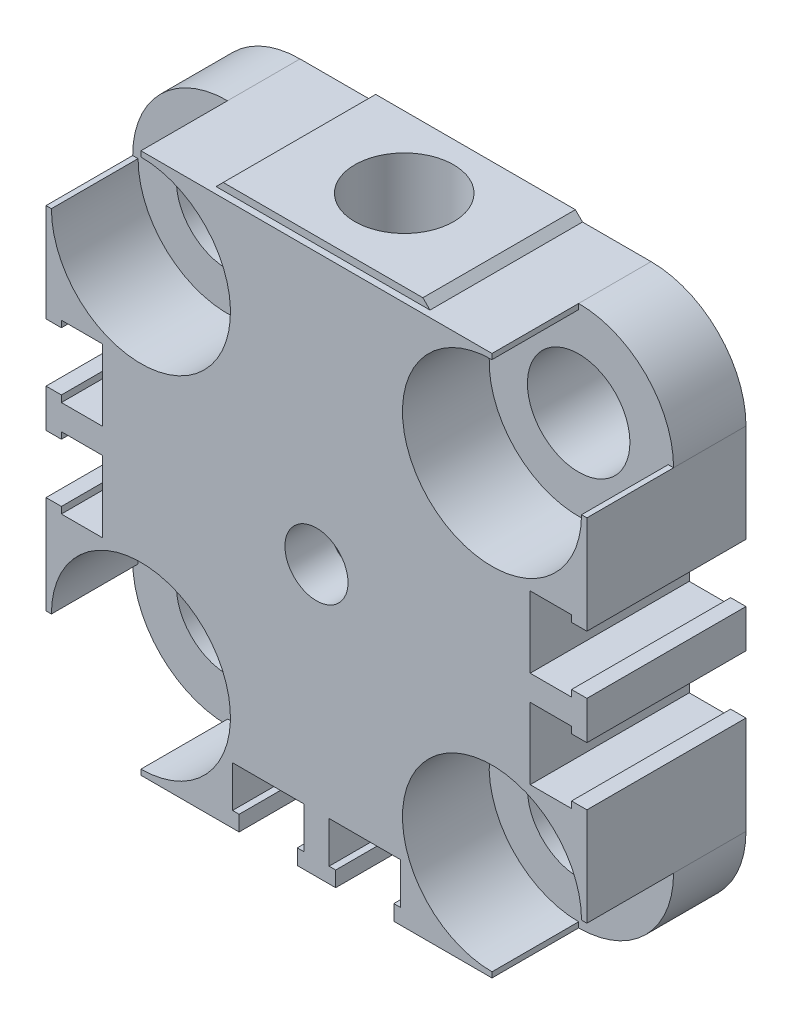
ISO-10303-21;
HEADER;
FILE_DESCRIPTION(('STEP AP214'),'2;1');
FILE_NAME('part.step','',(''),(''),'','','');
FILE_SCHEMA(('AUTOMOTIVE_DESIGN { 1 0 10303 214 1 1 1 1 }'));
ENDSEC;
DATA;
#1=APPLICATION_CONTEXT('core data for automotive mechanical design processes');
#2=APPLICATION_PROTOCOL_DEFINITION('international standard','automotive_design',2000,#1);
#3=PRODUCT_CONTEXT('',#1,'mechanical');
#4=PRODUCT('Part','Part','',(#3));
#5=PRODUCT_RELATED_PRODUCT_CATEGORY('part','',(#4));
#6=PRODUCT_DEFINITION_FORMATION('','',#4);
#7=PRODUCT_DEFINITION_CONTEXT('part definition',#1,'design');
#8=PRODUCT_DEFINITION('design','',#6,#7);
#9=PRODUCT_DEFINITION_SHAPE('','',#8);
#10=(LENGTH_UNIT() NAMED_UNIT(*) SI_UNIT(.MILLI.,.METRE.));
#11=(NAMED_UNIT(*) PLANE_ANGLE_UNIT() SI_UNIT($,.RADIAN.));
#12=(NAMED_UNIT(*) SI_UNIT($,.STERADIAN.) SOLID_ANGLE_UNIT());
#13=UNCERTAINTY_MEASURE_WITH_UNIT(LENGTH_MEASURE(1.E-05),#10,'distance_accuracy_value','');
#14=(GEOMETRIC_REPRESENTATION_CONTEXT(3) GLOBAL_UNCERTAINTY_ASSIGNED_CONTEXT((#13)) GLOBAL_UNIT_ASSIGNED_CONTEXT((#10,
#11,#12)) REPRESENTATION_CONTEXT('',''));
#15=CARTESIAN_POINT('',(0.,0.,0.));
#16=DIRECTION('',(0.,0.,1.));
#17=DIRECTION('',(1.,0.,0.));
#18=AXIS2_PLACEMENT_3D('',#15,#16,#17);
#19=CARTESIAN_POINT('',(0.,0.,-15.));
#20=DIRECTION('',(0.,0.,1.));
#21=DIRECTION('',(1.,0.,0.));
#22=AXIS2_PLACEMENT_3D('',#19,#20,#21);
#23=PLANE('',#22);
#24=CARTESIAN_POINT('',(0.,0.,-15.));
#25=DIRECTION('',(0.,0.,1.));
#26=DIRECTION('',(1.,0.,0.));
#27=AXIS2_PLACEMENT_3D('',#24,#25,#26);
#28=CIRCLE('',#27,10.4);
#29=CARTESIAN_POINT('',(10.4,0.,-15.));
#30=VERTEX_POINT('',#29);
#31=EDGE_CURVE('E543',#30,#30,#28,.T.);
#32=ORIENTED_EDGE('',*,*,#31,.T.);
#33=EDGE_LOOP('',(#32));
#34=FACE_BOUND('',#33,.T.);
#35=CARTESIAN_POINT('',(0.,0.,-15.));
#36=DIRECTION('',(0.,0.,1.));
#37=DIRECTION('',(1.,0.,0.));
#38=AXIS2_PLACEMENT_3D('',#35,#36,#37);
#39=CIRCLE('',#38,16.);
#40=CARTESIAN_POINT('',(16.,0.,-15.));
#41=VERTEX_POINT('',#40);
#42=EDGE_CURVE('E549',#41,#41,#39,.T.);
#43=ORIENTED_EDGE('',*,*,#42,.F.);
#44=EDGE_LOOP('',(#43));
#45=FACE_BOUND('',#44,.T.);
#46=CARTESIAN_POINT('',(0.,13.55,-15.));
#47=DIRECTION('',(0.,0.,-1.));
#48=DIRECTION('',(-1.,0.,0.));
#49=AXIS2_PLACEMENT_3D('',#46,#47,#48);
#50=CIRCLE('',#49,0.85);
#51=CARTESIAN_POINT('',(-0.85,13.55,-15.));
#52=VERTEX_POINT('',#51);
#53=EDGE_CURVE('E2192',#52,#52,#50,.T.);
#54=ORIENTED_EDGE('',*,*,#53,.F.);
#55=EDGE_LOOP('',(#54));
#56=FACE_BOUND('',#55,.T.);
#57=ADVANCED_FACE('F32',(#34,#45,#56),#23,.F.);
#58=CARTESIAN_POINT('',(0.,25.3,-8.));
#59=DIRECTION('',(0.,1.,0.));
#60=DIRECTION('',(0.,0.,1.));
#61=AXIS2_PLACEMENT_3D('',#58,#59,#60);
#62=CYLINDRICAL_SURFACE('',#61,4.5);
#63=CARTESIAN_POINT('',(0.,25.3,-8.));
#64=DIRECTION('',(0.,1.,0.));
#65=DIRECTION('',(0.,0.,1.));
#66=AXIS2_PLACEMENT_3D('',#63,#64,#65);
#67=CIRCLE('',#66,4.5);
#68=CARTESIAN_POINT('',(0.,25.3,-3.5));
#69=VERTEX_POINT('',#68);
#70=EDGE_CURVE('E516',#69,#69,#67,.T.);
#71=ORIENTED_EDGE('',*,*,#70,.T.);
#72=EDGE_LOOP('',(#71));
#73=FACE_BOUND('',#72,.T.);
#74=CARTESIAN_POINT('',(0.,12.3,-8.));
#75=DIRECTION('',(0.,1.,0.));
#76=DIRECTION('',(0.,0.,1.));
#77=AXIS2_PLACEMENT_3D('',#74,#75,#76);
#78=CIRCLE('',#77,4.5);
#79=CARTESIAN_POINT('',(0.,12.3,-3.5));
#80=VERTEX_POINT('',#79);
#81=EDGE_CURVE('E2193',#80,#80,#78,.T.);
#82=ORIENTED_EDGE('',*,*,#81,.F.);
#83=EDGE_LOOP('',(#82));
#84=FACE_BOUND('',#83,.T.);
#85=CARTESIAN_POINT('',(-0.85,13.55,-12.4189930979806));
#86=CARTESIAN_POINT('',(-0.849998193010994,13.5027143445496,-12.4189940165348));
#87=CARTESIAN_POINT('',(-0.846040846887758,13.4554053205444,-12.4197603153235));
#88=CARTESIAN_POINT('',(-0.830326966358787,13.3621217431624,-12.422738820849));
#89=CARTESIAN_POINT('',(-0.818563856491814,13.3161483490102,-12.4249522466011));
#90=CARTESIAN_POINT('',(-0.787612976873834,13.2268992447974,-12.4305655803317));
#91=CARTESIAN_POINT('',(-0.768432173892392,13.1836210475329,-12.4339643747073));
#92=CARTESIAN_POINT('',(-0.7232089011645,13.1008993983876,-12.4415641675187));
#93=CARTESIAN_POINT('',(-0.6971669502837,13.0614556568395,-12.4457651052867));
#94=CARTESIAN_POINT('',(-0.638610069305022,12.987021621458,-12.4545551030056));
#95=CARTESIAN_POINT('',(-0.606025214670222,12.9520867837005,-12.4591480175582));
#96=CARTESIAN_POINT('',(-0.535458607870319,12.8881455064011,-12.4681704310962));
#97=CARTESIAN_POINT('',(-0.497476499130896,12.8591394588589,-12.4725999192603));
#98=CARTESIAN_POINT('',(-0.416828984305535,12.8076663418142,-12.4808377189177));
#99=CARTESIAN_POINT('',(-0.374129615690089,12.7852516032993,-12.4846409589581));
#100=CARTESIAN_POINT('',(-0.285487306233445,12.7479345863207,-12.4911545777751));
#101=CARTESIAN_POINT('',(-0.239544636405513,12.7330316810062,-12.4938650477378));
#102=CARTESIAN_POINT('',(-0.146294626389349,12.7113329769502,-12.4978605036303));
#103=CARTESIAN_POINT('',(-0.0990097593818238,12.704443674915,-12.4991619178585));
#104=CARTESIAN_POINT('',(-0.00393862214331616,12.6986763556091,-12.5002492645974));
#105=CARTESIAN_POINT('',(0.0438476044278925,12.6997976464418,-12.5000353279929));
#106=CARTESIAN_POINT('',(0.137923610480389,12.7099480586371,-12.4981289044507));
#107=CARTESIAN_POINT('',(0.184224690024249,12.7188764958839,-12.4964552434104));
#108=CARTESIAN_POINT('',(0.274659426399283,12.7442284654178,-12.491838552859));
#109=CARTESIAN_POINT('',(0.318793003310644,12.7606522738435,-12.4888954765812));
#110=CARTESIAN_POINT('',(0.403931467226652,12.8006244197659,-12.4820392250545));
#111=CARTESIAN_POINT('',(0.444917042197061,12.8242129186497,-12.4781206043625));
#112=CARTESIAN_POINT('',(0.522385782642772,12.8778152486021,-12.4697464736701));
#113=CARTESIAN_POINT('',(0.558868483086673,12.9078297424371,-12.4652909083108));
#114=CARTESIAN_POINT('',(0.626892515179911,12.9739866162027,-12.456254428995));
#115=CARTESIAN_POINT('',(0.658348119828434,13.0102170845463,-12.4516726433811));
#116=CARTESIAN_POINT('',(0.714749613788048,13.0874842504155,-12.4429663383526));
#117=CARTESIAN_POINT('',(0.739695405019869,13.128521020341,-12.4388418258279));
#118=CARTESIAN_POINT('',(0.782394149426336,13.2143505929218,-12.4315157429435));
#119=CARTESIAN_POINT('',(0.800134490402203,13.2591498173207,-12.4283157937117));
#120=CARTESIAN_POINT('',(0.827812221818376,13.3511671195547,-12.4232258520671));
#121=CARTESIAN_POINT('',(0.837750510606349,13.3983849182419,-12.4213357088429));
#122=CARTESIAN_POINT('',(0.849416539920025,13.4931255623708,-12.4191092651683));
#123=CARTESIAN_POINT('',(0.851267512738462,13.5406327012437,-12.4187496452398));
#124=CARTESIAN_POINT('',(0.847036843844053,13.6352771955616,-12.4195625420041));
#125=CARTESIAN_POINT('',(0.840955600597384,13.6824145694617,-12.4207349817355));
#126=CARTESIAN_POINT('',(0.8211389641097,13.7745753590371,-12.4244581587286));
#127=CARTESIAN_POINT('',(0.807468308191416,13.8196132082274,-12.4269972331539));
#128=CARTESIAN_POINT('',(0.772929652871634,13.9067591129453,-12.4331575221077));
#129=CARTESIAN_POINT('',(0.752061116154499,13.9488669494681,-12.4367788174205));
#130=CARTESIAN_POINT('',(0.703435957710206,14.0295000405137,-12.444748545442));
#131=CARTESIAN_POINT('',(0.675601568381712,14.0679775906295,-12.4491049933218));
#132=CARTESIAN_POINT('',(0.613939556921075,14.1397605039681,-12.4580316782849));
#133=CARTESIAN_POINT('',(0.580111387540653,14.1730653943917,-12.4626019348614));
#134=CARTESIAN_POINT('',(0.506871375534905,14.2340187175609,-12.471516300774));
#135=CARTESIAN_POINT('',(0.467389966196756,14.261584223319,-12.4758564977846));
#136=CARTESIAN_POINT('',(0.384284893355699,14.3096907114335,-12.4837556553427));
#137=CARTESIAN_POINT('',(0.340661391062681,14.33023196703,-12.4873146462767));
#138=CARTESIAN_POINT('',(0.250738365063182,14.3635830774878,-12.4932335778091));
#139=CARTESIAN_POINT('',(0.20445430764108,14.3764334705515,-12.4955997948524));
#140=CARTESIAN_POINT('',(0.110335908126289,14.3941673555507,-12.4988933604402));
#141=CARTESIAN_POINT('',(0.0625017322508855,14.3990516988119,-12.4998208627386));
#142=CARTESIAN_POINT('',(-0.0325641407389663,14.4006848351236,-12.5001293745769));
#143=CARTESIAN_POINT('',(-0.0797936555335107,14.3975588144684,-12.4995341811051));
#144=CARTESIAN_POINT('',(-0.173041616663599,14.3835343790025,-12.4969136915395));
#145=CARTESIAN_POINT('',(-0.21906007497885,14.3726360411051,-12.4948884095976));
#146=CARTESIAN_POINT('',(-0.30851217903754,14.3434294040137,-12.4896353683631));
#147=CARTESIAN_POINT('',(-0.351950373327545,14.3251346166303,-12.4864098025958));
#148=CARTESIAN_POINT('',(-0.43515912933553,14.281669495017,-12.4791051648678));
#149=CARTESIAN_POINT('',(-0.474929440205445,14.2564986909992,-12.4750260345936));
#150=CARTESIAN_POINT('',(-0.550296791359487,14.1995660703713,-12.4663894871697));
#151=CARTESIAN_POINT('',(-0.585824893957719,14.1677139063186,-12.4618259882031));
#152=CARTESIAN_POINT('',(-0.651075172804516,14.0985100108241,-12.4527731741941));
#153=CARTESIAN_POINT('',(-0.680795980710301,14.0611569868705,-12.448283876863));
#154=CARTESIAN_POINT('',(-0.733851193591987,13.9815909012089,-12.4398415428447));
#155=CARTESIAN_POINT('',(-0.75712284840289,13.9393354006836,-12.4358939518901));
#156=CARTESIAN_POINT('',(-0.796199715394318,13.8514532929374,-12.4290476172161));
#157=CARTESIAN_POINT('',(-0.812011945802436,13.8058299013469,-12.4261478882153));
#158=CARTESIAN_POINT('',(-0.832523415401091,13.7250626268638,-12.4223274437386));
#159=CARTESIAN_POINT('',(-0.839065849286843,13.6903903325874,-12.4210845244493));
#160=CARTESIAN_POINT('',(-0.847804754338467,13.6204830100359,-12.4194170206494));
#161=CARTESIAN_POINT('',(-0.850001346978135,13.5852479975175,-12.4189924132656));
#162=CARTESIAN_POINT('',(-0.85,13.55,-12.4189930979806));
#163=B_SPLINE_CURVE_WITH_KNOTS('',3,(#85,#86,#87,#88,#89,#90,#91,#92,#93,#94,#95,#96,#97,#98,
#99,#100,#101,#102,#103,#104,#105,#106,#107,#108,#109,#110,#111,#112,#113,#114,#115,#116,#117,
#118,#119,#120,#121,#122,#123,#124,#125,#126,#127,#128,#129,#130,#131,#132,#133,#134,#135,#136,
#137,#138,#139,#140,#141,#142,#143,#144,#145,#146,#147,#148,#149,#150,#151,#152,#153,#154,#155,
#156,#157,#158,#159,#160,#161,#162),.UNSPECIFIED.,.T.,.F.,(4,2,2,2,2,2,2,2,2,2,2,2,2,2,2,2,2,2,
2,2,2,2,2,2,2,2,2,2,2,2,2,2,2,2,2,2,2,2,4),(0.,0.141727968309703,0.283575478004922,
0.425290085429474,0.566993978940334,0.71030165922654,0.853618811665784,0.998044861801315,
1.14245885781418,1.28517036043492,1.42786953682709,1.56875510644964,1.70964586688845,
1.85134143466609,1.9930516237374,2.13696697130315,2.28088448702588,2.42505283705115,
2.56920458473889,2.71115195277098,2.85309219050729,2.99383988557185,3.13459808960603,
3.27700390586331,3.41942273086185,3.56377495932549,3.70812157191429,3.85170048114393,
3.99526404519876,4.13659772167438,4.27792999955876,4.41900525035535,4.5600901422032,
4.70322244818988,4.84638843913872,4.99090208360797,5.13527948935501,5.24093027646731,
5.34657811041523),.UNSPECIFIED.);
#164=CARTESIAN_POINT('',(-0.85,13.55,-12.4189930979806));
#165=VERTEX_POINT('',#164);
#166=EDGE_CURVE('E2187',#165,#165,#163,.T.);
#167=ORIENTED_EDGE('',*,*,#166,.F.);
#168=EDGE_LOOP('',(#167));
#169=FACE_BOUND('',#168,.T.);
#170=ADVANCED_FACE('F1119',(#73,#84,#169),#62,.F.);
#171=CARTESIAN_POINT('',(16.,16.,-14.5));
#172=DIRECTION('',(0.,0.,-1.));
#173=DIRECTION('',(-1.,0.,0.));
#174=AXIS2_PLACEMENT_3D('',#171,#172,#173);
#175=PLANE('',#174);
#176=CARTESIAN_POINT('',(-16.,16.,-14.5));
#177=DIRECTION('',(0.,0.,-1.));
#178=DIRECTION('',(-1.,0.,0.));
#179=AXIS2_PLACEMENT_3D('',#176,#177,#178);
#180=CIRCLE('',#179,4.67);
#181=CARTESIAN_POINT('',(-20.67,16.,-14.5));
#182=VERTEX_POINT('',#181);
#183=EDGE_CURVE('E999',#182,#182,#180,.T.);
#184=ORIENTED_EDGE('',*,*,#183,.F.);
#185=EDGE_LOOP('',(#184));
#186=FACE_BOUND('',#185,.T.);
#187=CARTESIAN_POINT('',(-16.,-16.,-14.5));
#188=DIRECTION('',(0.,0.,-1.));
#189=DIRECTION('',(-1.,0.,0.));
#190=AXIS2_PLACEMENT_3D('',#187,#188,#189);
#191=CIRCLE('',#190,4.67);
#192=CARTESIAN_POINT('',(-20.67,-16.,-14.5));
#193=VERTEX_POINT('',#192);
#194=EDGE_CURVE('E903',#193,#193,#191,.T.);
#195=ORIENTED_EDGE('',*,*,#194,.F.);
#196=EDGE_LOOP('',(#195));
#197=FACE_BOUND('',#196,.T.);
#198=CARTESIAN_POINT('',(16.0000000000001,-15.9999999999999,-14.5));
#199=DIRECTION('',(0.,0.,-1.));
#200=DIRECTION('',(-1.,0.,0.));
#201=AXIS2_PLACEMENT_3D('',#198,#199,#200);
#202=CIRCLE('',#201,4.67);
#203=CARTESIAN_POINT('',(11.3300000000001,-15.9999999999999,-14.5));
#204=VERTEX_POINT('',#203);
#205=EDGE_CURVE('E897',#204,#204,#202,.T.);
#206=ORIENTED_EDGE('',*,*,#205,.F.);
#207=EDGE_LOOP('',(#206));
#208=FACE_BOUND('',#207,.T.);
#209=CARTESIAN_POINT('',(15.9999999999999,16.0000000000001,-14.5));
#210=DIRECTION('',(0.,0.,-1.));
#211=DIRECTION('',(-1.,0.,0.));
#212=AXIS2_PLACEMENT_3D('',#209,#210,#211);
#213=CIRCLE('',#212,4.67);
#214=CARTESIAN_POINT('',(11.3299999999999,16.0000000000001,-14.5));
#215=VERTEX_POINT('',#214);
#216=EDGE_CURVE('E891',#215,#215,#213,.T.);
#217=ORIENTED_EDGE('',*,*,#216,.F.);
#218=EDGE_LOOP('',(#217));
#219=FACE_BOUND('',#218,.T.);
#220=DIRECTION('',(0.,-1.,0.));
#221=VECTOR('',#220,1.);
#222=CARTESIAN_POINT('',(23.25,1.15000000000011,-14.5));
#223=LINE('',#222,#221);
#224=CARTESIAN_POINT('',(23.25,1.75000000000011,-14.5));
#225=VERTEX_POINT('',#224);
#226=CARTESIAN_POINT('',(23.25,1.15000000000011,-14.5));
#227=VERTEX_POINT('',#226);
#228=EDGE_CURVE('E583',#225,#227,#223,.T.);
#229=ORIENTED_EDGE('',*,*,#228,.F.);
#230=DIRECTION('',(-1.,0.,0.));
#231=VECTOR('',#230,1.);
#232=CARTESIAN_POINT('',(23.25,1.75000000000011,-14.5));
#233=LINE('',#232,#231);
#234=CARTESIAN_POINT('',(24.65,1.75000000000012,-14.5));
#235=VERTEX_POINT('',#234);
#236=EDGE_CURVE('E585',#235,#225,#233,.T.);
#237=ORIENTED_EDGE('',*,*,#236,.F.);
#238=DIRECTION('',(0.,1.,0.));
#239=VECTOR('',#238,1.);
#240=CARTESIAN_POINT('',(24.65,16.,-14.5));
#241=LINE('',#240,#239);
#242=CARTESIAN_POINT('',(24.65,-1.74999999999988,-14.5));
#243=VERTEX_POINT('',#242);
#244=EDGE_CURVE('E1072',#243,#235,#241,.T.);
#245=ORIENTED_EDGE('',*,*,#244,.F.);
#246=DIRECTION('',(-1.,0.,0.));
#247=VECTOR('',#246,1.);
#248=CARTESIAN_POINT('',(23.25,-1.74999999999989,-14.5));
#249=LINE('',#248,#247);
#250=CARTESIAN_POINT('',(23.25,-1.74999999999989,-14.5));
#251=VERTEX_POINT('',#250);
#252=EDGE_CURVE('E676',#243,#251,#249,.T.);
#253=ORIENTED_EDGE('',*,*,#252,.T.);
#254=DIRECTION('',(0.,1.,0.));
#255=VECTOR('',#254,1.);
#256=CARTESIAN_POINT('',(23.25,-1.14999999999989,-14.5));
#257=LINE('',#256,#255);
#258=CARTESIAN_POINT('',(23.25,-1.14999999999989,-14.5));
#259=VERTEX_POINT('',#258);
#260=EDGE_CURVE('E679',#251,#259,#257,.T.);
#261=ORIENTED_EDGE('',*,*,#260,.T.);
#262=DIRECTION('',(-1.,0.,0.));
#263=VECTOR('',#262,1.);
#264=CARTESIAN_POINT('',(19.48,-1.14999999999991,-14.5));
#265=LINE('',#264,#263);
#266=CARTESIAN_POINT('',(19.48,-1.14999999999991,-14.5));
#267=VERTEX_POINT('',#266);
#268=EDGE_CURVE('E682',#259,#267,#265,.T.);
#269=ORIENTED_EDGE('',*,*,#268,.T.);
#270=DIRECTION('',(0.,-1.,0.));
#271=VECTOR('',#270,1.);
#272=CARTESIAN_POINT('',(19.48,-7.64999999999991,-14.5));
#273=LINE('',#272,#271);
#274=CARTESIAN_POINT('',(19.48,-7.64999999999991,-14.5));
#275=VERTEX_POINT('',#274);
#276=EDGE_CURVE('E685',#267,#275,#273,.T.);
#277=ORIENTED_EDGE('',*,*,#276,.T.);
#278=DIRECTION('',(1.,0.,0.));
#279=VECTOR('',#278,1.);
#280=CARTESIAN_POINT('',(23.25,-7.64999999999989,-14.5));
#281=LINE('',#280,#279);
#282=CARTESIAN_POINT('',(23.25,-7.64999999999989,-14.5));
#283=VERTEX_POINT('',#282);
#284=EDGE_CURVE('E688',#275,#283,#281,.T.);
#285=ORIENTED_EDGE('',*,*,#284,.T.);
#286=DIRECTION('',(0.,1.,0.));
#287=VECTOR('',#286,1.);
#288=CARTESIAN_POINT('',(23.25,-7.04999999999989,-14.5));
#289=LINE('',#288,#287);
#290=CARTESIAN_POINT('',(23.25,-7.04999999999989,-14.5));
#291=VERTEX_POINT('',#290);
#292=EDGE_CURVE('E691',#283,#291,#289,.T.);
#293=ORIENTED_EDGE('',*,*,#292,.T.);
#294=DIRECTION('',(1.,0.,0.));
#295=VECTOR('',#294,1.);
#296=CARTESIAN_POINT('',(24.65,-7.04999999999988,-14.5));
#297=LINE('',#296,#295);
#298=CARTESIAN_POINT('',(24.65,-7.04999999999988,-14.5));
#299=VERTEX_POINT('',#298);
#300=EDGE_CURVE('E694',#291,#299,#297,.T.);
#301=ORIENTED_EDGE('',*,*,#300,.T.);
#302=CARTESIAN_POINT('',(24.65,-16.,-14.5));
#303=VERTEX_POINT('',#302);
#304=EDGE_CURVE('E1069',#303,#299,#241,.T.);
#305=ORIENTED_EDGE('',*,*,#304,.F.);
#306=CARTESIAN_POINT('',(16.,-16.,-14.5));
#307=DIRECTION('',(0.,0.,1.));
#308=DIRECTION('',(1.,0.,0.));
#309=AXIS2_PLACEMENT_3D('',#306,#307,#308);
#310=CIRCLE('',#309,8.65);
#311=CARTESIAN_POINT('',(16.,-24.65,-14.5));
#312=VERTEX_POINT('',#311);
#313=EDGE_CURVE('E1064',#312,#303,#310,.T.);
#314=ORIENTED_EDGE('',*,*,#313,.F.);
#315=DIRECTION('',(1.,0.,0.));
#316=VECTOR('',#315,1.);
#317=CARTESIAN_POINT('',(-16.,-24.65,-14.5));
#318=LINE('',#317,#316);
#319=CARTESIAN_POINT('',(7.05000000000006,-24.65,-14.5));
#320=VERTEX_POINT('',#319);
#321=EDGE_CURVE('E1060',#320,#312,#318,.T.);
#322=ORIENTED_EDGE('',*,*,#321,.F.);
#323=DIRECTION('',(0.,-1.,0.));
#324=VECTOR('',#323,1.);
#325=CARTESIAN_POINT('',(7.05000000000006,-24.65,-14.5));
#326=LINE('',#325,#324);
#327=CARTESIAN_POINT('',(7.05000000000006,-23.25,-14.5));
#328=VERTEX_POINT('',#327);
#329=EDGE_CURVE('E625',#328,#320,#326,.T.);
#330=ORIENTED_EDGE('',*,*,#329,.F.);
#331=DIRECTION('',(-1.,0.,0.));
#332=VECTOR('',#331,1.);
#333=CARTESIAN_POINT('',(7.05000000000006,-23.25,-14.5));
#334=LINE('',#333,#332);
#335=CARTESIAN_POINT('',(7.65000000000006,-23.25,-14.5));
#336=VERTEX_POINT('',#335);
#337=EDGE_CURVE('E627',#336,#328,#334,.T.);
#338=ORIENTED_EDGE('',*,*,#337,.F.);
#339=DIRECTION('',(0.,-1.,0.));
#340=VECTOR('',#339,1.);
#341=CARTESIAN_POINT('',(7.65000000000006,-23.25,-14.5));
#342=LINE('',#341,#340);
#343=CARTESIAN_POINT('',(7.65000000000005,-19.48,-14.5));
#344=VERTEX_POINT('',#343);
#345=EDGE_CURVE('E629',#344,#336,#342,.T.);
#346=ORIENTED_EDGE('',*,*,#345,.F.);
#347=DIRECTION('',(1.,0.,0.));
#348=VECTOR('',#347,1.);
#349=CARTESIAN_POINT('',(7.65000000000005,-19.48,-14.5));
#350=LINE('',#349,#348);
#351=CARTESIAN_POINT('',(1.15000000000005,-19.48,-14.5));
#352=VERTEX_POINT('',#351);
#353=EDGE_CURVE('E631',#352,#344,#350,.T.);
#354=ORIENTED_EDGE('',*,*,#353,.F.);
#355=DIRECTION('',(0.,1.,0.));
#356=VECTOR('',#355,1.);
#357=CARTESIAN_POINT('',(1.15000000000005,-19.48,-14.5));
#358=LINE('',#357,#356);
#359=CARTESIAN_POINT('',(1.15000000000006,-23.25,-14.5));
#360=VERTEX_POINT('',#359);
#361=EDGE_CURVE('E633',#360,#352,#358,.T.);
#362=ORIENTED_EDGE('',*,*,#361,.F.);
#363=DIRECTION('',(-1.,0.,0.));
#364=VECTOR('',#363,1.);
#365=CARTESIAN_POINT('',(1.15000000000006,-23.25,-14.5));
#366=LINE('',#365,#364);
#367=CARTESIAN_POINT('',(1.75000000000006,-23.25,-14.5));
#368=VERTEX_POINT('',#367);
#369=EDGE_CURVE('E635',#368,#360,#366,.T.);
#370=ORIENTED_EDGE('',*,*,#369,.F.);
#371=DIRECTION('',(0.,1.,0.));
#372=VECTOR('',#371,1.);
#373=CARTESIAN_POINT('',(1.75000000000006,-23.25,-14.5));
#374=LINE('',#373,#372);
#375=CARTESIAN_POINT('',(1.75000000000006,-24.65,-14.5));
#376=VERTEX_POINT('',#375);
#377=EDGE_CURVE('E637',#376,#368,#374,.T.);
#378=ORIENTED_EDGE('',*,*,#377,.F.);
#379=CARTESIAN_POINT('',(-1.74999999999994,-24.65,-14.5));
#380=VERTEX_POINT('',#379);
#381=EDGE_CURVE('E1065',#380,#376,#318,.T.);
#382=ORIENTED_EDGE('',*,*,#381,.F.);
#383=DIRECTION('',(0.,1.,0.));
#384=VECTOR('',#383,1.);
#385=CARTESIAN_POINT('',(-1.74999999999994,-23.25,-14.5));
#386=LINE('',#385,#384);
#387=CARTESIAN_POINT('',(-1.74999999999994,-23.25,-14.5));
#388=VERTEX_POINT('',#387);
#389=EDGE_CURVE('E734',#380,#388,#386,.T.);
#390=ORIENTED_EDGE('',*,*,#389,.T.);
#391=DIRECTION('',(1.,0.,0.));
#392=VECTOR('',#391,1.);
#393=CARTESIAN_POINT('',(-1.14999999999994,-23.25,-14.5));
#394=LINE('',#393,#392);
#395=CARTESIAN_POINT('',(-1.14999999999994,-23.25,-14.5));
#396=VERTEX_POINT('',#395);
#397=EDGE_CURVE('E737',#388,#396,#394,.T.);
#398=ORIENTED_EDGE('',*,*,#397,.T.);
#399=DIRECTION('',(0.,1.,0.));
#400=VECTOR('',#399,1.);
#401=CARTESIAN_POINT('',(-1.14999999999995,-19.48,-14.5));
#402=LINE('',#401,#400);
#403=CARTESIAN_POINT('',(-1.14999999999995,-19.48,-14.5));
#404=VERTEX_POINT('',#403);
#405=EDGE_CURVE('E740',#396,#404,#402,.T.);
#406=ORIENTED_EDGE('',*,*,#405,.T.);
#407=DIRECTION('',(-1.,0.,0.));
#408=VECTOR('',#407,1.);
#409=CARTESIAN_POINT('',(-7.64999999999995,-19.48,-14.5));
#410=LINE('',#409,#408);
#411=CARTESIAN_POINT('',(-7.64999999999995,-19.48,-14.5));
#412=VERTEX_POINT('',#411);
#413=EDGE_CURVE('E743',#404,#412,#410,.T.);
#414=ORIENTED_EDGE('',*,*,#413,.T.);
#415=DIRECTION('',(0.,-1.,0.));
#416=VECTOR('',#415,1.);
#417=CARTESIAN_POINT('',(-7.64999999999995,-23.25,-14.5));
#418=LINE('',#417,#416);
#419=CARTESIAN_POINT('',(-7.64999999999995,-23.25,-14.5));
#420=VERTEX_POINT('',#419);
#421=EDGE_CURVE('E746',#412,#420,#418,.T.);
#422=ORIENTED_EDGE('',*,*,#421,.T.);
#423=DIRECTION('',(1.,0.,0.));
#424=VECTOR('',#423,1.);
#425=CARTESIAN_POINT('',(-7.04999999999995,-23.25,-14.5));
#426=LINE('',#425,#424);
#427=CARTESIAN_POINT('',(-7.04999999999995,-23.25,-14.5));
#428=VERTEX_POINT('',#427);
#429=EDGE_CURVE('E749',#420,#428,#426,.T.);
#430=ORIENTED_EDGE('',*,*,#429,.T.);
#431=DIRECTION('',(0.,-1.,0.));
#432=VECTOR('',#431,1.);
#433=CARTESIAN_POINT('',(-7.04999999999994,-24.65,-14.5));
#434=LINE('',#433,#432);
#435=CARTESIAN_POINT('',(-7.04999999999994,-24.65,-14.5));
#436=VERTEX_POINT('',#435);
#437=EDGE_CURVE('E752',#428,#436,#434,.T.);
#438=ORIENTED_EDGE('',*,*,#437,.T.);
#439=CARTESIAN_POINT('',(-16.,-24.65,-14.5));
#440=VERTEX_POINT('',#439);
#441=EDGE_CURVE('E1061',#440,#436,#318,.T.);
#442=ORIENTED_EDGE('',*,*,#441,.F.);
#443=CARTESIAN_POINT('',(-16.,-16.,-14.5));
#444=DIRECTION('',(0.,0.,1.));
#445=DIRECTION('',(1.,0.,0.));
#446=AXIS2_PLACEMENT_3D('',#443,#444,#445);
#447=CIRCLE('',#446,8.65);
#448=CARTESIAN_POINT('',(-24.65,-16.,-14.5));
#449=VERTEX_POINT('',#448);
#450=EDGE_CURVE('E1056',#449,#440,#447,.T.);
#451=ORIENTED_EDGE('',*,*,#450,.F.);
#452=DIRECTION('',(0.,-1.,0.));
#453=VECTOR('',#452,1.);
#454=CARTESIAN_POINT('',(-24.65,16.,-14.5));
#455=LINE('',#454,#453);
#456=CARTESIAN_POINT('',(-24.65,-7.05,-14.5));
#457=VERTEX_POINT('',#456);
#458=EDGE_CURVE('E1052',#457,#449,#455,.T.);
#459=ORIENTED_EDGE('',*,*,#458,.F.);
#460=DIRECTION('',(-1.,0.,0.));
#461=VECTOR('',#460,1.);
#462=CARTESIAN_POINT('',(-24.65,-7.05,-14.5));
#463=LINE('',#462,#461);
#464=CARTESIAN_POINT('',(-23.25,-7.05,-14.5));
#465=VERTEX_POINT('',#464);
#466=EDGE_CURVE('E793',#465,#457,#463,.T.);
#467=ORIENTED_EDGE('',*,*,#466,.F.);
#468=DIRECTION('',(0.,1.,0.));
#469=VECTOR('',#468,1.);
#470=CARTESIAN_POINT('',(-23.25,-7.05,-14.5));
#471=LINE('',#470,#469);
#472=CARTESIAN_POINT('',(-23.25,-7.65,-14.5));
#473=VERTEX_POINT('',#472);
#474=EDGE_CURVE('E795',#473,#465,#471,.T.);
#475=ORIENTED_EDGE('',*,*,#474,.F.);
#476=DIRECTION('',(-1.,0.,0.));
#477=VECTOR('',#476,1.);
#478=CARTESIAN_POINT('',(-23.25,-7.65,-14.5));
#479=LINE('',#478,#477);
#480=CARTESIAN_POINT('',(-19.48,-7.65,-14.5));
#481=VERTEX_POINT('',#480);
#482=EDGE_CURVE('E797',#481,#473,#479,.T.);
#483=ORIENTED_EDGE('',*,*,#482,.F.);
#484=DIRECTION('',(0.,-1.,0.));
#485=VECTOR('',#484,1.);
#486=CARTESIAN_POINT('',(-19.48,-7.65,-14.5));
#487=LINE('',#486,#485);
#488=CARTESIAN_POINT('',(-19.48,-1.15,-14.5));
#489=VERTEX_POINT('',#488);
#490=EDGE_CURVE('E799',#489,#481,#487,.T.);
#491=ORIENTED_EDGE('',*,*,#490,.F.);
#492=DIRECTION('',(1.,0.,0.));
#493=VECTOR('',#492,1.);
#494=CARTESIAN_POINT('',(-19.48,-1.15,-14.5));
#495=LINE('',#494,#493);
#496=CARTESIAN_POINT('',(-23.25,-1.15,-14.5));
#497=VERTEX_POINT('',#496);
#498=EDGE_CURVE('E801',#497,#489,#495,.T.);
#499=ORIENTED_EDGE('',*,*,#498,.F.);
#500=DIRECTION('',(0.,1.,0.));
#501=VECTOR('',#500,1.);
#502=CARTESIAN_POINT('',(-23.25,-1.15,-14.5));
#503=LINE('',#502,#501);
#504=CARTESIAN_POINT('',(-23.25,-1.75,-14.5));
#505=VERTEX_POINT('',#504);
#506=EDGE_CURVE('E803',#505,#497,#503,.T.);
#507=ORIENTED_EDGE('',*,*,#506,.F.);
#508=DIRECTION('',(1.,0.,0.));
#509=VECTOR('',#508,1.);
#510=CARTESIAN_POINT('',(-23.25,-1.75,-14.5));
#511=LINE('',#510,#509);
#512=CARTESIAN_POINT('',(-24.65,-1.75,-14.5));
#513=VERTEX_POINT('',#512);
#514=EDGE_CURVE('E805',#513,#505,#511,.T.);
#515=ORIENTED_EDGE('',*,*,#514,.F.);
#516=CARTESIAN_POINT('',(-24.65,1.75,-14.5));
#517=VERTEX_POINT('',#516);
#518=EDGE_CURVE('E1057',#517,#513,#455,.T.);
#519=ORIENTED_EDGE('',*,*,#518,.F.);
#520=DIRECTION('',(1.,0.,0.));
#521=VECTOR('',#520,1.);
#522=CARTESIAN_POINT('',(-23.25,1.75,-14.5));
#523=LINE('',#522,#521);
#524=CARTESIAN_POINT('',(-23.25,1.75,-14.5));
#525=VERTEX_POINT('',#524);
#526=EDGE_CURVE('E844',#517,#525,#523,.T.);
#527=ORIENTED_EDGE('',*,*,#526,.T.);
#528=DIRECTION('',(0.,-1.,0.));
#529=VECTOR('',#528,1.);
#530=CARTESIAN_POINT('',(-23.25,1.15,-14.5));
#531=LINE('',#530,#529);
#532=CARTESIAN_POINT('',(-23.25,1.15,-14.5));
#533=VERTEX_POINT('',#532);
#534=EDGE_CURVE('E847',#525,#533,#531,.T.);
#535=ORIENTED_EDGE('',*,*,#534,.T.);
#536=DIRECTION('',(1.,0.,0.));
#537=VECTOR('',#536,1.);
#538=CARTESIAN_POINT('',(-19.48,1.15,-14.5));
#539=LINE('',#538,#537);
#540=CARTESIAN_POINT('',(-19.48,1.15,-14.5));
#541=VERTEX_POINT('',#540);
#542=EDGE_CURVE('E850',#533,#541,#539,.T.);
#543=ORIENTED_EDGE('',*,*,#542,.T.);
#544=DIRECTION('',(0.,1.,0.));
#545=VECTOR('',#544,1.);
#546=CARTESIAN_POINT('',(-19.48,7.65,-14.5));
#547=LINE('',#546,#545);
#548=CARTESIAN_POINT('',(-19.48,7.65,-14.5));
#549=VERTEX_POINT('',#548);
#550=EDGE_CURVE('E853',#541,#549,#547,.T.);
#551=ORIENTED_EDGE('',*,*,#550,.T.);
#552=DIRECTION('',(-1.,0.,0.));
#553=VECTOR('',#552,1.);
#554=CARTESIAN_POINT('',(-23.25,7.65,-14.5));
#555=LINE('',#554,#553);
#556=CARTESIAN_POINT('',(-23.25,7.65,-14.5));
#557=VERTEX_POINT('',#556);
#558=EDGE_CURVE('E856',#549,#557,#555,.T.);
#559=ORIENTED_EDGE('',*,*,#558,.T.);
#560=DIRECTION('',(0.,-1.,0.));
#561=VECTOR('',#560,1.);
#562=CARTESIAN_POINT('',(-23.25,7.05,-14.5));
#563=LINE('',#562,#561);
#564=CARTESIAN_POINT('',(-23.25,7.05,-14.5));
#565=VERTEX_POINT('',#564);
#566=EDGE_CURVE('E859',#557,#565,#563,.T.);
#567=ORIENTED_EDGE('',*,*,#566,.T.);
#568=DIRECTION('',(-1.,0.,0.));
#569=VECTOR('',#568,1.);
#570=CARTESIAN_POINT('',(-24.65,7.05,-14.5));
#571=LINE('',#570,#569);
#572=CARTESIAN_POINT('',(-24.65,7.05,-14.5));
#573=VERTEX_POINT('',#572);
#574=EDGE_CURVE('E862',#565,#573,#571,.T.);
#575=ORIENTED_EDGE('',*,*,#574,.T.);
#576=CARTESIAN_POINT('',(-24.65,16.,-14.5));
#577=VERTEX_POINT('',#576);
#578=EDGE_CURVE('E1053',#577,#573,#455,.T.);
#579=ORIENTED_EDGE('',*,*,#578,.F.);
#580=CARTESIAN_POINT('',(-16.,16.,-14.5));
#581=DIRECTION('',(0.,0.,1.));
#582=DIRECTION('',(1.,0.,0.));
#583=AXIS2_PLACEMENT_3D('',#580,#581,#582);
#584=CIRCLE('',#583,8.65);
#585=CARTESIAN_POINT('',(-16.,24.65,-14.5));
#586=VERTEX_POINT('',#585);
#587=EDGE_CURVE('E495',#586,#577,#584,.T.);
#588=ORIENTED_EDGE('',*,*,#587,.F.);
#589=DIRECTION('',(-1.,0.,0.));
#590=VECTOR('',#589,1.);
#591=CARTESIAN_POINT('',(-16.,24.65,-14.5));
#592=LINE('',#591,#590);
#593=CARTESIAN_POINT('',(-9.75,24.65,-14.5));
#594=VERTEX_POINT('',#593);
#595=EDGE_CURVE('E486',#594,#586,#592,.T.);
#596=ORIENTED_EDGE('',*,*,#595,.F.);
#597=DIRECTION('',(0.707106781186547,0.707106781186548,0.));
#598=VECTOR('',#597,1.);
#599=CARTESIAN_POINT('',(-9.1,25.3,-14.5));
#600=LINE('',#599,#598);
#601=CARTESIAN_POINT('',(-9.1,25.3,-14.5));
#602=VERTEX_POINT('',#601);
#603=EDGE_CURVE('E492',#594,#602,#600,.T.);
#604=ORIENTED_EDGE('',*,*,#603,.T.);
#605=DIRECTION('',(1.,0.,0.));
#606=VECTOR('',#605,1.);
#607=CARTESIAN_POINT('',(9.1,25.3,-14.5));
#608=LINE('',#607,#606);
#609=CARTESIAN_POINT('',(9.1,25.3,-14.5));
#610=VERTEX_POINT('',#609);
#611=EDGE_CURVE('E511',#602,#610,#608,.T.);
#612=ORIENTED_EDGE('',*,*,#611,.T.);
#613=DIRECTION('',(0.707106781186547,-0.707106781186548,0.));
#614=VECTOR('',#613,1.);
#615=CARTESIAN_POINT('',(9.75,24.65,-14.5));
#616=LINE('',#615,#614);
#617=CARTESIAN_POINT('',(9.75,24.65,-14.5));
#618=VERTEX_POINT('',#617);
#619=EDGE_CURVE('E513',#610,#618,#616,.T.);
#620=ORIENTED_EDGE('',*,*,#619,.T.);
#621=CARTESIAN_POINT('',(16.,24.65,-14.5));
#622=VERTEX_POINT('',#621);
#623=EDGE_CURVE('E498',#622,#618,#592,.T.);
#624=ORIENTED_EDGE('',*,*,#623,.F.);
#625=CARTESIAN_POINT('',(16.,16.,-14.5));
#626=DIRECTION('',(0.,0.,1.));
#627=DIRECTION('',(-1.,0.,0.));
#628=AXIS2_PLACEMENT_3D('',#625,#626,#627);
#629=CIRCLE('',#628,8.65);
#630=CARTESIAN_POINT('',(24.65,16.,-14.5));
#631=VERTEX_POINT('',#630);
#632=EDGE_CURVE('E499',#631,#622,#629,.T.);
#633=ORIENTED_EDGE('',*,*,#632,.F.);
#634=CARTESIAN_POINT('',(24.65,7.05000000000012,-14.5));
#635=VERTEX_POINT('',#634);
#636=EDGE_CURVE('E1068',#635,#631,#241,.T.);
#637=ORIENTED_EDGE('',*,*,#636,.F.);
#638=DIRECTION('',(1.,0.,0.));
#639=VECTOR('',#638,1.);
#640=CARTESIAN_POINT('',(24.65,7.05000000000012,-14.5));
#641=LINE('',#640,#639);
#642=CARTESIAN_POINT('',(23.25,7.05000000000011,-14.5));
#643=VERTEX_POINT('',#642);
#644=EDGE_CURVE('E573',#643,#635,#641,.T.);
#645=ORIENTED_EDGE('',*,*,#644,.F.);
#646=DIRECTION('',(0.,-1.,0.));
#647=VECTOR('',#646,1.);
#648=CARTESIAN_POINT('',(23.25,7.05000000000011,-14.5));
#649=LINE('',#648,#647);
#650=CARTESIAN_POINT('',(23.25,7.65000000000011,-14.5));
#651=VERTEX_POINT('',#650);
#652=EDGE_CURVE('E575',#651,#643,#649,.T.);
#653=ORIENTED_EDGE('',*,*,#652,.F.);
#654=DIRECTION('',(1.,0.,0.));
#655=VECTOR('',#654,1.);
#656=CARTESIAN_POINT('',(23.25,7.65000000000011,-14.5));
#657=LINE('',#656,#655);
#658=CARTESIAN_POINT('',(19.48,7.65000000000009,-14.5));
#659=VERTEX_POINT('',#658);
#660=EDGE_CURVE('E577',#659,#651,#657,.T.);
#661=ORIENTED_EDGE('',*,*,#660,.F.);
#662=DIRECTION('',(0.,1.,0.));
#663=VECTOR('',#662,1.);
#664=CARTESIAN_POINT('',(19.48,7.65000000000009,-14.5));
#665=LINE('',#664,#663);
#666=CARTESIAN_POINT('',(19.48,1.15000000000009,-14.5));
#667=VERTEX_POINT('',#666);
#668=EDGE_CURVE('E579',#667,#659,#665,.T.);
#669=ORIENTED_EDGE('',*,*,#668,.F.);
#670=DIRECTION('',(-1.,0.,0.));
#671=VECTOR('',#670,1.);
#672=CARTESIAN_POINT('',(19.48,1.15000000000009,-14.5));
#673=LINE('',#672,#671);
#674=EDGE_CURVE('E581',#227,#667,#673,.T.);
#675=ORIENTED_EDGE('',*,*,#674,.F.);
#676=EDGE_LOOP('',(#229,#237,#245,#253,#261,#269,#277,#285,#293,#301,#305,#314,#322,#330,#338,
#346,#354,#362,#370,#378,#382,#390,#398,#406,#414,#422,#430,#438,#442,#451,#459,#467,#475,#483,
#491,#499,#507,#515,#519,#527,#535,#543,#551,#559,#567,#575,#579,#588,#596,#604,#612,#620,#624,
#633,#637,#645,#653,#661,#669,#675));
#677=FACE_BOUND('',#676,.T.);
#678=CARTESIAN_POINT('',(0.,0.,-14.5));
#679=DIRECTION('',(0.,0.,1.));
#680=DIRECTION('',(1.,0.,0.));
#681=AXIS2_PLACEMENT_3D('',#678,#679,#680);
#682=CIRCLE('',#681,17.25);
#683=CARTESIAN_POINT('',(17.25,0.,-14.5));
#684=VERTEX_POINT('',#683);
#685=EDGE_CURVE('E537',#684,#684,#682,.T.);
#686=ORIENTED_EDGE('',*,*,#685,.T.);
#687=EDGE_LOOP('',(#686));
#688=FACE_BOUND('',#687,.T.);
#689=ADVANCED_FACE('F488',(#186,#197,#208,#219,#677,#688),#175,.T.);
#690=CARTESIAN_POINT('',(16.,16.,0.));
#691=DIRECTION('',(0.,0.,-1.));
#692=DIRECTION('',(-1.,0.,0.));
#693=AXIS2_PLACEMENT_3D('',#690,#691,#692);
#694=PLANE('',#693);
#695=CARTESIAN_POINT('',(0.,0.,0.));
#696=DIRECTION('',(0.,0.,1.));
#697=DIRECTION('',(1.,0.,0.));
#698=AXIS2_PLACEMENT_3D('',#695,#696,#697);
#699=CIRCLE('',#698,2.875);
#700=CARTESIAN_POINT('',(2.875,0.,0.));
#701=VERTEX_POINT('',#700);
#702=EDGE_CURVE('E869',#701,#701,#699,.T.);
#703=ORIENTED_EDGE('',*,*,#702,.F.);
#704=EDGE_LOOP('',(#703));
#705=FACE_BOUND('',#704,.T.);
#706=DIRECTION('',(-1.,0.,0.));
#707=VECTOR('',#706,1.);
#708=CARTESIAN_POINT('',(23.25,1.75000000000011,0.));
#709=LINE('',#708,#707);
#710=CARTESIAN_POINT('',(24.65,1.75000000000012,0.));
#711=VERTEX_POINT('',#710);
#712=CARTESIAN_POINT('',(23.25,1.75000000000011,0.));
#713=VERTEX_POINT('',#712);
#714=EDGE_CURVE('E570',#711,#713,#709,.T.);
#715=ORIENTED_EDGE('',*,*,#714,.T.);
#716=DIRECTION('',(0.,-1.,0.));
#717=VECTOR('',#716,1.);
#718=CARTESIAN_POINT('',(23.25,1.15000000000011,0.));
#719=LINE('',#718,#717);
#720=CARTESIAN_POINT('',(23.25,1.15000000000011,0.));
#721=VERTEX_POINT('',#720);
#722=EDGE_CURVE('E567',#713,#721,#719,.T.);
#723=ORIENTED_EDGE('',*,*,#722,.T.);
#724=DIRECTION('',(-1.,0.,0.));
#725=VECTOR('',#724,1.);
#726=CARTESIAN_POINT('',(19.48,1.15000000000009,0.));
#727=LINE('',#726,#725);
#728=CARTESIAN_POINT('',(19.48,1.15000000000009,0.));
#729=VERTEX_POINT('',#728);
#730=EDGE_CURVE('E564',#721,#729,#727,.T.);
#731=ORIENTED_EDGE('',*,*,#730,.T.);
#732=DIRECTION('',(0.,1.,0.));
#733=VECTOR('',#732,1.);
#734=CARTESIAN_POINT('',(19.48,7.65000000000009,0.));
#735=LINE('',#734,#733);
#736=CARTESIAN_POINT('',(19.48,7.65000000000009,0.));
#737=VERTEX_POINT('',#736);
#738=EDGE_CURVE('E561',#729,#737,#735,.T.);
#739=ORIENTED_EDGE('',*,*,#738,.T.);
#740=DIRECTION('',(1.,0.,0.));
#741=VECTOR('',#740,1.);
#742=CARTESIAN_POINT('',(23.25,7.65000000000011,0.));
#743=LINE('',#742,#741);
#744=CARTESIAN_POINT('',(23.25,7.65000000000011,0.));
#745=VERTEX_POINT('',#744);
#746=EDGE_CURVE('E558',#737,#745,#743,.T.);
#747=ORIENTED_EDGE('',*,*,#746,.T.);
#748=DIRECTION('',(0.,-1.,0.));
#749=VECTOR('',#748,1.);
#750=CARTESIAN_POINT('',(23.25,7.05000000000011,0.));
#751=LINE('',#750,#749);
#752=CARTESIAN_POINT('',(23.25,7.05000000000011,0.));
#753=VERTEX_POINT('',#752);
#754=EDGE_CURVE('E555',#745,#753,#751,.T.);
#755=ORIENTED_EDGE('',*,*,#754,.T.);
#756=DIRECTION('',(1.,0.,0.));
#757=VECTOR('',#756,1.);
#758=CARTESIAN_POINT('',(24.65,7.05000000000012,0.));
#759=LINE('',#758,#757);
#760=CARTESIAN_POINT('',(24.65,7.05000000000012,0.));
#761=VERTEX_POINT('',#760);
#762=EDGE_CURVE('E552',#753,#761,#759,.T.);
#763=ORIENTED_EDGE('',*,*,#762,.T.);
#764=DIRECTION('',(0.,1.,0.));
#765=VECTOR('',#764,1.);
#766=CARTESIAN_POINT('',(24.65,16.,0.));
#767=LINE('',#766,#765);
#768=CARTESIAN_POINT('',(24.6499999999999,16.0000000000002,0.));
#769=VERTEX_POINT('',#768);
#770=EDGE_CURVE('E1043',#761,#769,#767,.T.);
#771=ORIENTED_EDGE('',*,*,#770,.T.);
#772=DIRECTION('',(1.,0.,0.));
#773=VECTOR('',#772,1.);
#774=CARTESIAN_POINT('',(24.1599999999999,16.0000000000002,0.));
#775=LINE('',#774,#773);
#776=CARTESIAN_POINT('',(24.1599999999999,16.0000000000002,0.));
#777=VERTEX_POINT('',#776);
#778=EDGE_CURVE('E912',#777,#769,#775,.T.);
#779=ORIENTED_EDGE('',*,*,#778,.F.);
#780=CARTESIAN_POINT('',(15.9999999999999,16.0000000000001,0.));
#781=DIRECTION('',(0.,0.,1.));
#782=DIRECTION('',(0.,-1.,0.));
#783=AXIS2_PLACEMENT_3D('',#780,#781,#782);
#784=CIRCLE('',#783,8.16);
#785=CARTESIAN_POINT('',(15.9999999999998,24.1600000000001,0.));
#786=VERTEX_POINT('',#785);
#787=EDGE_CURVE('E909',#786,#777,#784,.T.);
#788=ORIENTED_EDGE('',*,*,#787,.F.);
#789=DIRECTION('',(0.,-1.,0.));
#790=VECTOR('',#789,1.);
#791=CARTESIAN_POINT('',(15.9999999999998,24.1600000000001,0.));
#792=LINE('',#791,#790);
#793=CARTESIAN_POINT('',(16.,24.65,0.));
#794=VERTEX_POINT('',#793);
#795=EDGE_CURVE('E906',#794,#786,#792,.T.);
#796=ORIENTED_EDGE('',*,*,#795,.F.);
#797=DIRECTION('',(-1.,0.,0.));
#798=VECTOR('',#797,1.);
#799=CARTESIAN_POINT('',(-16.,24.65,0.));
#800=LINE('',#799,#798);
#801=CARTESIAN_POINT('',(-16.,24.65,0.));
#802=VERTEX_POINT('',#801);
#803=EDGE_CURVE('E1026',#794,#802,#800,.T.);
#804=ORIENTED_EDGE('',*,*,#803,.T.);
#805=DIRECTION('',(0.,1.,0.));
#806=VECTOR('',#805,1.);
#807=CARTESIAN_POINT('',(-16.,24.16,0.));
#808=LINE('',#807,#806);
#809=CARTESIAN_POINT('',(-16.,24.16,0.));
#810=VERTEX_POINT('',#809);
#811=EDGE_CURVE('E1008',#810,#802,#808,.T.);
#812=ORIENTED_EDGE('',*,*,#811,.F.);
#813=CARTESIAN_POINT('',(-16.,16.,0.));
#814=DIRECTION('',(0.,0.,1.));
#815=DIRECTION('',(1.,0.,0.));
#816=AXIS2_PLACEMENT_3D('',#813,#814,#815);
#817=CIRCLE('',#816,8.16);
#818=CARTESIAN_POINT('',(-24.16,16.,0.));
#819=VERTEX_POINT('',#818);
#820=EDGE_CURVE('E1005',#819,#810,#817,.T.);
#821=ORIENTED_EDGE('',*,*,#820,.F.);
#822=DIRECTION('',(1.,0.,0.));
#823=VECTOR('',#822,1.);
#824=CARTESIAN_POINT('',(-24.16,16.,0.));
#825=LINE('',#824,#823);
#826=CARTESIAN_POINT('',(-24.65,16.,0.));
#827=VERTEX_POINT('',#826);
#828=EDGE_CURVE('E1002',#827,#819,#825,.T.);
#829=ORIENTED_EDGE('',*,*,#828,.F.);
#830=DIRECTION('',(0.,-1.,0.));
#831=VECTOR('',#830,1.);
#832=CARTESIAN_POINT('',(-24.65,16.,0.));
#833=LINE('',#832,#831);
#834=CARTESIAN_POINT('',(-24.65,7.05,0.));
#835=VERTEX_POINT('',#834);
#836=EDGE_CURVE('E1035',#827,#835,#833,.T.);
#837=ORIENTED_EDGE('',*,*,#836,.T.);
#838=DIRECTION('',(-1.,0.,0.));
#839=VECTOR('',#838,1.);
#840=CARTESIAN_POINT('',(-24.65,7.05,0.));
#841=LINE('',#840,#839);
#842=CARTESIAN_POINT('',(-23.25,7.05,0.));
#843=VERTEX_POINT('',#842);
#844=EDGE_CURVE('E842',#843,#835,#841,.T.);
#845=ORIENTED_EDGE('',*,*,#844,.F.);
#846=DIRECTION('',(0.,-1.,0.));
#847=VECTOR('',#846,1.);
#848=CARTESIAN_POINT('',(-23.25,7.05,0.));
#849=LINE('',#848,#847);
#850=CARTESIAN_POINT('',(-23.25,7.65,0.));
#851=VERTEX_POINT('',#850);
#852=EDGE_CURVE('E839',#851,#843,#849,.T.);
#853=ORIENTED_EDGE('',*,*,#852,.F.);
#854=DIRECTION('',(-1.,0.,0.));
#855=VECTOR('',#854,1.);
#856=CARTESIAN_POINT('',(-23.25,7.65,0.));
#857=LINE('',#856,#855);
#858=CARTESIAN_POINT('',(-19.48,7.65,0.));
#859=VERTEX_POINT('',#858);
#860=EDGE_CURVE('E836',#859,#851,#857,.T.);
#861=ORIENTED_EDGE('',*,*,#860,.F.);
#862=DIRECTION('',(0.,1.,0.));
#863=VECTOR('',#862,1.);
#864=CARTESIAN_POINT('',(-19.48,7.65,0.));
#865=LINE('',#864,#863);
#866=CARTESIAN_POINT('',(-19.48,1.15,0.));
#867=VERTEX_POINT('',#866);
#868=EDGE_CURVE('E833',#867,#859,#865,.T.);
#869=ORIENTED_EDGE('',*,*,#868,.F.);
#870=DIRECTION('',(1.,0.,0.));
#871=VECTOR('',#870,1.);
#872=CARTESIAN_POINT('',(-19.48,1.15,0.));
#873=LINE('',#872,#871);
#874=CARTESIAN_POINT('',(-23.25,1.15,0.));
#875=VERTEX_POINT('',#874);
#876=EDGE_CURVE('E830',#875,#867,#873,.T.);
#877=ORIENTED_EDGE('',*,*,#876,.F.);
#878=DIRECTION('',(0.,-1.,0.));
#879=VECTOR('',#878,1.);
#880=CARTESIAN_POINT('',(-23.25,1.15,0.));
#881=LINE('',#880,#879);
#882=CARTESIAN_POINT('',(-23.25,1.75,0.));
#883=VERTEX_POINT('',#882);
#884=EDGE_CURVE('E827',#883,#875,#881,.T.);
#885=ORIENTED_EDGE('',*,*,#884,.F.);
#886=DIRECTION('',(1.,0.,0.));
#887=VECTOR('',#886,1.);
#888=CARTESIAN_POINT('',(-23.25,1.75,0.));
#889=LINE('',#888,#887);
#890=CARTESIAN_POINT('',(-24.65,1.75,0.));
#891=VERTEX_POINT('',#890);
#892=EDGE_CURVE('E811',#891,#883,#889,.T.);
#893=ORIENTED_EDGE('',*,*,#892,.F.);
#894=CARTESIAN_POINT('',(-24.65,-1.75,0.));
#895=VERTEX_POINT('',#894);
#896=EDGE_CURVE('E1039',#891,#895,#833,.T.);
#897=ORIENTED_EDGE('',*,*,#896,.T.);
#898=DIRECTION('',(1.,0.,0.));
#899=VECTOR('',#898,1.);
#900=CARTESIAN_POINT('',(-23.25,-1.75,0.));
#901=LINE('',#900,#899);
#902=CARTESIAN_POINT('',(-23.25,-1.75,0.));
#903=VERTEX_POINT('',#902);
#904=EDGE_CURVE('E790',#895,#903,#901,.T.);
#905=ORIENTED_EDGE('',*,*,#904,.T.);
#906=DIRECTION('',(0.,1.,0.));
#907=VECTOR('',#906,1.);
#908=CARTESIAN_POINT('',(-23.25,-1.15,0.));
#909=LINE('',#908,#907);
#910=CARTESIAN_POINT('',(-23.25,-1.15,0.));
#911=VERTEX_POINT('',#910);
#912=EDGE_CURVE('E787',#903,#911,#909,.T.);
#913=ORIENTED_EDGE('',*,*,#912,.T.);
#914=DIRECTION('',(1.,0.,0.));
#915=VECTOR('',#914,1.);
#916=CARTESIAN_POINT('',(-19.48,-1.15,0.));
#917=LINE('',#916,#915);
#918=CARTESIAN_POINT('',(-19.48,-1.15,0.));
#919=VERTEX_POINT('',#918);
#920=EDGE_CURVE('E784',#911,#919,#917,.T.);
#921=ORIENTED_EDGE('',*,*,#920,.T.);
#922=DIRECTION('',(0.,-1.,0.));
#923=VECTOR('',#922,1.);
#924=CARTESIAN_POINT('',(-19.48,-7.65,0.));
#925=LINE('',#924,#923);
#926=CARTESIAN_POINT('',(-19.48,-7.65,0.));
#927=VERTEX_POINT('',#926);
#928=EDGE_CURVE('E781',#919,#927,#925,.T.);
#929=ORIENTED_EDGE('',*,*,#928,.T.);
#930=DIRECTION('',(-1.,0.,0.));
#931=VECTOR('',#930,1.);
#932=CARTESIAN_POINT('',(-23.25,-7.65,0.));
#933=LINE('',#932,#931);
#934=CARTESIAN_POINT('',(-23.25,-7.65,0.));
#935=VERTEX_POINT('',#934);
#936=EDGE_CURVE('E778',#927,#935,#933,.T.);
#937=ORIENTED_EDGE('',*,*,#936,.T.);
#938=DIRECTION('',(0.,1.,0.));
#939=VECTOR('',#938,1.);
#940=CARTESIAN_POINT('',(-23.25,-7.05,0.));
#941=LINE('',#940,#939);
#942=CARTESIAN_POINT('',(-23.25,-7.05,0.));
#943=VERTEX_POINT('',#942);
#944=EDGE_CURVE('E775',#935,#943,#941,.T.);
#945=ORIENTED_EDGE('',*,*,#944,.T.);
#946=DIRECTION('',(-1.,0.,0.));
#947=VECTOR('',#946,1.);
#948=CARTESIAN_POINT('',(-24.65,-7.05,0.));
#949=LINE('',#948,#947);
#950=CARTESIAN_POINT('',(-24.65,-7.05,0.));
#951=VERTEX_POINT('',#950);
#952=EDGE_CURVE('E759',#943,#951,#949,.T.);
#953=ORIENTED_EDGE('',*,*,#952,.T.);
#954=CARTESIAN_POINT('',(-24.65,-16.0000000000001,0.));
#955=VERTEX_POINT('',#954);
#956=EDGE_CURVE('E1034',#951,#955,#833,.T.);
#957=ORIENTED_EDGE('',*,*,#956,.T.);
#958=DIRECTION('',(-1.,0.,0.));
#959=VECTOR('',#958,1.);
#960=CARTESIAN_POINT('',(-24.16,-16.0000000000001,0.));
#961=LINE('',#960,#959);
#962=CARTESIAN_POINT('',(-24.16,-16.0000000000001,0.));
#963=VERTEX_POINT('',#962);
#964=EDGE_CURVE('E972',#963,#955,#961,.T.);
#965=ORIENTED_EDGE('',*,*,#964,.F.);
#966=CARTESIAN_POINT('',(-16.,-16.,0.));
#967=DIRECTION('',(0.,0.,1.));
#968=DIRECTION('',(0.,1.,0.));
#969=AXIS2_PLACEMENT_3D('',#966,#967,#968);
#970=CIRCLE('',#969,8.16);
#971=CARTESIAN_POINT('',(-15.9999999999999,-24.16,0.));
#972=VERTEX_POINT('',#971);
#973=EDGE_CURVE('E969',#972,#963,#970,.T.);
#974=ORIENTED_EDGE('',*,*,#973,.F.);
#975=DIRECTION('',(0.,1.,0.));
#976=VECTOR('',#975,1.);
#977=CARTESIAN_POINT('',(-15.9999999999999,-24.16,0.));
#978=LINE('',#977,#976);
#979=CARTESIAN_POINT('',(-16.,-24.65,0.));
#980=VERTEX_POINT('',#979);
#981=EDGE_CURVE('E961',#980,#972,#978,.T.);
#982=ORIENTED_EDGE('',*,*,#981,.F.);
#983=DIRECTION('',(1.,0.,0.));
#984=VECTOR('',#983,1.);
#985=CARTESIAN_POINT('',(-16.,-24.65,0.));
#986=LINE('',#985,#984);
#987=CARTESIAN_POINT('',(-7.04999999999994,-24.65,0.));
#988=VERTEX_POINT('',#987);
#989=EDGE_CURVE('E1040',#980,#988,#986,.T.);
#990=ORIENTED_EDGE('',*,*,#989,.T.);
#991=DIRECTION('',(0.,-1.,0.));
#992=VECTOR('',#991,1.);
#993=CARTESIAN_POINT('',(-7.04999999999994,-24.65,0.));
#994=LINE('',#993,#992);
#995=CARTESIAN_POINT('',(-7.04999999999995,-23.25,0.));
#996=VERTEX_POINT('',#995);
#997=EDGE_CURVE('E732',#996,#988,#994,.T.);
#998=ORIENTED_EDGE('',*,*,#997,.F.);
#999=DIRECTION('',(1.,0.,0.));
#1000=VECTOR('',#999,1.);
#1001=CARTESIAN_POINT('',(-7.04999999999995,-23.25,0.));
#1002=LINE('',#1001,#1000);
#1003=CARTESIAN_POINT('',(-7.64999999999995,-23.25,0.));
#1004=VERTEX_POINT('',#1003);
#1005=EDGE_CURVE('E729',#1004,#996,#1002,.T.);
#1006=ORIENTED_EDGE('',*,*,#1005,.F.);
#1007=DIRECTION('',(0.,-1.,0.));
#1008=VECTOR('',#1007,1.);
#1009=CARTESIAN_POINT('',(-7.64999999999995,-23.25,0.));
#1010=LINE('',#1009,#1008);
#1011=CARTESIAN_POINT('',(-7.64999999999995,-19.48,0.));
#1012=VERTEX_POINT('',#1011);
#1013=EDGE_CURVE('E726',#1012,#1004,#1010,.T.);
#1014=ORIENTED_EDGE('',*,*,#1013,.F.);
#1015=DIRECTION('',(-1.,0.,0.));
#1016=VECTOR('',#1015,1.);
#1017=CARTESIAN_POINT('',(-7.64999999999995,-19.48,0.));
#1018=LINE('',#1017,#1016);
#1019=CARTESIAN_POINT('',(-1.14999999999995,-19.48,0.));
#1020=VERTEX_POINT('',#1019);
#1021=EDGE_CURVE('E723',#1020,#1012,#1018,.T.);
#1022=ORIENTED_EDGE('',*,*,#1021,.F.);
#1023=DIRECTION('',(0.,1.,0.));
#1024=VECTOR('',#1023,1.);
#1025=CARTESIAN_POINT('',(-1.14999999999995,-19.48,0.));
#1026=LINE('',#1025,#1024);
#1027=CARTESIAN_POINT('',(-1.14999999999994,-23.25,0.));
#1028=VERTEX_POINT('',#1027);
#1029=EDGE_CURVE('E720',#1028,#1020,#1026,.T.);
#1030=ORIENTED_EDGE('',*,*,#1029,.F.);
#1031=DIRECTION('',(1.,0.,0.));
#1032=VECTOR('',#1031,1.);
#1033=CARTESIAN_POINT('',(-1.14999999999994,-23.25,0.));
#1034=LINE('',#1033,#1032);
#1035=CARTESIAN_POINT('',(-1.74999999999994,-23.25,0.));
#1036=VERTEX_POINT('',#1035);
#1037=EDGE_CURVE('E717',#1036,#1028,#1034,.T.);
#1038=ORIENTED_EDGE('',*,*,#1037,.F.);
#1039=DIRECTION('',(0.,1.,0.));
#1040=VECTOR('',#1039,1.);
#1041=CARTESIAN_POINT('',(-1.74999999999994,-23.25,0.));
#1042=LINE('',#1041,#1040);
#1043=CARTESIAN_POINT('',(-1.74999999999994,-24.65,0.));
#1044=VERTEX_POINT('',#1043);
#1045=EDGE_CURVE('E701',#1044,#1036,#1042,.T.);
#1046=ORIENTED_EDGE('',*,*,#1045,.F.);
#1047=CARTESIAN_POINT('',(1.75000000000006,-24.65,0.));
#1048=VERTEX_POINT('',#1047);
#1049=EDGE_CURVE('E1044',#1044,#1048,#986,.T.);
#1050=ORIENTED_EDGE('',*,*,#1049,.T.);
#1051=DIRECTION('',(0.,1.,0.));
#1052=VECTOR('',#1051,1.);
#1053=CARTESIAN_POINT('',(1.75000000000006,-23.25,0.));
#1054=LINE('',#1053,#1052);
#1055=CARTESIAN_POINT('',(1.75000000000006,-23.25,0.));
#1056=VERTEX_POINT('',#1055);
#1057=EDGE_CURVE('E622',#1048,#1056,#1054,.T.);
#1058=ORIENTED_EDGE('',*,*,#1057,.T.);
#1059=DIRECTION('',(-1.,0.,0.));
#1060=VECTOR('',#1059,1.);
#1061=CARTESIAN_POINT('',(1.15000000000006,-23.25,0.));
#1062=LINE('',#1061,#1060);
#1063=CARTESIAN_POINT('',(1.15000000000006,-23.25,0.));
#1064=VERTEX_POINT('',#1063);
#1065=EDGE_CURVE('E619',#1056,#1064,#1062,.T.);
#1066=ORIENTED_EDGE('',*,*,#1065,.T.);
#1067=DIRECTION('',(0.,1.,0.));
#1068=VECTOR('',#1067,1.);
#1069=CARTESIAN_POINT('',(1.15000000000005,-19.48,0.));
#1070=LINE('',#1069,#1068);
#1071=CARTESIAN_POINT('',(1.15000000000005,-19.48,0.));
#1072=VERTEX_POINT('',#1071);
#1073=EDGE_CURVE('E616',#1064,#1072,#1070,.T.);
#1074=ORIENTED_EDGE('',*,*,#1073,.T.);
#1075=DIRECTION('',(1.,0.,0.));
#1076=VECTOR('',#1075,1.);
#1077=CARTESIAN_POINT('',(7.65000000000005,-19.48,0.));
#1078=LINE('',#1077,#1076);
#1079=CARTESIAN_POINT('',(7.65000000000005,-19.48,0.));
#1080=VERTEX_POINT('',#1079);
#1081=EDGE_CURVE('E613',#1072,#1080,#1078,.T.);
#1082=ORIENTED_EDGE('',*,*,#1081,.T.);
#1083=DIRECTION('',(0.,-1.,0.));
#1084=VECTOR('',#1083,1.);
#1085=CARTESIAN_POINT('',(7.65000000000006,-23.25,0.));
#1086=LINE('',#1085,#1084);
#1087=CARTESIAN_POINT('',(7.65000000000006,-23.25,0.));
#1088=VERTEX_POINT('',#1087);
#1089=EDGE_CURVE('E610',#1080,#1088,#1086,.T.);
#1090=ORIENTED_EDGE('',*,*,#1089,.T.);
#1091=DIRECTION('',(-1.,0.,0.));
#1092=VECTOR('',#1091,1.);
#1093=CARTESIAN_POINT('',(7.05000000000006,-23.25,0.));
#1094=LINE('',#1093,#1092);
#1095=CARTESIAN_POINT('',(7.05000000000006,-23.25,0.));
#1096=VERTEX_POINT('',#1095);
#1097=EDGE_CURVE('E607',#1088,#1096,#1094,.T.);
#1098=ORIENTED_EDGE('',*,*,#1097,.T.);
#1099=DIRECTION('',(0.,-1.,0.));
#1100=VECTOR('',#1099,1.);
#1101=CARTESIAN_POINT('',(7.05000000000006,-24.65,0.));
#1102=LINE('',#1101,#1100);
#1103=CARTESIAN_POINT('',(7.05000000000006,-24.65,0.));
#1104=VERTEX_POINT('',#1103);
#1105=EDGE_CURVE('E591',#1096,#1104,#1102,.T.);
#1106=ORIENTED_EDGE('',*,*,#1105,.T.);
#1107=CARTESIAN_POINT('',(16.0000000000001,-24.6499999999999,0.));
#1108=VERTEX_POINT('',#1107);
#1109=EDGE_CURVE('E1038',#1104,#1108,#986,.T.);
#1110=ORIENTED_EDGE('',*,*,#1109,.T.);
#1111=DIRECTION('',(0.,-1.,0.));
#1112=VECTOR('',#1111,1.);
#1113=CARTESIAN_POINT('',(16.0000000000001,-24.1599999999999,0.));
#1114=LINE('',#1113,#1112);
#1115=CARTESIAN_POINT('',(16.0000000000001,-24.1599999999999,0.));
#1116=VERTEX_POINT('',#1115);
#1117=EDGE_CURVE('E942',#1116,#1108,#1114,.T.);
#1118=ORIENTED_EDGE('',*,*,#1117,.F.);
#1119=CARTESIAN_POINT('',(16.0000000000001,-15.9999999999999,0.));
#1120=DIRECTION('',(0.,0.,1.));
#1121=DIRECTION('',(-1.,0.,0.));
#1122=AXIS2_PLACEMENT_3D('',#1119,#1120,#1121);
#1123=CIRCLE('',#1122,8.16);
#1124=CARTESIAN_POINT('',(24.1600000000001,-15.9999999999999,0.));
#1125=VERTEX_POINT('',#1124);
#1126=EDGE_CURVE('E939',#1125,#1116,#1123,.T.);
#1127=ORIENTED_EDGE('',*,*,#1126,.F.);
#1128=DIRECTION('',(-1.,0.,0.));
#1129=VECTOR('',#1128,1.);
#1130=CARTESIAN_POINT('',(24.1600000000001,-15.9999999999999,0.));
#1131=LINE('',#1130,#1129);
#1132=CARTESIAN_POINT('',(24.65,-16.,0.));
#1133=VERTEX_POINT('',#1132);
#1134=EDGE_CURVE('E931',#1133,#1125,#1131,.T.);
#1135=ORIENTED_EDGE('',*,*,#1134,.F.);
#1136=CARTESIAN_POINT('',(24.65,-7.04999999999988,0.));
#1137=VERTEX_POINT('',#1136);
#1138=EDGE_CURVE('E1045',#1133,#1137,#767,.T.);
#1139=ORIENTED_EDGE('',*,*,#1138,.T.);
#1140=DIRECTION('',(1.,0.,0.));
#1141=VECTOR('',#1140,1.);
#1142=CARTESIAN_POINT('',(24.65,-7.04999999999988,0.));
#1143=LINE('',#1142,#1141);
#1144=CARTESIAN_POINT('',(23.25,-7.04999999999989,0.));
#1145=VERTEX_POINT('',#1144);
#1146=EDGE_CURVE('E674',#1145,#1137,#1143,.T.);
#1147=ORIENTED_EDGE('',*,*,#1146,.F.);
#1148=DIRECTION('',(0.,1.,0.));
#1149=VECTOR('',#1148,1.);
#1150=CARTESIAN_POINT('',(23.25,-7.04999999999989,0.));
#1151=LINE('',#1150,#1149);
#1152=CARTESIAN_POINT('',(23.25,-7.64999999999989,0.));
#1153=VERTEX_POINT('',#1152);
#1154=EDGE_CURVE('E671',#1153,#1145,#1151,.T.);
#1155=ORIENTED_EDGE('',*,*,#1154,.F.);
#1156=DIRECTION('',(1.,0.,0.));
#1157=VECTOR('',#1156,1.);
#1158=CARTESIAN_POINT('',(23.25,-7.64999999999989,0.));
#1159=LINE('',#1158,#1157);
#1160=CARTESIAN_POINT('',(19.48,-7.64999999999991,0.));
#1161=VERTEX_POINT('',#1160);
#1162=EDGE_CURVE('E668',#1161,#1153,#1159,.T.);
#1163=ORIENTED_EDGE('',*,*,#1162,.F.);
#1164=DIRECTION('',(0.,-1.,0.));
#1165=VECTOR('',#1164,1.);
#1166=CARTESIAN_POINT('',(19.48,-7.64999999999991,0.));
#1167=LINE('',#1166,#1165);
#1168=CARTESIAN_POINT('',(19.48,-1.14999999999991,0.));
#1169=VERTEX_POINT('',#1168);
#1170=EDGE_CURVE('E665',#1169,#1161,#1167,.T.);
#1171=ORIENTED_EDGE('',*,*,#1170,.F.);
#1172=DIRECTION('',(-1.,0.,0.));
#1173=VECTOR('',#1172,1.);
#1174=CARTESIAN_POINT('',(19.48,-1.14999999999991,0.));
#1175=LINE('',#1174,#1173);
#1176=CARTESIAN_POINT('',(23.25,-1.14999999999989,0.));
#1177=VERTEX_POINT('',#1176);
#1178=EDGE_CURVE('E662',#1177,#1169,#1175,.T.);
#1179=ORIENTED_EDGE('',*,*,#1178,.F.);
#1180=DIRECTION('',(0.,1.,0.));
#1181=VECTOR('',#1180,1.);
#1182=CARTESIAN_POINT('',(23.25,-1.14999999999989,0.));
#1183=LINE('',#1182,#1181);
#1184=CARTESIAN_POINT('',(23.25,-1.74999999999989,0.));
#1185=VERTEX_POINT('',#1184);
#1186=EDGE_CURVE('E659',#1185,#1177,#1183,.T.);
#1187=ORIENTED_EDGE('',*,*,#1186,.F.);
#1188=DIRECTION('',(-1.,0.,0.));
#1189=VECTOR('',#1188,1.);
#1190=CARTESIAN_POINT('',(23.25,-1.74999999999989,0.));
#1191=LINE('',#1190,#1189);
#1192=CARTESIAN_POINT('',(24.65,-1.74999999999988,0.));
#1193=VERTEX_POINT('',#1192);
#1194=EDGE_CURVE('E643',#1193,#1185,#1191,.T.);
#1195=ORIENTED_EDGE('',*,*,#1194,.F.);
#1196=EDGE_CURVE('E1048',#1193,#711,#767,.T.);
#1197=ORIENTED_EDGE('',*,*,#1196,.T.);
#1198=EDGE_LOOP('',(#715,#723,#731,#739,#747,#755,#763,#771,#779,#788,#796,#804,#812,#821,#829,
#837,#845,#853,#861,#869,#877,#885,#893,#897,#905,#913,#921,#929,#937,#945,#953,#957,#965,#974,
#982,#990,#998,#1006,#1014,#1022,#1030,#1038,#1046,#1050,#1058,#1066,#1074,#1082,#1090,#1098,
#1106,#1110,#1118,#1127,#1135,#1139,#1147,#1155,#1163,#1171,#1179,#1187,#1195,#1197));
#1199=FACE_BOUND('',#1198,.T.);
#1200=ADVANCED_FACE('F1392',(#705,#1199),#694,.F.);
#1201=CARTESIAN_POINT('',(24.65,16.,-14.5));
#1202=DIRECTION('',(1.,0.,0.));
#1203=DIRECTION('',(0.,0.,-1.));
#1204=AXIS2_PLACEMENT_3D('',#1201,#1202,#1203);
#1205=PLANE('',#1204);
#1206=ORIENTED_EDGE('',*,*,#244,.T.);
#1207=DIRECTION('',(0.,0.,1.));
#1208=VECTOR('',#1207,1.);
#1209=CARTESIAN_POINT('',(24.65,1.75000000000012,-14.5));
#1210=LINE('',#1209,#1208);
#1211=EDGE_CURVE('E588',#235,#711,#1210,.T.);
#1212=ORIENTED_EDGE('',*,*,#1211,.T.);
#1213=ORIENTED_EDGE('',*,*,#1196,.F.);
#1214=DIRECTION('',(0.,0.,1.));
#1215=VECTOR('',#1214,1.);
#1216=CARTESIAN_POINT('',(24.65,-1.74999999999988,-14.5));
#1217=LINE('',#1216,#1215);
#1218=EDGE_CURVE('E697',#243,#1193,#1217,.T.);
#1219=ORIENTED_EDGE('',*,*,#1218,.F.);
#1220=EDGE_LOOP('',(#1206,#1212,#1213,#1219));
#1221=FACE_BOUND('',#1220,.T.);
#1222=ADVANCED_FACE('F1395',(#1221),#1205,.T.);
#1223=ORIENTED_EDGE('',*,*,#770,.F.);
#1224=DIRECTION('',(0.,0.,1.));
#1225=VECTOR('',#1224,1.);
#1226=CARTESIAN_POINT('',(24.65,7.05000000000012,-14.5));
#1227=LINE('',#1226,#1225);
#1228=EDGE_CURVE('E587',#635,#761,#1227,.T.);
#1229=ORIENTED_EDGE('',*,*,#1228,.F.);
#1230=ORIENTED_EDGE('',*,*,#636,.T.);
#1231=DIRECTION('',(0.,0.,1.));
#1232=VECTOR('',#1231,1.);
#1233=CARTESIAN_POINT('',(24.65,16.,-14.5));
#1234=LINE('',#1233,#1232);
#1235=CARTESIAN_POINT('',(24.6499999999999,16.0000000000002,-7.9));
#1236=VERTEX_POINT('',#1235);
#1237=EDGE_CURVE('E11',#631,#1236,#1234,.T.);
#1238=ORIENTED_EDGE('',*,*,#1237,.T.);
#1239=DIRECTION('',(0.,0.,1.));
#1240=VECTOR('',#1239,1.);
#1241=CARTESIAN_POINT('',(24.6499999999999,16.0000000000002,-7.9));
#1242=LINE('',#1241,#1240);
#1243=EDGE_CURVE('E928',#1236,#769,#1242,.T.);
#1244=ORIENTED_EDGE('',*,*,#1243,.T.);
#1245=EDGE_LOOP('',(#1223,#1229,#1230,#1238,#1244));
#1246=FACE_BOUND('',#1245,.T.);
#1247=ADVANCED_FACE('F1402',(#1246),#1205,.T.);
#1248=CARTESIAN_POINT('',(-16.,-24.65,-14.5));
#1249=DIRECTION('',(0.,-1.,0.));
#1250=DIRECTION('',(0.,0.,-1.));
#1251=AXIS2_PLACEMENT_3D('',#1248,#1249,#1250);
#1252=PLANE('',#1251);
#1253=ORIENTED_EDGE('',*,*,#381,.T.);
#1254=DIRECTION('',(0.,0.,1.));
#1255=VECTOR('',#1254,1.);
#1256=CARTESIAN_POINT('',(1.75000000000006,-24.65,-14.5));
#1257=LINE('',#1256,#1255);
#1258=EDGE_CURVE('E640',#376,#1048,#1257,.T.);
#1259=ORIENTED_EDGE('',*,*,#1258,.T.);
#1260=ORIENTED_EDGE('',*,*,#1049,.F.);
#1261=DIRECTION('',(0.,0.,1.));
#1262=VECTOR('',#1261,1.);
#1263=CARTESIAN_POINT('',(-1.74999999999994,-24.65,-14.5));
#1264=LINE('',#1263,#1262);
#1265=EDGE_CURVE('E755',#380,#1044,#1264,.T.);
#1266=ORIENTED_EDGE('',*,*,#1265,.F.);
#1267=EDGE_LOOP('',(#1253,#1259,#1260,#1266));
#1268=FACE_BOUND('',#1267,.T.);
#1269=ADVANCED_FACE('F1410',(#1268),#1252,.T.);
#1270=ORIENTED_EDGE('',*,*,#1109,.F.);
#1271=DIRECTION('',(0.,0.,1.));
#1272=VECTOR('',#1271,1.);
#1273=CARTESIAN_POINT('',(7.05000000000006,-24.65,-14.5));
#1274=LINE('',#1273,#1272);
#1275=EDGE_CURVE('E639',#320,#1104,#1274,.T.);
#1276=ORIENTED_EDGE('',*,*,#1275,.F.);
#1277=ORIENTED_EDGE('',*,*,#321,.T.);
#1278=DIRECTION('',(0.,0.,1.));
#1279=VECTOR('',#1278,1.);
#1280=CARTESIAN_POINT('',(16.,-24.65,-14.5));
#1281=LINE('',#1280,#1279);
#1282=CARTESIAN_POINT('',(16.0000000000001,-24.6499999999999,-7.9));
#1283=VERTEX_POINT('',#1282);
#1284=EDGE_CURVE('E1076',#312,#1283,#1281,.T.);
#1285=ORIENTED_EDGE('',*,*,#1284,.T.);
#1286=DIRECTION('',(0.,0.,1.));
#1287=VECTOR('',#1286,1.);
#1288=CARTESIAN_POINT('',(16.0000000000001,-24.6499999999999,-7.9));
#1289=LINE('',#1288,#1287);
#1290=EDGE_CURVE('E958',#1283,#1108,#1289,.T.);
#1291=ORIENTED_EDGE('',*,*,#1290,.T.);
#1292=EDGE_LOOP('',(#1270,#1276,#1277,#1285,#1291));
#1293=FACE_BOUND('',#1292,.T.);
#1294=ADVANCED_FACE('F1413',(#1293),#1252,.T.);
#1295=DIRECTION('',(0.,0.,1.));
#1296=VECTOR('',#1295,1.);
#1297=CARTESIAN_POINT('',(24.65,-7.04999999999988,-14.5));
#1298=LINE('',#1297,#1296);
#1299=EDGE_CURVE('E698',#299,#1137,#1298,.T.);
#1300=ORIENTED_EDGE('',*,*,#1299,.T.);
#1301=ORIENTED_EDGE('',*,*,#1138,.F.);
#1302=DIRECTION('',(0.,0.,1.));
#1303=VECTOR('',#1302,1.);
#1304=CARTESIAN_POINT('',(24.6500000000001,-15.9999999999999,-7.9));
#1305=LINE('',#1304,#1303);
#1306=CARTESIAN_POINT('',(24.6500000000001,-15.9999999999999,-7.9));
#1307=VERTEX_POINT('',#1306);
#1308=EDGE_CURVE('E957',#1307,#1133,#1305,.T.);
#1309=ORIENTED_EDGE('',*,*,#1308,.F.);
#1310=DIRECTION('',(0.,0.,1.));
#1311=VECTOR('',#1310,1.);
#1312=CARTESIAN_POINT('',(24.65,-16.,-14.5));
#1313=LINE('',#1312,#1311);
#1314=EDGE_CURVE('E45',#303,#1307,#1313,.T.);
#1315=ORIENTED_EDGE('',*,*,#1314,.F.);
#1316=ORIENTED_EDGE('',*,*,#304,.T.);
#1317=EDGE_LOOP('',(#1300,#1301,#1309,#1315,#1316));
#1318=FACE_BOUND('',#1317,.T.);
#1319=ADVANCED_FACE('F1404',(#1318),#1205,.T.);
#1320=DIRECTION('',(0.,0.,1.));
#1321=VECTOR('',#1320,1.);
#1322=CARTESIAN_POINT('',(-7.04999999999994,-24.65,-14.5));
#1323=LINE('',#1322,#1321);
#1324=EDGE_CURVE('E756',#436,#988,#1323,.T.);
#1325=ORIENTED_EDGE('',*,*,#1324,.T.);
#1326=ORIENTED_EDGE('',*,*,#989,.F.);
#1327=DIRECTION('',(0.,0.,1.));
#1328=VECTOR('',#1327,1.);
#1329=CARTESIAN_POINT('',(-15.9999999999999,-24.65,-7.9));
#1330=LINE('',#1329,#1328);
#1331=CARTESIAN_POINT('',(-15.9999999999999,-24.65,-7.9));
#1332=VERTEX_POINT('',#1331);
#1333=EDGE_CURVE('E987',#1332,#980,#1330,.T.);
#1334=ORIENTED_EDGE('',*,*,#1333,.F.);
#1335=DIRECTION('',(0.,0.,1.));
#1336=VECTOR('',#1335,1.);
#1337=CARTESIAN_POINT('',(-16.,-24.65,-14.5));
#1338=LINE('',#1337,#1336);
#1339=EDGE_CURVE('E1079',#440,#1332,#1338,.T.);
#1340=ORIENTED_EDGE('',*,*,#1339,.F.);
#1341=ORIENTED_EDGE('',*,*,#441,.T.);
#1342=EDGE_LOOP('',(#1325,#1326,#1334,#1340,#1341));
#1343=FACE_BOUND('',#1342,.T.);
#1344=ADVANCED_FACE('F1415',(#1343),#1252,.T.);
#1345=CARTESIAN_POINT('',(-24.65,16.,-14.5));
#1346=DIRECTION('',(-1.,0.,0.));
#1347=DIRECTION('',(0.,0.,1.));
#1348=AXIS2_PLACEMENT_3D('',#1345,#1346,#1347);
#1349=PLANE('',#1348);
#1350=ORIENTED_EDGE('',*,*,#518,.T.);
#1351=DIRECTION('',(0.,0.,1.));
#1352=VECTOR('',#1351,1.);
#1353=CARTESIAN_POINT('',(-24.65,-1.75,-14.5));
#1354=LINE('',#1353,#1352);
#1355=EDGE_CURVE('E808',#513,#895,#1354,.T.);
#1356=ORIENTED_EDGE('',*,*,#1355,.T.);
#1357=ORIENTED_EDGE('',*,*,#896,.F.);
#1358=DIRECTION('',(0.,0.,1.));
#1359=VECTOR('',#1358,1.);
#1360=CARTESIAN_POINT('',(-24.65,1.75,-14.5));
#1361=LINE('',#1360,#1359);
#1362=EDGE_CURVE('E865',#517,#891,#1361,.T.);
#1363=ORIENTED_EDGE('',*,*,#1362,.F.);
#1364=EDGE_LOOP('',(#1350,#1356,#1357,#1363));
#1365=FACE_BOUND('',#1364,.T.);
#1366=ADVANCED_FACE('F1420',(#1365),#1349,.T.);
#1367=ORIENTED_EDGE('',*,*,#956,.F.);
#1368=DIRECTION('',(0.,0.,1.));
#1369=VECTOR('',#1368,1.);
#1370=CARTESIAN_POINT('',(-24.65,-7.05,-14.5));
#1371=LINE('',#1370,#1369);
#1372=EDGE_CURVE('E807',#457,#951,#1371,.T.);
#1373=ORIENTED_EDGE('',*,*,#1372,.F.);
#1374=ORIENTED_EDGE('',*,*,#458,.T.);
#1375=DIRECTION('',(0.,0.,1.));
#1376=VECTOR('',#1375,1.);
#1377=CARTESIAN_POINT('',(-24.65,-16.,-14.5));
#1378=LINE('',#1377,#1376);
#1379=CARTESIAN_POINT('',(-24.65,-16.0000000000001,-7.9));
#1380=VERTEX_POINT('',#1379);
#1381=EDGE_CURVE('E1082',#449,#1380,#1378,.T.);
#1382=ORIENTED_EDGE('',*,*,#1381,.T.);
#1383=DIRECTION('',(0.,0.,1.));
#1384=VECTOR('',#1383,1.);
#1385=CARTESIAN_POINT('',(-24.65,-16.0000000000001,-7.9));
#1386=LINE('',#1385,#1384);
#1387=EDGE_CURVE('E988',#1380,#955,#1386,.T.);
#1388=ORIENTED_EDGE('',*,*,#1387,.T.);
#1389=EDGE_LOOP('',(#1367,#1373,#1374,#1382,#1388));
#1390=FACE_BOUND('',#1389,.T.);
#1391=ADVANCED_FACE('F1423',(#1390),#1349,.T.);
#1392=DIRECTION('',(0.,0.,1.));
#1393=VECTOR('',#1392,1.);
#1394=CARTESIAN_POINT('',(-24.65,7.05,-14.5));
#1395=LINE('',#1394,#1393);
#1396=EDGE_CURVE('E866',#573,#835,#1395,.T.);
#1397=ORIENTED_EDGE('',*,*,#1396,.T.);
#1398=ORIENTED_EDGE('',*,*,#836,.F.);
#1399=DIRECTION('',(0.,0.,1.));
#1400=VECTOR('',#1399,1.);
#1401=CARTESIAN_POINT('',(-24.65,16.,-7.9));
#1402=LINE('',#1401,#1400);
#1403=CARTESIAN_POINT('',(-24.65,16.,-7.9));
#1404=VERTEX_POINT('',#1403);
#1405=EDGE_CURVE('E1022',#1404,#827,#1402,.T.);
#1406=ORIENTED_EDGE('',*,*,#1405,.F.);
#1407=DIRECTION('',(0.,0.,1.));
#1408=VECTOR('',#1407,1.);
#1409=CARTESIAN_POINT('',(-24.65,16.,-14.5));
#1410=LINE('',#1409,#1408);
#1411=EDGE_CURVE('E1085',#577,#1404,#1410,.T.);
#1412=ORIENTED_EDGE('',*,*,#1411,.F.);
#1413=ORIENTED_EDGE('',*,*,#578,.T.);
#1414=EDGE_LOOP('',(#1397,#1398,#1406,#1412,#1413));
#1415=FACE_BOUND('',#1414,.T.);
#1416=ADVANCED_FACE('F1425',(#1415),#1349,.T.);
#1417=CARTESIAN_POINT('',(16.,16.,-14.5));
#1418=DIRECTION('',(0.,0.,1.));
#1419=DIRECTION('',(1.,0.,0.));
#1420=AXIS2_PLACEMENT_3D('',#1417,#1418,#1419);
#1421=CYLINDRICAL_SURFACE('',#1420,8.65);
#1422=DIRECTION('',(0.,0.,1.));
#1423=VECTOR('',#1422,1.);
#1424=CARTESIAN_POINT('',(16.,24.65,-14.5));
#1425=LINE('',#1424,#1423);
#1426=CARTESIAN_POINT('',(15.9999999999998,24.6500000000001,-7.9));
#1427=VERTEX_POINT('',#1426);
#1428=EDGE_CURVE('E1071',#622,#1427,#1425,.T.);
#1429=ORIENTED_EDGE('',*,*,#1428,.T.);
#1430=CARTESIAN_POINT('',(15.9999999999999,16.0000000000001,-7.9));
#1431=DIRECTION('',(0.,0.,1.));
#1432=DIRECTION('',(0.,-1.,0.));
#1433=AXIS2_PLACEMENT_3D('',#1430,#1431,#1432);
#1434=CIRCLE('',#1433,8.65);
#1435=EDGE_CURVE('E915',#1236,#1427,#1434,.T.);
#1436=ORIENTED_EDGE('',*,*,#1435,.F.);
#1437=ORIENTED_EDGE('',*,*,#1237,.F.);
#1438=ORIENTED_EDGE('',*,*,#632,.T.);
#1439=EDGE_LOOP('',(#1429,#1436,#1437,#1438));
#1440=FACE_BOUND('',#1439,.T.);
#1441=ADVANCED_FACE('F34',(#1440),#1421,.T.);
#1442=CARTESIAN_POINT('',(16.,-16.,-14.5));
#1443=DIRECTION('',(0.,0.,1.));
#1444=DIRECTION('',(1.,0.,0.));
#1445=AXIS2_PLACEMENT_3D('',#1442,#1443,#1444);
#1446=CYLINDRICAL_SURFACE('',#1445,8.65);
#1447=ORIENTED_EDGE('',*,*,#1314,.T.);
#1448=CARTESIAN_POINT('',(16.0000000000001,-15.9999999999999,-7.9));
#1449=DIRECTION('',(0.,0.,1.));
#1450=DIRECTION('',(-1.,0.,0.));
#1451=AXIS2_PLACEMENT_3D('',#1448,#1449,#1450);
#1452=CIRCLE('',#1451,8.65);
#1453=EDGE_CURVE('E945',#1283,#1307,#1452,.T.);
#1454=ORIENTED_EDGE('',*,*,#1453,.F.);
#1455=ORIENTED_EDGE('',*,*,#1284,.F.);
#1456=ORIENTED_EDGE('',*,*,#313,.T.);
#1457=EDGE_LOOP('',(#1447,#1454,#1455,#1456));
#1458=FACE_BOUND('',#1457,.T.);
#1459=ADVANCED_FACE('F1405',(#1458),#1446,.T.);
#1460=CARTESIAN_POINT('',(-16.,-16.,-14.5));
#1461=DIRECTION('',(0.,0.,1.));
#1462=DIRECTION('',(1.,0.,0.));
#1463=AXIS2_PLACEMENT_3D('',#1460,#1461,#1462);
#1464=CYLINDRICAL_SURFACE('',#1463,8.65);
#1465=ORIENTED_EDGE('',*,*,#1339,.T.);
#1466=CARTESIAN_POINT('',(-16.,-16.,-7.9));
#1467=DIRECTION('',(0.,0.,1.));
#1468=DIRECTION('',(0.,1.,0.));
#1469=AXIS2_PLACEMENT_3D('',#1466,#1467,#1468);
#1470=CIRCLE('',#1469,8.65);
#1471=EDGE_CURVE('E975',#1380,#1332,#1470,.T.);
#1472=ORIENTED_EDGE('',*,*,#1471,.F.);
#1473=ORIENTED_EDGE('',*,*,#1381,.F.);
#1474=ORIENTED_EDGE('',*,*,#450,.T.);
#1475=EDGE_LOOP('',(#1465,#1472,#1473,#1474));
#1476=FACE_BOUND('',#1475,.T.);
#1477=ADVANCED_FACE('F1408',(#1476),#1464,.T.);
#1478=CARTESIAN_POINT('',(-16.,16.,-14.5));
#1479=DIRECTION('',(0.,0.,1.));
#1480=DIRECTION('',(1.,0.,0.));
#1481=AXIS2_PLACEMENT_3D('',#1478,#1479,#1480);
#1482=CYLINDRICAL_SURFACE('',#1481,8.65);
#1483=ORIENTED_EDGE('',*,*,#1411,.T.);
#1484=CARTESIAN_POINT('',(-16.,16.,-7.9));
#1485=DIRECTION('',(0.,0.,1.));
#1486=DIRECTION('',(1.,0.,0.));
#1487=AXIS2_PLACEMENT_3D('',#1484,#1485,#1486);
#1488=CIRCLE('',#1487,8.65);
#1489=CARTESIAN_POINT('',(-16.,24.65,-7.9));
#1490=VERTEX_POINT('',#1489);
#1491=EDGE_CURVE('E1010',#1490,#1404,#1488,.T.);
#1492=ORIENTED_EDGE('',*,*,#1491,.F.);
#1493=DIRECTION('',(0.,0.,1.));
#1494=VECTOR('',#1493,1.);
#1495=CARTESIAN_POINT('',(-16.,24.65,-14.5));
#1496=LINE('',#1495,#1494);
#1497=EDGE_CURVE('E1088',#586,#1490,#1496,.T.);
#1498=ORIENTED_EDGE('',*,*,#1497,.F.);
#1499=ORIENTED_EDGE('',*,*,#587,.T.);
#1500=EDGE_LOOP('',(#1483,#1492,#1498,#1499));
#1501=FACE_BOUND('',#1500,.T.);
#1502=ADVANCED_FACE('F1418',(#1501),#1482,.T.);
#1503=CARTESIAN_POINT('',(-16.,24.65,-14.5));
#1504=DIRECTION('',(0.,1.,0.));
#1505=DIRECTION('',(0.,0.,1.));
#1506=AXIS2_PLACEMENT_3D('',#1503,#1504,#1505);
#1507=PLANE('',#1506);
#1508=DIRECTION('',(0.,0.,-1.));
#1509=VECTOR('',#1508,1.);
#1510=CARTESIAN_POINT('',(9.75,24.65,-0.6));
#1511=LINE('',#1510,#1509);
#1512=CARTESIAN_POINT('',(9.75,24.65,-0.6));
#1513=VERTEX_POINT('',#1512);
#1514=EDGE_CURVE('E53',#1513,#618,#1511,.T.);
#1515=ORIENTED_EDGE('',*,*,#1514,.F.);
#1516=DIRECTION('',(-1.,0.,0.));
#1517=VECTOR('',#1516,1.);
#1518=CARTESIAN_POINT('',(-9.75,24.65,-0.6));
#1519=LINE('',#1518,#1517);
#1520=CARTESIAN_POINT('',(-9.75,24.65,-0.6));
#1521=VERTEX_POINT('',#1520);
#1522=EDGE_CURVE('E57',#1513,#1521,#1519,.T.);
#1523=ORIENTED_EDGE('',*,*,#1522,.T.);
#1524=DIRECTION('',(0.,0.,-1.));
#1525=VECTOR('',#1524,1.);
#1526=CARTESIAN_POINT('',(-9.75,24.65,-0.6));
#1527=LINE('',#1526,#1525);
#1528=EDGE_CURVE('E501',#1521,#594,#1527,.T.);
#1529=ORIENTED_EDGE('',*,*,#1528,.T.);
#1530=ORIENTED_EDGE('',*,*,#595,.T.);
#1531=ORIENTED_EDGE('',*,*,#1497,.T.);
#1532=DIRECTION('',(0.,0.,1.));
#1533=VECTOR('',#1532,1.);
#1534=CARTESIAN_POINT('',(-16.,24.65,-7.9));
#1535=LINE('',#1534,#1533);
#1536=EDGE_CURVE('E1023',#1490,#802,#1535,.T.);
#1537=ORIENTED_EDGE('',*,*,#1536,.T.);
#1538=ORIENTED_EDGE('',*,*,#803,.F.);
#1539=DIRECTION('',(0.,0.,1.));
#1540=VECTOR('',#1539,1.);
#1541=CARTESIAN_POINT('',(15.9999999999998,24.6500000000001,-7.9));
#1542=LINE('',#1541,#1540);
#1543=EDGE_CURVE('E927',#1427,#794,#1542,.T.);
#1544=ORIENTED_EDGE('',*,*,#1543,.F.);
#1545=ORIENTED_EDGE('',*,*,#1428,.F.);
#1546=ORIENTED_EDGE('',*,*,#623,.T.);
#1547=EDGE_LOOP('',(#1515,#1523,#1529,#1530,#1531,#1537,#1538,#1544,#1545,#1546));
#1548=FACE_BOUND('',#1547,.T.);
#1549=ADVANCED_FACE('F502',(#1548),#1507,.T.);
#1550=CARTESIAN_POINT('',(-16.,24.16,-7.9));
#1551=DIRECTION('',(1.,0.,0.));
#1552=DIRECTION('',(0.,0.,-1.));
#1553=AXIS2_PLACEMENT_3D('',#1550,#1551,#1552);
#1554=PLANE('',#1553);
#1555=ORIENTED_EDGE('',*,*,#811,.T.);
#1556=ORIENTED_EDGE('',*,*,#1536,.F.);
#1557=DIRECTION('',(0.,1.,0.));
#1558=VECTOR('',#1557,1.);
#1559=CARTESIAN_POINT('',(-16.,24.16,-7.9));
#1560=LINE('',#1559,#1558);
#1561=CARTESIAN_POINT('',(-16.,24.16,-7.9));
#1562=VERTEX_POINT('',#1561);
#1563=EDGE_CURVE('E1019',#1562,#1490,#1560,.T.);
#1564=ORIENTED_EDGE('',*,*,#1563,.F.);
#1565=DIRECTION('',(0.,0.,1.));
#1566=VECTOR('',#1565,1.);
#1567=CARTESIAN_POINT('',(-16.,24.16,-7.9));
#1568=LINE('',#1567,#1566);
#1569=EDGE_CURVE('E1027',#1562,#810,#1568,.T.);
#1570=ORIENTED_EDGE('',*,*,#1569,.T.);
#1571=EDGE_LOOP('',(#1555,#1556,#1564,#1570));
#1572=FACE_BOUND('',#1571,.T.);
#1573=ADVANCED_FACE('F1381',(#1572),#1554,.F.);
#1574=CARTESIAN_POINT('',(-16.,16.,-7.9));
#1575=DIRECTION('',(0.,0.,1.));
#1576=DIRECTION('',(1.,0.,0.));
#1577=AXIS2_PLACEMENT_3D('',#1574,#1575,#1576);
#1578=CYLINDRICAL_SURFACE('',#1577,8.16);
#1579=ORIENTED_EDGE('',*,*,#820,.T.);
#1580=ORIENTED_EDGE('',*,*,#1569,.F.);
#1581=CARTESIAN_POINT('',(-16.,16.,-7.9));
#1582=DIRECTION('',(0.,0.,1.));
#1583=DIRECTION('',(1.,0.,0.));
#1584=AXIS2_PLACEMENT_3D('',#1581,#1582,#1583);
#1585=CIRCLE('',#1584,8.16);
#1586=CARTESIAN_POINT('',(-24.16,16.,-7.9));
#1587=VERTEX_POINT('',#1586);
#1588=EDGE_CURVE('E1016',#1587,#1562,#1585,.T.);
#1589=ORIENTED_EDGE('',*,*,#1588,.F.);
#1590=DIRECTION('',(0.,0.,1.));
#1591=VECTOR('',#1590,1.);
#1592=CARTESIAN_POINT('',(-24.16,16.,-7.9));
#1593=LINE('',#1592,#1591);
#1594=EDGE_CURVE('E1029',#1587,#819,#1593,.T.);
#1595=ORIENTED_EDGE('',*,*,#1594,.T.);
#1596=EDGE_LOOP('',(#1579,#1580,#1589,#1595));
#1597=FACE_BOUND('',#1596,.T.);
#1598=ADVANCED_FACE('F1384',(#1597),#1578,.F.);
#1599=CARTESIAN_POINT('',(-24.16,16.,-7.9));
#1600=DIRECTION('',(0.,-1.,0.));
#1601=DIRECTION('',(0.,0.,-1.));
#1602=AXIS2_PLACEMENT_3D('',#1599,#1600,#1601);
#1603=PLANE('',#1602);
#1604=ORIENTED_EDGE('',*,*,#828,.T.);
#1605=ORIENTED_EDGE('',*,*,#1594,.F.);
#1606=DIRECTION('',(1.,0.,0.));
#1607=VECTOR('',#1606,1.);
#1608=CARTESIAN_POINT('',(-24.16,16.,-7.9));
#1609=LINE('',#1608,#1607);
#1610=EDGE_CURVE('E1013',#1404,#1587,#1609,.T.);
#1611=ORIENTED_EDGE('',*,*,#1610,.F.);
#1612=ORIENTED_EDGE('',*,*,#1405,.T.);
#1613=EDGE_LOOP('',(#1604,#1605,#1611,#1612));
#1614=FACE_BOUND('',#1613,.T.);
#1615=ADVANCED_FACE('F1379',(#1614),#1603,.F.);
#1616=CARTESIAN_POINT('',(-16.,16.,-7.9));
#1617=DIRECTION('',(0.,0.,1.));
#1618=DIRECTION('',(1.,0.,0.));
#1619=AXIS2_PLACEMENT_3D('',#1616,#1617,#1618);
#1620=PLANE('',#1619);
#1621=CARTESIAN_POINT('',(-16.,16.,-7.9));
#1622=DIRECTION('',(0.,0.,1.));
#1623=DIRECTION('',(1.,0.,0.));
#1624=AXIS2_PLACEMENT_3D('',#1621,#1622,#1623);
#1625=CIRCLE('',#1624,4.67);
#1626=CARTESIAN_POINT('',(-11.33,16.,-7.9));
#1627=VERTEX_POINT('',#1626);
#1628=EDGE_CURVE('E991',#1627,#1627,#1625,.T.);
#1629=ORIENTED_EDGE('',*,*,#1628,.F.);
#1630=EDGE_LOOP('',(#1629));
#1631=FACE_BOUND('',#1630,.T.);
#1632=ORIENTED_EDGE('',*,*,#1491,.T.);
#1633=ORIENTED_EDGE('',*,*,#1610,.T.);
#1634=ORIENTED_EDGE('',*,*,#1588,.T.);
#1635=ORIENTED_EDGE('',*,*,#1563,.T.);
#1636=EDGE_LOOP('',(#1632,#1633,#1634,#1635));
#1637=FACE_BOUND('',#1636,.T.);
#1638=ADVANCED_FACE('F1375',(#1631,#1637),#1620,.T.);
#1639=CARTESIAN_POINT('',(-16.,16.,-15.8));
#1640=DIRECTION('',(0.,0.,1.));
#1641=DIRECTION('',(1.,0.,0.));
#1642=AXIS2_PLACEMENT_3D('',#1639,#1640,#1641);
#1643=CYLINDRICAL_SURFACE('',#1642,4.67);
#1644=ORIENTED_EDGE('',*,*,#183,.T.);
#1645=EDGE_LOOP('',(#1644));
#1646=FACE_BOUND('',#1645,.T.);
#1647=ORIENTED_EDGE('',*,*,#1628,.T.);
#1648=EDGE_LOOP('',(#1647));
#1649=FACE_BOUND('',#1648,.T.);
#1650=ADVANCED_FACE('F1365',(#1646,#1649),#1643,.F.);
#1651=CARTESIAN_POINT('',(-24.16,-16.0000000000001,-7.9));
#1652=DIRECTION('',(0.,1.,0.));
#1653=DIRECTION('',(-1.,0.,0.));
#1654=AXIS2_PLACEMENT_3D('',#1651,#1652,#1653);
#1655=PLANE('',#1654);
#1656=ORIENTED_EDGE('',*,*,#964,.T.);
#1657=ORIENTED_EDGE('',*,*,#1387,.F.);
#1658=DIRECTION('',(-1.,0.,0.));
#1659=VECTOR('',#1658,1.);
#1660=CARTESIAN_POINT('',(-24.16,-16.0000000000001,-7.9));
#1661=LINE('',#1660,#1659);
#1662=CARTESIAN_POINT('',(-24.16,-16.0000000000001,-7.9));
#1663=VERTEX_POINT('',#1662);
#1664=EDGE_CURVE('E984',#1663,#1380,#1661,.T.);
#1665=ORIENTED_EDGE('',*,*,#1664,.F.);
#1666=DIRECTION('',(0.,0.,1.));
#1667=VECTOR('',#1666,1.);
#1668=CARTESIAN_POINT('',(-24.16,-16.0000000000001,-7.9));
#1669=LINE('',#1668,#1667);
#1670=EDGE_CURVE('E992',#1663,#963,#1669,.T.);
#1671=ORIENTED_EDGE('',*,*,#1670,.T.);
#1672=EDGE_LOOP('',(#1656,#1657,#1665,#1671));
#1673=FACE_BOUND('',#1672,.T.);
#1674=ADVANCED_FACE('F1361',(#1673),#1655,.F.);
#1675=CARTESIAN_POINT('',(-16.,-16.,-7.9));
#1676=DIRECTION('',(0.,0.,1.));
#1677=DIRECTION('',(1.,0.,0.));
#1678=AXIS2_PLACEMENT_3D('',#1675,#1676,#1677);
#1679=CYLINDRICAL_SURFACE('',#1678,8.16);
#1680=ORIENTED_EDGE('',*,*,#973,.T.);
#1681=ORIENTED_EDGE('',*,*,#1670,.F.);
#1682=CARTESIAN_POINT('',(-16.,-16.,-7.9));
#1683=DIRECTION('',(0.,0.,1.));
#1684=DIRECTION('',(0.,1.,0.));
#1685=AXIS2_PLACEMENT_3D('',#1682,#1683,#1684);
#1686=CIRCLE('',#1685,8.16);
#1687=CARTESIAN_POINT('',(-15.9999999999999,-24.16,-7.9));
#1688=VERTEX_POINT('',#1687);
#1689=EDGE_CURVE('E981',#1688,#1663,#1686,.T.);
#1690=ORIENTED_EDGE('',*,*,#1689,.F.);
#1691=DIRECTION('',(0.,0.,1.));
#1692=VECTOR('',#1691,1.);
#1693=CARTESIAN_POINT('',(-15.9999999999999,-24.16,-7.9));
#1694=LINE('',#1693,#1692);
#1695=EDGE_CURVE('E994',#1688,#972,#1694,.T.);
#1696=ORIENTED_EDGE('',*,*,#1695,.T.);
#1697=EDGE_LOOP('',(#1680,#1681,#1690,#1696));
#1698=FACE_BOUND('',#1697,.T.);
#1699=ADVANCED_FACE('F1364',(#1698),#1679,.F.);
#1700=CARTESIAN_POINT('',(-15.9999999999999,-24.16,-7.9));
#1701=DIRECTION('',(1.,0.,0.));
#1702=DIRECTION('',(0.,1.,0.));
#1703=AXIS2_PLACEMENT_3D('',#1700,#1701,#1702);
#1704=PLANE('',#1703);
#1705=ORIENTED_EDGE('',*,*,#981,.T.);
#1706=ORIENTED_EDGE('',*,*,#1695,.F.);
#1707=DIRECTION('',(0.,1.,0.));
#1708=VECTOR('',#1707,1.);
#1709=CARTESIAN_POINT('',(-15.9999999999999,-24.16,-7.9));
#1710=LINE('',#1709,#1708);
#1711=EDGE_CURVE('E978',#1332,#1688,#1710,.T.);
#1712=ORIENTED_EDGE('',*,*,#1711,.F.);
#1713=ORIENTED_EDGE('',*,*,#1333,.T.);
#1714=EDGE_LOOP('',(#1705,#1706,#1712,#1713));
#1715=FACE_BOUND('',#1714,.T.);
#1716=ADVANCED_FACE('F1359',(#1715),#1704,.F.);
#1717=CARTESIAN_POINT('',(-16.,-16.,-7.9));
#1718=DIRECTION('',(0.,0.,1.));
#1719=DIRECTION('',(0.,1.,0.));
#1720=AXIS2_PLACEMENT_3D('',#1717,#1718,#1719);
#1721=PLANE('',#1720);
#1722=CARTESIAN_POINT('',(-16.,-16.,-7.9));
#1723=DIRECTION('',(0.,0.,1.));
#1724=DIRECTION('',(0.,1.,0.));
#1725=AXIS2_PLACEMENT_3D('',#1722,#1723,#1724);
#1726=CIRCLE('',#1725,4.67);
#1727=CARTESIAN_POINT('',(-16.,-11.33,-7.9));
#1728=VERTEX_POINT('',#1727);
#1729=EDGE_CURVE('E900',#1728,#1728,#1726,.T.);
#1730=ORIENTED_EDGE('',*,*,#1729,.F.);
#1731=EDGE_LOOP('',(#1730));
#1732=FACE_BOUND('',#1731,.T.);
#1733=ORIENTED_EDGE('',*,*,#1471,.T.);
#1734=ORIENTED_EDGE('',*,*,#1711,.T.);
#1735=ORIENTED_EDGE('',*,*,#1689,.T.);
#1736=ORIENTED_EDGE('',*,*,#1664,.T.);
#1737=EDGE_LOOP('',(#1733,#1734,#1735,#1736));
#1738=FACE_BOUND('',#1737,.T.);
#1739=ADVANCED_FACE('F1349',(#1732,#1738),#1721,.T.);
#1740=CARTESIAN_POINT('',(16.0000000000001,-24.1599999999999,-7.9));
#1741=DIRECTION('',(-1.,0.,0.));
#1742=DIRECTION('',(0.,-1.,0.));
#1743=AXIS2_PLACEMENT_3D('',#1740,#1741,#1742);
#1744=PLANE('',#1743);
#1745=ORIENTED_EDGE('',*,*,#1117,.T.);
#1746=ORIENTED_EDGE('',*,*,#1290,.F.);
#1747=DIRECTION('',(0.,-1.,0.));
#1748=VECTOR('',#1747,1.);
#1749=CARTESIAN_POINT('',(16.0000000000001,-24.1599999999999,-7.9));
#1750=LINE('',#1749,#1748);
#1751=CARTESIAN_POINT('',(16.0000000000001,-24.1599999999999,-7.9));
#1752=VERTEX_POINT('',#1751);
#1753=EDGE_CURVE('E954',#1752,#1283,#1750,.T.);
#1754=ORIENTED_EDGE('',*,*,#1753,.F.);
#1755=DIRECTION('',(0.,0.,1.));
#1756=VECTOR('',#1755,1.);
#1757=CARTESIAN_POINT('',(16.0000000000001,-24.1599999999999,-7.9));
#1758=LINE('',#1757,#1756);
#1759=EDGE_CURVE('E962',#1752,#1116,#1758,.T.);
#1760=ORIENTED_EDGE('',*,*,#1759,.T.);
#1761=EDGE_LOOP('',(#1745,#1746,#1754,#1760));
#1762=FACE_BOUND('',#1761,.T.);
#1763=ADVANCED_FACE('F1345',(#1762),#1744,.F.);
#1764=CARTESIAN_POINT('',(16.0000000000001,-15.9999999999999,-7.9));
#1765=DIRECTION('',(0.,0.,1.));
#1766=DIRECTION('',(1.,0.,0.));
#1767=AXIS2_PLACEMENT_3D('',#1764,#1765,#1766);
#1768=CYLINDRICAL_SURFACE('',#1767,8.16);
#1769=ORIENTED_EDGE('',*,*,#1126,.T.);
#1770=ORIENTED_EDGE('',*,*,#1759,.F.);
#1771=CARTESIAN_POINT('',(16.0000000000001,-15.9999999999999,-7.9));
#1772=DIRECTION('',(0.,0.,1.));
#1773=DIRECTION('',(-1.,0.,0.));
#1774=AXIS2_PLACEMENT_3D('',#1771,#1772,#1773);
#1775=CIRCLE('',#1774,8.16);
#1776=CARTESIAN_POINT('',(24.1600000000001,-15.9999999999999,-7.9));
#1777=VERTEX_POINT('',#1776);
#1778=EDGE_CURVE('E951',#1777,#1752,#1775,.T.);
#1779=ORIENTED_EDGE('',*,*,#1778,.F.);
#1780=DIRECTION('',(0.,0.,1.));
#1781=VECTOR('',#1780,1.);
#1782=CARTESIAN_POINT('',(24.1600000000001,-15.9999999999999,-7.9));
#1783=LINE('',#1782,#1781);
#1784=EDGE_CURVE('E964',#1777,#1125,#1783,.T.);
#1785=ORIENTED_EDGE('',*,*,#1784,.T.);
#1786=EDGE_LOOP('',(#1769,#1770,#1779,#1785));
#1787=FACE_BOUND('',#1786,.T.);
#1788=ADVANCED_FACE('F1348',(#1787),#1768,.F.);
#1789=CARTESIAN_POINT('',(24.1600000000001,-15.9999999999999,-7.9));
#1790=DIRECTION('',(0.,1.,0.));
#1791=DIRECTION('',(-1.,0.,0.));
#1792=AXIS2_PLACEMENT_3D('',#1789,#1790,#1791);
#1793=PLANE('',#1792);
#1794=ORIENTED_EDGE('',*,*,#1134,.T.);
#1795=ORIENTED_EDGE('',*,*,#1784,.F.);
#1796=DIRECTION('',(-1.,0.,0.));
#1797=VECTOR('',#1796,1.);
#1798=CARTESIAN_POINT('',(24.1600000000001,-15.9999999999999,-7.9));
#1799=LINE('',#1798,#1797);
#1800=EDGE_CURVE('E948',#1307,#1777,#1799,.T.);
#1801=ORIENTED_EDGE('',*,*,#1800,.F.);
#1802=ORIENTED_EDGE('',*,*,#1308,.T.);
#1803=EDGE_LOOP('',(#1794,#1795,#1801,#1802));
#1804=FACE_BOUND('',#1803,.T.);
#1805=ADVANCED_FACE('F1343',(#1804),#1793,.F.);
#1806=CARTESIAN_POINT('',(16.0000000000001,-15.9999999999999,-7.9));
#1807=DIRECTION('',(0.,0.,1.));
#1808=DIRECTION('',(-1.,0.,0.));
#1809=AXIS2_PLACEMENT_3D('',#1806,#1807,#1808);
#1810=PLANE('',#1809);
#1811=CARTESIAN_POINT('',(16.0000000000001,-15.9999999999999,-7.9));
#1812=DIRECTION('',(0.,0.,1.));
#1813=DIRECTION('',(-1.,0.,0.));
#1814=AXIS2_PLACEMENT_3D('',#1811,#1812,#1813);
#1815=CIRCLE('',#1814,4.67);
#1816=CARTESIAN_POINT('',(11.3300000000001,-15.9999999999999,-7.9));
#1817=VERTEX_POINT('',#1816);
#1818=EDGE_CURVE('E894',#1817,#1817,#1815,.T.);
#1819=ORIENTED_EDGE('',*,*,#1818,.F.);
#1820=EDGE_LOOP('',(#1819));
#1821=FACE_BOUND('',#1820,.T.);
#1822=ORIENTED_EDGE('',*,*,#1453,.T.);
#1823=ORIENTED_EDGE('',*,*,#1800,.T.);
#1824=ORIENTED_EDGE('',*,*,#1778,.T.);
#1825=ORIENTED_EDGE('',*,*,#1753,.T.);
#1826=EDGE_LOOP('',(#1822,#1823,#1824,#1825));
#1827=FACE_BOUND('',#1826,.T.);
#1828=ADVANCED_FACE('F1333',(#1821,#1827),#1810,.T.);
#1829=CARTESIAN_POINT('',(24.1599999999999,16.0000000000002,-7.9));
#1830=DIRECTION('',(0.,-1.,0.));
#1831=DIRECTION('',(1.,0.,0.));
#1832=AXIS2_PLACEMENT_3D('',#1829,#1830,#1831);
#1833=PLANE('',#1832);
#1834=ORIENTED_EDGE('',*,*,#778,.T.);
#1835=ORIENTED_EDGE('',*,*,#1243,.F.);
#1836=DIRECTION('',(1.,0.,0.));
#1837=VECTOR('',#1836,1.);
#1838=CARTESIAN_POINT('',(24.1599999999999,16.0000000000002,-7.9));
#1839=LINE('',#1838,#1837);
#1840=CARTESIAN_POINT('',(24.1599999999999,16.0000000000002,-7.9));
#1841=VERTEX_POINT('',#1840);
#1842=EDGE_CURVE('E924',#1841,#1236,#1839,.T.);
#1843=ORIENTED_EDGE('',*,*,#1842,.F.);
#1844=DIRECTION('',(0.,0.,1.));
#1845=VECTOR('',#1844,1.);
#1846=CARTESIAN_POINT('',(24.1599999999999,16.0000000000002,-7.9));
#1847=LINE('',#1846,#1845);
#1848=EDGE_CURVE('E932',#1841,#777,#1847,.T.);
#1849=ORIENTED_EDGE('',*,*,#1848,.T.);
#1850=EDGE_LOOP('',(#1834,#1835,#1843,#1849));
#1851=FACE_BOUND('',#1850,.T.);
#1852=ADVANCED_FACE('F1329',(#1851),#1833,.F.);
#1853=CARTESIAN_POINT('',(15.9999999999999,16.0000000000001,-7.9));
#1854=DIRECTION('',(0.,0.,1.));
#1855=DIRECTION('',(1.,0.,0.));
#1856=AXIS2_PLACEMENT_3D('',#1853,#1854,#1855);
#1857=CYLINDRICAL_SURFACE('',#1856,8.16);
#1858=ORIENTED_EDGE('',*,*,#787,.T.);
#1859=ORIENTED_EDGE('',*,*,#1848,.F.);
#1860=CARTESIAN_POINT('',(15.9999999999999,16.0000000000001,-7.9));
#1861=DIRECTION('',(0.,0.,1.));
#1862=DIRECTION('',(0.,-1.,0.));
#1863=AXIS2_PLACEMENT_3D('',#1860,#1861,#1862);
#1864=CIRCLE('',#1863,8.16);
#1865=CARTESIAN_POINT('',(15.9999999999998,24.1600000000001,-7.9));
#1866=VERTEX_POINT('',#1865);
#1867=EDGE_CURVE('E921',#1866,#1841,#1864,.T.);
#1868=ORIENTED_EDGE('',*,*,#1867,.F.);
#1869=DIRECTION('',(0.,0.,1.));
#1870=VECTOR('',#1869,1.);
#1871=CARTESIAN_POINT('',(15.9999999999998,24.1600000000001,-7.9));
#1872=LINE('',#1871,#1870);
#1873=EDGE_CURVE('E934',#1866,#786,#1872,.T.);
#1874=ORIENTED_EDGE('',*,*,#1873,.T.);
#1875=EDGE_LOOP('',(#1858,#1859,#1868,#1874));
#1876=FACE_BOUND('',#1875,.T.);
#1877=ADVANCED_FACE('F1332',(#1876),#1857,.F.);
#1878=CARTESIAN_POINT('',(15.9999999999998,24.1600000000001,-7.9));
#1879=DIRECTION('',(-1.,0.,0.));
#1880=DIRECTION('',(0.,-1.,0.));
#1881=AXIS2_PLACEMENT_3D('',#1878,#1879,#1880);
#1882=PLANE('',#1881);
#1883=ORIENTED_EDGE('',*,*,#795,.T.);
#1884=ORIENTED_EDGE('',*,*,#1873,.F.);
#1885=DIRECTION('',(0.,-1.,0.));
#1886=VECTOR('',#1885,1.);
#1887=CARTESIAN_POINT('',(15.9999999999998,24.1600000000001,-7.9));
#1888=LINE('',#1887,#1886);
#1889=EDGE_CURVE('E918',#1427,#1866,#1888,.T.);
#1890=ORIENTED_EDGE('',*,*,#1889,.F.);
#1891=ORIENTED_EDGE('',*,*,#1543,.T.);
#1892=EDGE_LOOP('',(#1883,#1884,#1890,#1891));
#1893=FACE_BOUND('',#1892,.T.);
#1894=ADVANCED_FACE('F1327',(#1893),#1882,.F.);
#1895=CARTESIAN_POINT('',(15.9999999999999,16.0000000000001,-7.9));
#1896=DIRECTION('',(0.,0.,1.));
#1897=DIRECTION('',(0.,-1.,0.));
#1898=AXIS2_PLACEMENT_3D('',#1895,#1896,#1897);
#1899=PLANE('',#1898);
#1900=CARTESIAN_POINT('',(15.9999999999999,16.0000000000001,-7.9));
#1901=DIRECTION('',(0.,0.,1.));
#1902=DIRECTION('',(0.,-1.,0.));
#1903=AXIS2_PLACEMENT_3D('',#1900,#1901,#1902);
#1904=CIRCLE('',#1903,4.67);
#1905=CARTESIAN_POINT('',(15.9999999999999,11.3300000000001,-7.9));
#1906=VERTEX_POINT('',#1905);
#1907=EDGE_CURVE('E888',#1906,#1906,#1904,.T.);
#1908=ORIENTED_EDGE('',*,*,#1907,.F.);
#1909=EDGE_LOOP('',(#1908));
#1910=FACE_BOUND('',#1909,.T.);
#1911=ORIENTED_EDGE('',*,*,#1435,.T.);
#1912=ORIENTED_EDGE('',*,*,#1889,.T.);
#1913=ORIENTED_EDGE('',*,*,#1867,.T.);
#1914=ORIENTED_EDGE('',*,*,#1842,.T.);
#1915=EDGE_LOOP('',(#1911,#1912,#1913,#1914));
#1916=FACE_BOUND('',#1915,.T.);
#1917=ADVANCED_FACE('F1323',(#1910,#1916),#1899,.T.);
#1918=CARTESIAN_POINT('',(-16.,-16.,-15.8));
#1919=DIRECTION('',(0.,0.,1.));
#1920=DIRECTION('',(1.,0.,0.));
#1921=AXIS2_PLACEMENT_3D('',#1918,#1919,#1920);
#1922=CYLINDRICAL_SURFACE('',#1921,4.67);
#1923=ORIENTED_EDGE('',*,*,#194,.T.);
#1924=EDGE_LOOP('',(#1923));
#1925=FACE_BOUND('',#1924,.T.);
#1926=ORIENTED_EDGE('',*,*,#1729,.T.);
#1927=EDGE_LOOP('',(#1926));
#1928=FACE_BOUND('',#1927,.T.);
#1929=ADVANCED_FACE('F1319',(#1925,#1928),#1922,.F.);
#1930=CARTESIAN_POINT('',(16.0000000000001,-15.9999999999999,-15.8));
#1931=DIRECTION('',(0.,0.,1.));
#1932=DIRECTION('',(1.,0.,0.));
#1933=AXIS2_PLACEMENT_3D('',#1930,#1931,#1932);
#1934=CYLINDRICAL_SURFACE('',#1933,4.67);
#1935=ORIENTED_EDGE('',*,*,#205,.T.);
#1936=EDGE_LOOP('',(#1935));
#1937=FACE_BOUND('',#1936,.T.);
#1938=ORIENTED_EDGE('',*,*,#1818,.T.);
#1939=EDGE_LOOP('',(#1938));
#1940=FACE_BOUND('',#1939,.T.);
#1941=ADVANCED_FACE('F1315',(#1937,#1940),#1934,.F.);
#1942=CARTESIAN_POINT('',(15.9999999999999,16.0000000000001,-15.8));
#1943=DIRECTION('',(0.,0.,1.));
#1944=DIRECTION('',(1.,0.,0.));
#1945=AXIS2_PLACEMENT_3D('',#1942,#1943,#1944);
#1946=CYLINDRICAL_SURFACE('',#1945,4.67);
#1947=ORIENTED_EDGE('',*,*,#216,.T.);
#1948=EDGE_LOOP('',(#1947));
#1949=FACE_BOUND('',#1948,.T.);
#1950=ORIENTED_EDGE('',*,*,#1907,.T.);
#1951=EDGE_LOOP('',(#1950));
#1952=FACE_BOUND('',#1951,.T.);
#1953=ADVANCED_FACE('F1311',(#1949,#1952),#1946,.F.);
#1954=CARTESIAN_POINT('',(0.,0.,-4.));
#1955=DIRECTION('',(0.,0.,1.));
#1956=DIRECTION('',(1.,0.,0.));
#1957=AXIS2_PLACEMENT_3D('',#1954,#1955,#1956);
#1958=CYLINDRICAL_SURFACE('',#1957,2.875);
#1959=CARTESIAN_POINT('',(0.,0.,-4.));
#1960=DIRECTION('',(0.,0.,1.));
#1961=DIRECTION('',(1.,0.,0.));
#1962=AXIS2_PLACEMENT_3D('',#1959,#1960,#1961);
#1963=CIRCLE('',#1962,2.875);
#1964=CARTESIAN_POINT('',(2.875,0.,-4.));
#1965=VERTEX_POINT('',#1964);
#1966=EDGE_CURVE('E885',#1965,#1965,#1963,.T.);
#1967=ORIENTED_EDGE('',*,*,#1966,.F.);
#1968=EDGE_LOOP('',(#1967));
#1969=FACE_BOUND('',#1968,.T.);
#1970=ORIENTED_EDGE('',*,*,#702,.T.);
#1971=EDGE_LOOP('',(#1970));
#1972=FACE_BOUND('',#1971,.T.);
#1973=ADVANCED_FACE('F1307',(#1969,#1972),#1958,.F.);
#1974=CARTESIAN_POINT('',(0.,0.,-4.));
#1975=DIRECTION('',(0.,0.,1.));
#1976=DIRECTION('',(1.,0.,0.));
#1977=AXIS2_PLACEMENT_3D('',#1974,#1975,#1976);
#1978=PLANE('',#1977);
#1979=ORIENTED_EDGE('',*,*,#1966,.T.);
#1980=EDGE_LOOP('',(#1979));
#1981=FACE_BOUND('',#1980,.T.);
#1982=ADVANCED_FACE('F1281',(#1981),#1978,.T.);
#1983=CARTESIAN_POINT('',(-24.65,7.05,-14.5));
#1984=DIRECTION('',(0.,1.,0.));
#1985=DIRECTION('',(0.,0.,1.));
#1986=AXIS2_PLACEMENT_3D('',#1983,#1984,#1985);
#1987=PLANE('',#1986);
#1988=ORIENTED_EDGE('',*,*,#844,.T.);
#1989=ORIENTED_EDGE('',*,*,#1396,.F.);
#1990=ORIENTED_EDGE('',*,*,#574,.F.);
#1991=DIRECTION('',(0.,0.,1.));
#1992=VECTOR('',#1991,1.);
#1993=CARTESIAN_POINT('',(-23.25,7.05,-14.5));
#1994=LINE('',#1993,#1992);
#1995=EDGE_CURVE('E870',#565,#843,#1994,.T.);
#1996=ORIENTED_EDGE('',*,*,#1995,.T.);
#1997=EDGE_LOOP('',(#1988,#1989,#1990,#1996));
#1998=FACE_BOUND('',#1997,.T.);
#1999=ADVANCED_FACE('F1277',(#1998),#1987,.F.);
#2000=CARTESIAN_POINT('',(-23.25,7.05,-14.5));
#2001=DIRECTION('',(-1.,0.,0.));
#2002=DIRECTION('',(0.,0.,1.));
#2003=AXIS2_PLACEMENT_3D('',#2000,#2001,#2002);
#2004=PLANE('',#2003);
#2005=ORIENTED_EDGE('',*,*,#852,.T.);
#2006=ORIENTED_EDGE('',*,*,#1995,.F.);
#2007=ORIENTED_EDGE('',*,*,#566,.F.);
#2008=DIRECTION('',(0.,0.,1.));
#2009=VECTOR('',#2008,1.);
#2010=CARTESIAN_POINT('',(-23.25,7.65,-14.5));
#2011=LINE('',#2010,#2009);
#2012=EDGE_CURVE('E872',#557,#851,#2011,.T.);
#2013=ORIENTED_EDGE('',*,*,#2012,.T.);
#2014=EDGE_LOOP('',(#2005,#2006,#2007,#2013));
#2015=FACE_BOUND('',#2014,.T.);
#2016=ADVANCED_FACE('F1280',(#2015),#2004,.F.);
#2017=CARTESIAN_POINT('',(-23.25,7.65,-14.5));
#2018=DIRECTION('',(0.,1.,0.));
#2019=DIRECTION('',(0.,0.,1.));
#2020=AXIS2_PLACEMENT_3D('',#2017,#2018,#2019);
#2021=PLANE('',#2020);
#2022=ORIENTED_EDGE('',*,*,#860,.T.);
#2023=ORIENTED_EDGE('',*,*,#2012,.F.);
#2024=ORIENTED_EDGE('',*,*,#558,.F.);
#2025=DIRECTION('',(0.,0.,1.));
#2026=VECTOR('',#2025,1.);
#2027=CARTESIAN_POINT('',(-19.48,7.65,-14.5));
#2028=LINE('',#2027,#2026);
#2029=EDGE_CURVE('E874',#549,#859,#2028,.T.);
#2030=ORIENTED_EDGE('',*,*,#2029,.T.);
#2031=EDGE_LOOP('',(#2022,#2023,#2024,#2030));
#2032=FACE_BOUND('',#2031,.T.);
#2033=ADVANCED_FACE('F1285',(#2032),#2021,.F.);
#2034=CARTESIAN_POINT('',(-19.48,7.65,-14.5));
#2035=DIRECTION('',(1.,0.,0.));
#2036=DIRECTION('',(0.,0.,-1.));
#2037=AXIS2_PLACEMENT_3D('',#2034,#2035,#2036);
#2038=PLANE('',#2037);
#2039=ORIENTED_EDGE('',*,*,#868,.T.);
#2040=ORIENTED_EDGE('',*,*,#2029,.F.);
#2041=ORIENTED_EDGE('',*,*,#550,.F.);
#2042=DIRECTION('',(0.,0.,1.));
#2043=VECTOR('',#2042,1.);
#2044=CARTESIAN_POINT('',(-19.48,1.15,-14.5));
#2045=LINE('',#2044,#2043);
#2046=EDGE_CURVE('E876',#541,#867,#2045,.T.);
#2047=ORIENTED_EDGE('',*,*,#2046,.T.);
#2048=EDGE_LOOP('',(#2039,#2040,#2041,#2047));
#2049=FACE_BOUND('',#2048,.T.);
#2050=ADVANCED_FACE('F1289',(#2049),#2038,.F.);
#2051=CARTESIAN_POINT('',(-19.48,1.15,-14.5));
#2052=DIRECTION('',(0.,-1.,0.));
#2053=DIRECTION('',(0.,0.,-1.));
#2054=AXIS2_PLACEMENT_3D('',#2051,#2052,#2053);
#2055=PLANE('',#2054);
#2056=ORIENTED_EDGE('',*,*,#876,.T.);
#2057=ORIENTED_EDGE('',*,*,#2046,.F.);
#2058=ORIENTED_EDGE('',*,*,#542,.F.);
#2059=DIRECTION('',(0.,0.,1.));
#2060=VECTOR('',#2059,1.);
#2061=CARTESIAN_POINT('',(-23.25,1.15,-14.5));
#2062=LINE('',#2061,#2060);
#2063=EDGE_CURVE('E878',#533,#875,#2062,.T.);
#2064=ORIENTED_EDGE('',*,*,#2063,.T.);
#2065=EDGE_LOOP('',(#2056,#2057,#2058,#2064));
#2066=FACE_BOUND('',#2065,.T.);
#2067=ADVANCED_FACE('F1293',(#2066),#2055,.F.);
#2068=CARTESIAN_POINT('',(-23.25,1.15,-14.5));
#2069=DIRECTION('',(-1.,0.,0.));
#2070=DIRECTION('',(0.,0.,1.));
#2071=AXIS2_PLACEMENT_3D('',#2068,#2069,#2070);
#2072=PLANE('',#2071);
#2073=ORIENTED_EDGE('',*,*,#884,.T.);
#2074=ORIENTED_EDGE('',*,*,#2063,.F.);
#2075=ORIENTED_EDGE('',*,*,#534,.F.);
#2076=DIRECTION('',(0.,0.,1.));
#2077=VECTOR('',#2076,1.);
#2078=CARTESIAN_POINT('',(-23.25,1.75,-14.5));
#2079=LINE('',#2078,#2077);
#2080=EDGE_CURVE('E880',#525,#883,#2079,.T.);
#2081=ORIENTED_EDGE('',*,*,#2080,.T.);
#2082=EDGE_LOOP('',(#2073,#2074,#2075,#2081));
#2083=FACE_BOUND('',#2082,.T.);
#2084=ADVANCED_FACE('F1297',(#2083),#2072,.F.);
#2085=CARTESIAN_POINT('',(-23.25,1.75,-14.5));
#2086=DIRECTION('',(0.,-1.,0.));
#2087=DIRECTION('',(0.,0.,-1.));
#2088=AXIS2_PLACEMENT_3D('',#2085,#2086,#2087);
#2089=PLANE('',#2088);
#2090=ORIENTED_EDGE('',*,*,#892,.T.);
#2091=ORIENTED_EDGE('',*,*,#2080,.F.);
#2092=ORIENTED_EDGE('',*,*,#526,.F.);
#2093=ORIENTED_EDGE('',*,*,#1362,.T.);
#2094=EDGE_LOOP('',(#2090,#2091,#2092,#2093));
#2095=FACE_BOUND('',#2094,.T.);
#2096=ADVANCED_FACE('F1253',(#2095),#2089,.F.);
#2097=CARTESIAN_POINT('',(-23.25,-1.75,-14.5));
#2098=DIRECTION('',(0.,-1.,0.));
#2099=DIRECTION('',(0.,0.,-1.));
#2100=AXIS2_PLACEMENT_3D('',#2097,#2098,#2099);
#2101=PLANE('',#2100);
#2102=ORIENTED_EDGE('',*,*,#904,.F.);
#2103=ORIENTED_EDGE('',*,*,#1355,.F.);
#2104=ORIENTED_EDGE('',*,*,#514,.T.);
#2105=DIRECTION('',(0.,0.,1.));
#2106=VECTOR('',#2105,1.);
#2107=CARTESIAN_POINT('',(-23.25,-1.75,-14.5));
#2108=LINE('',#2107,#2106);
#2109=EDGE_CURVE('E812',#505,#903,#2108,.T.);
#2110=ORIENTED_EDGE('',*,*,#2109,.T.);
#2111=EDGE_LOOP('',(#2102,#2103,#2104,#2110));
#2112=FACE_BOUND('',#2111,.T.);
#2113=ADVANCED_FACE('F1249',(#2112),#2101,.T.);
#2114=CARTESIAN_POINT('',(-23.25,-1.15,-14.5));
#2115=DIRECTION('',(1.,0.,0.));
#2116=DIRECTION('',(0.,0.,-1.));
#2117=AXIS2_PLACEMENT_3D('',#2114,#2115,#2116);
#2118=PLANE('',#2117);
#2119=ORIENTED_EDGE('',*,*,#912,.F.);
#2120=ORIENTED_EDGE('',*,*,#2109,.F.);
#2121=ORIENTED_EDGE('',*,*,#506,.T.);
#2122=DIRECTION('',(0.,0.,1.));
#2123=VECTOR('',#2122,1.);
#2124=CARTESIAN_POINT('',(-23.25,-1.15,-14.5));
#2125=LINE('',#2124,#2123);
#2126=EDGE_CURVE('E814',#497,#911,#2125,.T.);
#2127=ORIENTED_EDGE('',*,*,#2126,.T.);
#2128=EDGE_LOOP('',(#2119,#2120,#2121,#2127));
#2129=FACE_BOUND('',#2128,.T.);
#2130=ADVANCED_FACE('F1252',(#2129),#2118,.T.);
#2131=CARTESIAN_POINT('',(-19.48,-1.15,-14.5));
#2132=DIRECTION('',(0.,-1.,0.));
#2133=DIRECTION('',(0.,0.,-1.));
#2134=AXIS2_PLACEMENT_3D('',#2131,#2132,#2133);
#2135=PLANE('',#2134);
#2136=ORIENTED_EDGE('',*,*,#920,.F.);
#2137=ORIENTED_EDGE('',*,*,#2126,.F.);
#2138=ORIENTED_EDGE('',*,*,#498,.T.);
#2139=DIRECTION('',(0.,0.,1.));
#2140=VECTOR('',#2139,1.);
#2141=CARTESIAN_POINT('',(-19.48,-1.15,-14.5));
#2142=LINE('',#2141,#2140);
#2143=EDGE_CURVE('E816',#489,#919,#2142,.T.);
#2144=ORIENTED_EDGE('',*,*,#2143,.T.);
#2145=EDGE_LOOP('',(#2136,#2137,#2138,#2144));
#2146=FACE_BOUND('',#2145,.T.);
#2147=ADVANCED_FACE('F1257',(#2146),#2135,.T.);
#2148=CARTESIAN_POINT('',(-19.48,-7.65,-14.5));
#2149=DIRECTION('',(-1.,0.,0.));
#2150=DIRECTION('',(0.,0.,1.));
#2151=AXIS2_PLACEMENT_3D('',#2148,#2149,#2150);
#2152=PLANE('',#2151);
#2153=ORIENTED_EDGE('',*,*,#928,.F.);
#2154=ORIENTED_EDGE('',*,*,#2143,.F.);
#2155=ORIENTED_EDGE('',*,*,#490,.T.);
#2156=DIRECTION('',(0.,0.,1.));
#2157=VECTOR('',#2156,1.);
#2158=CARTESIAN_POINT('',(-19.48,-7.65,-14.5));
#2159=LINE('',#2158,#2157);
#2160=EDGE_CURVE('E818',#481,#927,#2159,.T.);
#2161=ORIENTED_EDGE('',*,*,#2160,.T.);
#2162=EDGE_LOOP('',(#2153,#2154,#2155,#2161));
#2163=FACE_BOUND('',#2162,.T.);
#2164=ADVANCED_FACE('F1261',(#2163),#2152,.T.);
#2165=CARTESIAN_POINT('',(-23.25,-7.65,-14.5));
#2166=DIRECTION('',(0.,1.,0.));
#2167=DIRECTION('',(0.,0.,1.));
#2168=AXIS2_PLACEMENT_3D('',#2165,#2166,#2167);
#2169=PLANE('',#2168);
#2170=ORIENTED_EDGE('',*,*,#936,.F.);
#2171=ORIENTED_EDGE('',*,*,#2160,.F.);
#2172=ORIENTED_EDGE('',*,*,#482,.T.);
#2173=DIRECTION('',(0.,0.,1.));
#2174=VECTOR('',#2173,1.);
#2175=CARTESIAN_POINT('',(-23.25,-7.65,-14.5));
#2176=LINE('',#2175,#2174);
#2177=EDGE_CURVE('E820',#473,#935,#2176,.T.);
#2178=ORIENTED_EDGE('',*,*,#2177,.T.);
#2179=EDGE_LOOP('',(#2170,#2171,#2172,#2178));
#2180=FACE_BOUND('',#2179,.T.);
#2181=ADVANCED_FACE('F1265',(#2180),#2169,.T.);
#2182=CARTESIAN_POINT('',(-23.25,-7.05,-14.5));
#2183=DIRECTION('',(1.,0.,0.));
#2184=DIRECTION('',(0.,0.,-1.));
#2185=AXIS2_PLACEMENT_3D('',#2182,#2183,#2184);
#2186=PLANE('',#2185);
#2187=ORIENTED_EDGE('',*,*,#944,.F.);
#2188=ORIENTED_EDGE('',*,*,#2177,.F.);
#2189=ORIENTED_EDGE('',*,*,#474,.T.);
#2190=DIRECTION('',(0.,0.,1.));
#2191=VECTOR('',#2190,1.);
#2192=CARTESIAN_POINT('',(-23.25,-7.05,-14.5));
#2193=LINE('',#2192,#2191);
#2194=EDGE_CURVE('E822',#465,#943,#2193,.T.);
#2195=ORIENTED_EDGE('',*,*,#2194,.T.);
#2196=EDGE_LOOP('',(#2187,#2188,#2189,#2195));
#2197=FACE_BOUND('',#2196,.T.);
#2198=ADVANCED_FACE('F1269',(#2197),#2186,.T.);
#2199=CARTESIAN_POINT('',(-24.65,-7.05,-14.5));
#2200=DIRECTION('',(0.,1.,0.));
#2201=DIRECTION('',(0.,0.,1.));
#2202=AXIS2_PLACEMENT_3D('',#2199,#2200,#2201);
#2203=PLANE('',#2202);
#2204=ORIENTED_EDGE('',*,*,#952,.F.);
#2205=ORIENTED_EDGE('',*,*,#2194,.F.);
#2206=ORIENTED_EDGE('',*,*,#466,.T.);
#2207=ORIENTED_EDGE('',*,*,#1372,.T.);
#2208=EDGE_LOOP('',(#2204,#2205,#2206,#2207));
#2209=FACE_BOUND('',#2208,.T.);
#2210=ADVANCED_FACE('F1225',(#2209),#2203,.T.);
#2211=CARTESIAN_POINT('',(-7.04999999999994,-24.65,-14.5));
#2212=DIRECTION('',(-1.,0.,0.));
#2213=DIRECTION('',(0.,-1.,0.));
#2214=AXIS2_PLACEMENT_3D('',#2211,#2212,#2213);
#2215=PLANE('',#2214);
#2216=ORIENTED_EDGE('',*,*,#997,.T.);
#2217=ORIENTED_EDGE('',*,*,#1324,.F.);
#2218=ORIENTED_EDGE('',*,*,#437,.F.);
#2219=DIRECTION('',(0.,0.,1.));
#2220=VECTOR('',#2219,1.);
#2221=CARTESIAN_POINT('',(-7.04999999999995,-23.25,-14.5));
#2222=LINE('',#2221,#2220);
#2223=EDGE_CURVE('E760',#428,#996,#2222,.T.);
#2224=ORIENTED_EDGE('',*,*,#2223,.T.);
#2225=EDGE_LOOP('',(#2216,#2217,#2218,#2224));
#2226=FACE_BOUND('',#2225,.T.);
#2227=ADVANCED_FACE('F1221',(#2226),#2215,.F.);
#2228=CARTESIAN_POINT('',(-7.04999999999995,-23.25,-14.5));
#2229=DIRECTION('',(0.,-1.,0.));
#2230=DIRECTION('',(1.,0.,0.));
#2231=AXIS2_PLACEMENT_3D('',#2228,#2229,#2230);
#2232=PLANE('',#2231);
#2233=ORIENTED_EDGE('',*,*,#1005,.T.);
#2234=ORIENTED_EDGE('',*,*,#2223,.F.);
#2235=ORIENTED_EDGE('',*,*,#429,.F.);
#2236=DIRECTION('',(0.,0.,1.));
#2237=VECTOR('',#2236,1.);
#2238=CARTESIAN_POINT('',(-7.64999999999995,-23.25,-14.5));
#2239=LINE('',#2238,#2237);
#2240=EDGE_CURVE('E762',#420,#1004,#2239,.T.);
#2241=ORIENTED_EDGE('',*,*,#2240,.T.);
#2242=EDGE_LOOP('',(#2233,#2234,#2235,#2241));
#2243=FACE_BOUND('',#2242,.T.);
#2244=ADVANCED_FACE('F1224',(#2243),#2232,.F.);
#2245=CARTESIAN_POINT('',(-7.64999999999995,-23.25,-14.5));
#2246=DIRECTION('',(-1.,0.,0.));
#2247=DIRECTION('',(0.,-1.,0.));
#2248=AXIS2_PLACEMENT_3D('',#2245,#2246,#2247);
#2249=PLANE('',#2248);
#2250=ORIENTED_EDGE('',*,*,#1013,.T.);
#2251=ORIENTED_EDGE('',*,*,#2240,.F.);
#2252=ORIENTED_EDGE('',*,*,#421,.F.);
#2253=DIRECTION('',(0.,0.,1.));
#2254=VECTOR('',#2253,1.);
#2255=CARTESIAN_POINT('',(-7.64999999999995,-19.48,-14.5));
#2256=LINE('',#2255,#2254);
#2257=EDGE_CURVE('E764',#412,#1012,#2256,.T.);
#2258=ORIENTED_EDGE('',*,*,#2257,.T.);
#2259=EDGE_LOOP('',(#2250,#2251,#2252,#2258));
#2260=FACE_BOUND('',#2259,.T.);
#2261=ADVANCED_FACE('F1229',(#2260),#2249,.F.);
#2262=CARTESIAN_POINT('',(-7.64999999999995,-19.48,-14.5));
#2263=DIRECTION('',(0.,1.,0.));
#2264=DIRECTION('',(-1.,0.,0.));
#2265=AXIS2_PLACEMENT_3D('',#2262,#2263,#2264);
#2266=PLANE('',#2265);
#2267=ORIENTED_EDGE('',*,*,#1021,.T.);
#2268=ORIENTED_EDGE('',*,*,#2257,.F.);
#2269=ORIENTED_EDGE('',*,*,#413,.F.);
#2270=DIRECTION('',(0.,0.,1.));
#2271=VECTOR('',#2270,1.);
#2272=CARTESIAN_POINT('',(-1.14999999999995,-19.48,-14.5));
#2273=LINE('',#2272,#2271);
#2274=EDGE_CURVE('E766',#404,#1020,#2273,.T.);
#2275=ORIENTED_EDGE('',*,*,#2274,.T.);
#2276=EDGE_LOOP('',(#2267,#2268,#2269,#2275));
#2277=FACE_BOUND('',#2276,.T.);
#2278=ADVANCED_FACE('F1233',(#2277),#2266,.F.);
#2279=CARTESIAN_POINT('',(-1.14999999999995,-19.48,-14.5));
#2280=DIRECTION('',(1.,0.,0.));
#2281=DIRECTION('',(0.,1.,0.));
#2282=AXIS2_PLACEMENT_3D('',#2279,#2280,#2281);
#2283=PLANE('',#2282);
#2284=ORIENTED_EDGE('',*,*,#1029,.T.);
#2285=ORIENTED_EDGE('',*,*,#2274,.F.);
#2286=ORIENTED_EDGE('',*,*,#405,.F.);
#2287=DIRECTION('',(0.,0.,1.));
#2288=VECTOR('',#2287,1.);
#2289=CARTESIAN_POINT('',(-1.14999999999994,-23.25,-14.5));
#2290=LINE('',#2289,#2288);
#2291=EDGE_CURVE('E768',#396,#1028,#2290,.T.);
#2292=ORIENTED_EDGE('',*,*,#2291,.T.);
#2293=EDGE_LOOP('',(#2284,#2285,#2286,#2292));
#2294=FACE_BOUND('',#2293,.T.);
#2295=ADVANCED_FACE('F1237',(#2294),#2283,.F.);
#2296=CARTESIAN_POINT('',(-1.14999999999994,-23.25,-14.5));
#2297=DIRECTION('',(0.,-1.,0.));
#2298=DIRECTION('',(1.,0.,0.));
#2299=AXIS2_PLACEMENT_3D('',#2296,#2297,#2298);
#2300=PLANE('',#2299);
#2301=ORIENTED_EDGE('',*,*,#1037,.T.);
#2302=ORIENTED_EDGE('',*,*,#2291,.F.);
#2303=ORIENTED_EDGE('',*,*,#397,.F.);
#2304=DIRECTION('',(0.,0.,1.));
#2305=VECTOR('',#2304,1.);
#2306=CARTESIAN_POINT('',(-1.74999999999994,-23.25,-14.5));
#2307=LINE('',#2306,#2305);
#2308=EDGE_CURVE('E770',#388,#1036,#2307,.T.);
#2309=ORIENTED_EDGE('',*,*,#2308,.T.);
#2310=EDGE_LOOP('',(#2301,#2302,#2303,#2309));
#2311=FACE_BOUND('',#2310,.T.);
#2312=ADVANCED_FACE('F1241',(#2311),#2300,.F.);
#2313=CARTESIAN_POINT('',(-1.74999999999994,-23.25,-14.5));
#2314=DIRECTION('',(1.,0.,0.));
#2315=DIRECTION('',(0.,1.,0.));
#2316=AXIS2_PLACEMENT_3D('',#2313,#2314,#2315);
#2317=PLANE('',#2316);
#2318=ORIENTED_EDGE('',*,*,#1045,.T.);
#2319=ORIENTED_EDGE('',*,*,#2308,.F.);
#2320=ORIENTED_EDGE('',*,*,#389,.F.);
#2321=ORIENTED_EDGE('',*,*,#1265,.T.);
#2322=EDGE_LOOP('',(#2318,#2319,#2320,#2321));
#2323=FACE_BOUND('',#2322,.T.);
#2324=ADVANCED_FACE('F1197',(#2323),#2317,.F.);
#2325=CARTESIAN_POINT('',(24.65,-7.04999999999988,-14.5));
#2326=DIRECTION('',(0.,-1.,0.));
#2327=DIRECTION('',(1.,0.,0.));
#2328=AXIS2_PLACEMENT_3D('',#2325,#2326,#2327);
#2329=PLANE('',#2328);
#2330=ORIENTED_EDGE('',*,*,#1146,.T.);
#2331=ORIENTED_EDGE('',*,*,#1299,.F.);
#2332=ORIENTED_EDGE('',*,*,#300,.F.);
#2333=DIRECTION('',(0.,0.,1.));
#2334=VECTOR('',#2333,1.);
#2335=CARTESIAN_POINT('',(23.25,-7.04999999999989,-14.5));
#2336=LINE('',#2335,#2334);
#2337=EDGE_CURVE('E702',#291,#1145,#2336,.T.);
#2338=ORIENTED_EDGE('',*,*,#2337,.T.);
#2339=EDGE_LOOP('',(#2330,#2331,#2332,#2338));
#2340=FACE_BOUND('',#2339,.T.);
#2341=ADVANCED_FACE('F1193',(#2340),#2329,.F.);
#2342=CARTESIAN_POINT('',(23.25,-7.04999999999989,-14.5));
#2343=DIRECTION('',(1.,0.,0.));
#2344=DIRECTION('',(0.,1.,0.));
#2345=AXIS2_PLACEMENT_3D('',#2342,#2343,#2344);
#2346=PLANE('',#2345);
#2347=ORIENTED_EDGE('',*,*,#1154,.T.);
#2348=ORIENTED_EDGE('',*,*,#2337,.F.);
#2349=ORIENTED_EDGE('',*,*,#292,.F.);
#2350=DIRECTION('',(0.,0.,1.));
#2351=VECTOR('',#2350,1.);
#2352=CARTESIAN_POINT('',(23.25,-7.64999999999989,-14.5));
#2353=LINE('',#2352,#2351);
#2354=EDGE_CURVE('E704',#283,#1153,#2353,.T.);
#2355=ORIENTED_EDGE('',*,*,#2354,.T.);
#2356=EDGE_LOOP('',(#2347,#2348,#2349,#2355));
#2357=FACE_BOUND('',#2356,.T.);
#2358=ADVANCED_FACE('F1196',(#2357),#2346,.F.);
#2359=CARTESIAN_POINT('',(23.25,-7.64999999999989,-14.5));
#2360=DIRECTION('',(0.,-1.,0.));
#2361=DIRECTION('',(1.,0.,0.));
#2362=AXIS2_PLACEMENT_3D('',#2359,#2360,#2361);
#2363=PLANE('',#2362);
#2364=ORIENTED_EDGE('',*,*,#1162,.T.);
#2365=ORIENTED_EDGE('',*,*,#2354,.F.);
#2366=ORIENTED_EDGE('',*,*,#284,.F.);
#2367=DIRECTION('',(0.,0.,1.));
#2368=VECTOR('',#2367,1.);
#2369=CARTESIAN_POINT('',(19.48,-7.64999999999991,-14.5));
#2370=LINE('',#2369,#2368);
#2371=EDGE_CURVE('E706',#275,#1161,#2370,.T.);
#2372=ORIENTED_EDGE('',*,*,#2371,.T.);
#2373=EDGE_LOOP('',(#2364,#2365,#2366,#2372));
#2374=FACE_BOUND('',#2373,.T.);
#2375=ADVANCED_FACE('F1201',(#2374),#2363,.F.);
#2376=CARTESIAN_POINT('',(19.48,-7.64999999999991,-14.5));
#2377=DIRECTION('',(-1.,0.,0.));
#2378=DIRECTION('',(0.,-1.,0.));
#2379=AXIS2_PLACEMENT_3D('',#2376,#2377,#2378);
#2380=PLANE('',#2379);
#2381=ORIENTED_EDGE('',*,*,#1170,.T.);
#2382=ORIENTED_EDGE('',*,*,#2371,.F.);
#2383=ORIENTED_EDGE('',*,*,#276,.F.);
#2384=DIRECTION('',(0.,0.,1.));
#2385=VECTOR('',#2384,1.);
#2386=CARTESIAN_POINT('',(19.48,-1.14999999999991,-14.5));
#2387=LINE('',#2386,#2385);
#2388=EDGE_CURVE('E708',#267,#1169,#2387,.T.);
#2389=ORIENTED_EDGE('',*,*,#2388,.T.);
#2390=EDGE_LOOP('',(#2381,#2382,#2383,#2389));
#2391=FACE_BOUND('',#2390,.T.);
#2392=ADVANCED_FACE('F1205',(#2391),#2380,.F.);
#2393=CARTESIAN_POINT('',(19.48,-1.14999999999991,-14.5));
#2394=DIRECTION('',(0.,1.,0.));
#2395=DIRECTION('',(-1.,0.,0.));
#2396=AXIS2_PLACEMENT_3D('',#2393,#2394,#2395);
#2397=PLANE('',#2396);
#2398=ORIENTED_EDGE('',*,*,#1178,.T.);
#2399=ORIENTED_EDGE('',*,*,#2388,.F.);
#2400=ORIENTED_EDGE('',*,*,#268,.F.);
#2401=DIRECTION('',(0.,0.,1.));
#2402=VECTOR('',#2401,1.);
#2403=CARTESIAN_POINT('',(23.25,-1.14999999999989,-14.5));
#2404=LINE('',#2403,#2402);
#2405=EDGE_CURVE('E710',#259,#1177,#2404,.T.);
#2406=ORIENTED_EDGE('',*,*,#2405,.T.);
#2407=EDGE_LOOP('',(#2398,#2399,#2400,#2406));
#2408=FACE_BOUND('',#2407,.T.);
#2409=ADVANCED_FACE('F1209',(#2408),#2397,.F.);
#2410=CARTESIAN_POINT('',(23.25,-1.14999999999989,-14.5));
#2411=DIRECTION('',(1.,0.,0.));
#2412=DIRECTION('',(0.,1.,0.));
#2413=AXIS2_PLACEMENT_3D('',#2410,#2411,#2412);
#2414=PLANE('',#2413);
#2415=ORIENTED_EDGE('',*,*,#1186,.T.);
#2416=ORIENTED_EDGE('',*,*,#2405,.F.);
#2417=ORIENTED_EDGE('',*,*,#260,.F.);
#2418=DIRECTION('',(0.,0.,1.));
#2419=VECTOR('',#2418,1.);
#2420=CARTESIAN_POINT('',(23.25,-1.74999999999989,-14.5));
#2421=LINE('',#2420,#2419);
#2422=EDGE_CURVE('E712',#251,#1185,#2421,.T.);
#2423=ORIENTED_EDGE('',*,*,#2422,.T.);
#2424=EDGE_LOOP('',(#2415,#2416,#2417,#2423));
#2425=FACE_BOUND('',#2424,.T.);
#2426=ADVANCED_FACE('F1213',(#2425),#2414,.F.);
#2427=CARTESIAN_POINT('',(23.25,-1.74999999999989,-14.5));
#2428=DIRECTION('',(0.,1.,0.));
#2429=DIRECTION('',(-1.,0.,0.));
#2430=AXIS2_PLACEMENT_3D('',#2427,#2428,#2429);
#2431=PLANE('',#2430);
#2432=ORIENTED_EDGE('',*,*,#1194,.T.);
#2433=ORIENTED_EDGE('',*,*,#2422,.F.);
#2434=ORIENTED_EDGE('',*,*,#252,.F.);
#2435=ORIENTED_EDGE('',*,*,#1218,.T.);
#2436=EDGE_LOOP('',(#2432,#2433,#2434,#2435));
#2437=FACE_BOUND('',#2436,.T.);
#2438=ADVANCED_FACE('F1169',(#2437),#2431,.F.);
#2439=CARTESIAN_POINT('',(1.75000000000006,-23.25,-14.5));
#2440=DIRECTION('',(1.,0.,0.));
#2441=DIRECTION('',(0.,1.,0.));
#2442=AXIS2_PLACEMENT_3D('',#2439,#2440,#2441);
#2443=PLANE('',#2442);
#2444=ORIENTED_EDGE('',*,*,#1057,.F.);
#2445=ORIENTED_EDGE('',*,*,#1258,.F.);
#2446=ORIENTED_EDGE('',*,*,#377,.T.);
#2447=DIRECTION('',(0.,0.,1.));
#2448=VECTOR('',#2447,1.);
#2449=CARTESIAN_POINT('',(1.75000000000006,-23.25,-14.5));
#2450=LINE('',#2449,#2448);
#2451=EDGE_CURVE('E644',#368,#1056,#2450,.T.);
#2452=ORIENTED_EDGE('',*,*,#2451,.T.);
#2453=EDGE_LOOP('',(#2444,#2445,#2446,#2452));
#2454=FACE_BOUND('',#2453,.T.);
#2455=ADVANCED_FACE('F1165',(#2454),#2443,.T.);
#2456=CARTESIAN_POINT('',(1.15000000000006,-23.25,-14.5));
#2457=DIRECTION('',(0.,1.,0.));
#2458=DIRECTION('',(-1.,0.,0.));
#2459=AXIS2_PLACEMENT_3D('',#2456,#2457,#2458);
#2460=PLANE('',#2459);
#2461=ORIENTED_EDGE('',*,*,#1065,.F.);
#2462=ORIENTED_EDGE('',*,*,#2451,.F.);
#2463=ORIENTED_EDGE('',*,*,#369,.T.);
#2464=DIRECTION('',(0.,0.,1.));
#2465=VECTOR('',#2464,1.);
#2466=CARTESIAN_POINT('',(1.15000000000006,-23.25,-14.5));
#2467=LINE('',#2466,#2465);
#2468=EDGE_CURVE('E646',#360,#1064,#2467,.T.);
#2469=ORIENTED_EDGE('',*,*,#2468,.T.);
#2470=EDGE_LOOP('',(#2461,#2462,#2463,#2469));
#2471=FACE_BOUND('',#2470,.T.);
#2472=ADVANCED_FACE('F1168',(#2471),#2460,.T.);
#2473=CARTESIAN_POINT('',(1.15000000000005,-19.48,-14.5));
#2474=DIRECTION('',(1.,0.,0.));
#2475=DIRECTION('',(0.,1.,0.));
#2476=AXIS2_PLACEMENT_3D('',#2473,#2474,#2475);
#2477=PLANE('',#2476);
#2478=ORIENTED_EDGE('',*,*,#1073,.F.);
#2479=ORIENTED_EDGE('',*,*,#2468,.F.);
#2480=ORIENTED_EDGE('',*,*,#361,.T.);
#2481=DIRECTION('',(0.,0.,1.));
#2482=VECTOR('',#2481,1.);
#2483=CARTESIAN_POINT('',(1.15000000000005,-19.48,-14.5));
#2484=LINE('',#2483,#2482);
#2485=EDGE_CURVE('E648',#352,#1072,#2484,.T.);
#2486=ORIENTED_EDGE('',*,*,#2485,.T.);
#2487=EDGE_LOOP('',(#2478,#2479,#2480,#2486));
#2488=FACE_BOUND('',#2487,.T.);
#2489=ADVANCED_FACE('F1173',(#2488),#2477,.T.);
#2490=CARTESIAN_POINT('',(7.65000000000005,-19.48,-14.5));
#2491=DIRECTION('',(0.,-1.,0.));
#2492=DIRECTION('',(1.,0.,0.));
#2493=AXIS2_PLACEMENT_3D('',#2490,#2491,#2492);
#2494=PLANE('',#2493);
#2495=ORIENTED_EDGE('',*,*,#1081,.F.);
#2496=ORIENTED_EDGE('',*,*,#2485,.F.);
#2497=ORIENTED_EDGE('',*,*,#353,.T.);
#2498=DIRECTION('',(0.,0.,1.));
#2499=VECTOR('',#2498,1.);
#2500=CARTESIAN_POINT('',(7.65000000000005,-19.48,-14.5));
#2501=LINE('',#2500,#2499);
#2502=EDGE_CURVE('E650',#344,#1080,#2501,.T.);
#2503=ORIENTED_EDGE('',*,*,#2502,.T.);
#2504=EDGE_LOOP('',(#2495,#2496,#2497,#2503));
#2505=FACE_BOUND('',#2504,.T.);
#2506=ADVANCED_FACE('F1177',(#2505),#2494,.T.);
#2507=CARTESIAN_POINT('',(7.65000000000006,-23.25,-14.5));
#2508=DIRECTION('',(-1.,0.,0.));
#2509=DIRECTION('',(0.,-1.,0.));
#2510=AXIS2_PLACEMENT_3D('',#2507,#2508,#2509);
#2511=PLANE('',#2510);
#2512=ORIENTED_EDGE('',*,*,#1089,.F.);
#2513=ORIENTED_EDGE('',*,*,#2502,.F.);
#2514=ORIENTED_EDGE('',*,*,#345,.T.);
#2515=DIRECTION('',(0.,0.,1.));
#2516=VECTOR('',#2515,1.);
#2517=CARTESIAN_POINT('',(7.65000000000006,-23.25,-14.5));
#2518=LINE('',#2517,#2516);
#2519=EDGE_CURVE('E652',#336,#1088,#2518,.T.);
#2520=ORIENTED_EDGE('',*,*,#2519,.T.);
#2521=EDGE_LOOP('',(#2512,#2513,#2514,#2520));
#2522=FACE_BOUND('',#2521,.T.);
#2523=ADVANCED_FACE('F1181',(#2522),#2511,.T.);
#2524=CARTESIAN_POINT('',(7.05000000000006,-23.25,-14.5));
#2525=DIRECTION('',(0.,1.,0.));
#2526=DIRECTION('',(-1.,0.,0.));
#2527=AXIS2_PLACEMENT_3D('',#2524,#2525,#2526);
#2528=PLANE('',#2527);
#2529=ORIENTED_EDGE('',*,*,#1097,.F.);
#2530=ORIENTED_EDGE('',*,*,#2519,.F.);
#2531=ORIENTED_EDGE('',*,*,#337,.T.);
#2532=DIRECTION('',(0.,0.,1.));
#2533=VECTOR('',#2532,1.);
#2534=CARTESIAN_POINT('',(7.05000000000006,-23.25,-14.5));
#2535=LINE('',#2534,#2533);
#2536=EDGE_CURVE('E654',#328,#1096,#2535,.T.);
#2537=ORIENTED_EDGE('',*,*,#2536,.T.);
#2538=EDGE_LOOP('',(#2529,#2530,#2531,#2537));
#2539=FACE_BOUND('',#2538,.T.);
#2540=ADVANCED_FACE('F1185',(#2539),#2528,.T.);
#2541=CARTESIAN_POINT('',(7.05000000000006,-24.65,-14.5));
#2542=DIRECTION('',(-1.,0.,0.));
#2543=DIRECTION('',(0.,-1.,0.));
#2544=AXIS2_PLACEMENT_3D('',#2541,#2542,#2543);
#2545=PLANE('',#2544);
#2546=ORIENTED_EDGE('',*,*,#1105,.F.);
#2547=ORIENTED_EDGE('',*,*,#2536,.F.);
#2548=ORIENTED_EDGE('',*,*,#329,.T.);
#2549=ORIENTED_EDGE('',*,*,#1275,.T.);
#2550=EDGE_LOOP('',(#2546,#2547,#2548,#2549));
#2551=FACE_BOUND('',#2550,.T.);
#2552=ADVANCED_FACE('F1139',(#2551),#2545,.T.);
#2553=CARTESIAN_POINT('',(23.25,1.75000000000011,-14.5));
#2554=DIRECTION('',(0.,1.,0.));
#2555=DIRECTION('',(-1.,0.,0.));
#2556=AXIS2_PLACEMENT_3D('',#2553,#2554,#2555);
#2557=PLANE('',#2556);
#2558=ORIENTED_EDGE('',*,*,#714,.F.);
#2559=ORIENTED_EDGE('',*,*,#1211,.F.);
#2560=ORIENTED_EDGE('',*,*,#236,.T.);
#2561=DIRECTION('',(0.,0.,1.));
#2562=VECTOR('',#2561,1.);
#2563=CARTESIAN_POINT('',(23.25,1.75000000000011,-14.5));
#2564=LINE('',#2563,#2562);
#2565=EDGE_CURVE('E592',#225,#713,#2564,.T.);
#2566=ORIENTED_EDGE('',*,*,#2565,.T.);
#2567=EDGE_LOOP('',(#2558,#2559,#2560,#2566));
#2568=FACE_BOUND('',#2567,.T.);
#2569=ADVANCED_FACE('F1135',(#2568),#2557,.T.);
#2570=CARTESIAN_POINT('',(23.25,1.15000000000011,-14.5));
#2571=DIRECTION('',(-1.,0.,0.));
#2572=DIRECTION('',(0.,-1.,0.));
#2573=AXIS2_PLACEMENT_3D('',#2570,#2571,#2572);
#2574=PLANE('',#2573);
#2575=ORIENTED_EDGE('',*,*,#722,.F.);
#2576=ORIENTED_EDGE('',*,*,#2565,.F.);
#2577=ORIENTED_EDGE('',*,*,#228,.T.);
#2578=DIRECTION('',(0.,0.,1.));
#2579=VECTOR('',#2578,1.);
#2580=CARTESIAN_POINT('',(23.25,1.15000000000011,-14.5));
#2581=LINE('',#2580,#2579);
#2582=EDGE_CURVE('E594',#227,#721,#2581,.T.);
#2583=ORIENTED_EDGE('',*,*,#2582,.T.);
#2584=EDGE_LOOP('',(#2575,#2576,#2577,#2583));
#2585=FACE_BOUND('',#2584,.T.);
#2586=ADVANCED_FACE('F1138',(#2585),#2574,.T.);
#2587=CARTESIAN_POINT('',(19.48,1.15000000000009,-14.5));
#2588=DIRECTION('',(0.,1.,0.));
#2589=DIRECTION('',(-1.,0.,0.));
#2590=AXIS2_PLACEMENT_3D('',#2587,#2588,#2589);
#2591=PLANE('',#2590);
#2592=ORIENTED_EDGE('',*,*,#730,.F.);
#2593=ORIENTED_EDGE('',*,*,#2582,.F.);
#2594=ORIENTED_EDGE('',*,*,#674,.T.);
#2595=DIRECTION('',(0.,0.,1.));
#2596=VECTOR('',#2595,1.);
#2597=CARTESIAN_POINT('',(19.48,1.15000000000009,-14.5));
#2598=LINE('',#2597,#2596);
#2599=EDGE_CURVE('E596',#667,#729,#2598,.T.);
#2600=ORIENTED_EDGE('',*,*,#2599,.T.);
#2601=EDGE_LOOP('',(#2592,#2593,#2594,#2600));
#2602=FACE_BOUND('',#2601,.T.);
#2603=ADVANCED_FACE('F1143',(#2602),#2591,.T.);
#2604=CARTESIAN_POINT('',(19.48,7.65000000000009,-14.5));
#2605=DIRECTION('',(1.,0.,0.));
#2606=DIRECTION('',(0.,1.,0.));
#2607=AXIS2_PLACEMENT_3D('',#2604,#2605,#2606);
#2608=PLANE('',#2607);
#2609=ORIENTED_EDGE('',*,*,#738,.F.);
#2610=ORIENTED_EDGE('',*,*,#2599,.F.);
#2611=ORIENTED_EDGE('',*,*,#668,.T.);
#2612=DIRECTION('',(0.,0.,1.));
#2613=VECTOR('',#2612,1.);
#2614=CARTESIAN_POINT('',(19.48,7.65000000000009,-14.5));
#2615=LINE('',#2614,#2613);
#2616=EDGE_CURVE('E598',#659,#737,#2615,.T.);
#2617=ORIENTED_EDGE('',*,*,#2616,.T.);
#2618=EDGE_LOOP('',(#2609,#2610,#2611,#2617));
#2619=FACE_BOUND('',#2618,.T.);
#2620=ADVANCED_FACE('F1147',(#2619),#2608,.T.);
#2621=CARTESIAN_POINT('',(23.25,7.65000000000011,-14.5));
#2622=DIRECTION('',(0.,-1.,0.));
#2623=DIRECTION('',(1.,0.,0.));
#2624=AXIS2_PLACEMENT_3D('',#2621,#2622,#2623);
#2625=PLANE('',#2624);
#2626=ORIENTED_EDGE('',*,*,#746,.F.);
#2627=ORIENTED_EDGE('',*,*,#2616,.F.);
#2628=ORIENTED_EDGE('',*,*,#660,.T.);
#2629=DIRECTION('',(0.,0.,1.));
#2630=VECTOR('',#2629,1.);
#2631=CARTESIAN_POINT('',(23.25,7.65000000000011,-14.5));
#2632=LINE('',#2631,#2630);
#2633=EDGE_CURVE('E600',#651,#745,#2632,.T.);
#2634=ORIENTED_EDGE('',*,*,#2633,.T.);
#2635=EDGE_LOOP('',(#2626,#2627,#2628,#2634));
#2636=FACE_BOUND('',#2635,.T.);
#2637=ADVANCED_FACE('F1151',(#2636),#2625,.T.);
#2638=CARTESIAN_POINT('',(23.25,7.05000000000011,-14.5));
#2639=DIRECTION('',(-1.,0.,0.));
#2640=DIRECTION('',(0.,-1.,0.));
#2641=AXIS2_PLACEMENT_3D('',#2638,#2639,#2640);
#2642=PLANE('',#2641);
#2643=ORIENTED_EDGE('',*,*,#754,.F.);
#2644=ORIENTED_EDGE('',*,*,#2633,.F.);
#2645=ORIENTED_EDGE('',*,*,#652,.T.);
#2646=DIRECTION('',(0.,0.,1.));
#2647=VECTOR('',#2646,1.);
#2648=CARTESIAN_POINT('',(23.25,7.05000000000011,-14.5));
#2649=LINE('',#2648,#2647);
#2650=EDGE_CURVE('E602',#643,#753,#2649,.T.);
#2651=ORIENTED_EDGE('',*,*,#2650,.T.);
#2652=EDGE_LOOP('',(#2643,#2644,#2645,#2651));
#2653=FACE_BOUND('',#2652,.T.);
#2654=ADVANCED_FACE('F1155',(#2653),#2642,.T.);
#2655=CARTESIAN_POINT('',(24.65,7.05000000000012,-14.5));
#2656=DIRECTION('',(0.,-1.,0.));
#2657=DIRECTION('',(1.,0.,0.));
#2658=AXIS2_PLACEMENT_3D('',#2655,#2656,#2657);
#2659=PLANE('',#2658);
#2660=ORIENTED_EDGE('',*,*,#762,.F.);
#2661=ORIENTED_EDGE('',*,*,#2650,.F.);
#2662=ORIENTED_EDGE('',*,*,#644,.T.);
#2663=ORIENTED_EDGE('',*,*,#1228,.T.);
#2664=EDGE_LOOP('',(#2660,#2661,#2662,#2663));
#2665=FACE_BOUND('',#2664,.T.);
#2666=ADVANCED_FACE('F1159',(#2665),#2659,.T.);
#2667=CARTESIAN_POINT('',(0.,16.,-13.8));
#2668=DIRECTION('',(0.,0.,-1.));
#2669=DIRECTION('',(-1.,0.,0.));
#2670=AXIS2_PLACEMENT_3D('',#2667,#2668,#2669);
#2671=PLANE('',#2670);
#2672=CARTESIAN_POINT('',(0.,0.,-13.8));
#2673=DIRECTION('',(0.,0.,1.));
#2674=DIRECTION('',(1.,0.,0.));
#2675=AXIS2_PLACEMENT_3D('',#2672,#2673,#2674);
#2676=CIRCLE('',#2675,16.);
#2677=CARTESIAN_POINT('',(16.,0.,-13.8));
#2678=VERTEX_POINT('',#2677);
#2679=EDGE_CURVE('E531',#2678,#2678,#2676,.T.);
#2680=ORIENTED_EDGE('',*,*,#2679,.T.);
#2681=EDGE_LOOP('',(#2680));
#2682=FACE_BOUND('',#2681,.T.);
#2683=CARTESIAN_POINT('',(0.,0.,-13.8));
#2684=DIRECTION('',(0.,0.,1.));
#2685=DIRECTION('',(1.,0.,0.));
#2686=AXIS2_PLACEMENT_3D('',#2683,#2684,#2685);
#2687=CIRCLE('',#2686,17.25);
#2688=CARTESIAN_POINT('',(17.25,0.,-13.8));
#2689=VERTEX_POINT('',#2688);
#2690=EDGE_CURVE('E540',#2689,#2689,#2687,.T.);
#2691=ORIENTED_EDGE('',*,*,#2690,.F.);
#2692=EDGE_LOOP('',(#2691));
#2693=FACE_BOUND('',#2692,.T.);
#2694=ADVANCED_FACE('F1163',(#2682,#2693),#2671,.T.);
#2695=CARTESIAN_POINT('',(0.,0.,-30.3456083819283));
#2696=DIRECTION('',(0.,0.,1.));
#2697=DIRECTION('',(1.,0.,0.));
#2698=AXIS2_PLACEMENT_3D('',#2695,#2696,#2697);
#2699=CYLINDRICAL_SURFACE('',#2698,17.25);
#2700=ORIENTED_EDGE('',*,*,#2690,.T.);
#2701=EDGE_LOOP('',(#2700));
#2702=FACE_BOUND('',#2701,.T.);
#2703=ORIENTED_EDGE('',*,*,#685,.F.);
#2704=EDGE_LOOP('',(#2703));
#2705=FACE_BOUND('',#2704,.T.);
#2706=ADVANCED_FACE('F1704',(#2702,#2705),#2699,.F.);
#2707=CARTESIAN_POINT('',(0.,0.,-6.));
#2708=DIRECTION('',(0.,0.,-1.));
#2709=DIRECTION('',(-1.,0.,0.));
#2710=AXIS2_PLACEMENT_3D('',#2707,#2708,#2709);
#2711=PLANE('',#2710);
#2712=CARTESIAN_POINT('',(0.,0.,-6.));
#2713=DIRECTION('',(0.,0.,1.));
#2714=DIRECTION('',(1.,0.,0.));
#2715=AXIS2_PLACEMENT_3D('',#2712,#2713,#2714);
#2716=CIRCLE('',#2715,10.4);
#2717=CARTESIAN_POINT('',(10.4,0.,-6.));
#2718=VERTEX_POINT('',#2717);
#2719=EDGE_CURVE('E546',#2718,#2718,#2716,.T.);
#2720=ORIENTED_EDGE('',*,*,#2719,.F.);
#2721=EDGE_LOOP('',(#2720));
#2722=FACE_BOUND('',#2721,.T.);
#2723=ADVANCED_FACE('F1130',(#2722),#2711,.T.);
#2724=CARTESIAN_POINT('',(0.,0.,-30.3456083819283));
#2725=DIRECTION('',(0.,0.,1.));
#2726=DIRECTION('',(1.,0.,0.));
#2727=AXIS2_PLACEMENT_3D('',#2724,#2725,#2726);
#2728=CYLINDRICAL_SURFACE('',#2727,10.4);
#2729=CARTESIAN_POINT('',(-0.685464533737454,10.3773859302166,-9.10487273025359));
#2730=CARTESIAN_POINT('',(-0.638154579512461,10.3805107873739,-9.14034491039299));
#2731=CARTESIAN_POINT('',(-0.588266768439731,10.3834800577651,-9.17239256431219));
#2732=CARTESIAN_POINT('',(-0.48420302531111,10.3888527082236,-9.22866727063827));
#2733=CARTESIAN_POINT('',(-0.430026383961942,10.3912559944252,-9.25289302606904));
#2734=CARTESIAN_POINT('',(-0.311661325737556,10.3955172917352,-9.29508803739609));
#2735=CARTESIAN_POINT('',(-0.247059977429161,10.397272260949,-9.31192538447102));
#2736=CARTESIAN_POINT('',(-0.115856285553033,10.3995614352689,-9.33376791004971));
#2737=CARTESIAN_POINT('',(-0.0492540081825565,10.4000956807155,-9.33877347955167));
#2738=CARTESIAN_POINT('',(0.0796270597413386,10.3998825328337,-9.33675894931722));
#2739=CARTESIAN_POINT('',(0.141918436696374,10.3992123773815,-9.33046360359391));
#2740=CARTESIAN_POINT('',(0.264532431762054,10.3968160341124,-9.30753614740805));
#2741=CARTESIAN_POINT('',(0.324855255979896,10.3950899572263,-9.29090512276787));
#2742=CARTESIAN_POINT('',(0.441890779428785,10.3907730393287,-9.24805502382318));
#2743=CARTESIAN_POINT('',(0.49860597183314,10.3881828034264,-9.22184265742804));
#2744=CARTESIAN_POINT('',(0.607180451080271,10.3824030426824,-9.16085197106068));
#2745=CARTESIAN_POINT('',(0.659038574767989,10.3792133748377,-9.12607160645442));
#2746=CARTESIAN_POINT('',(0.760079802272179,10.3723194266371,-9.046607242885));
#2747=CARTESIAN_POINT('',(0.808870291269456,10.3685951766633,-9.00142666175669));
#2748=CARTESIAN_POINT('',(0.898942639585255,10.3611750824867,-8.90412293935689));
#2749=CARTESIAN_POINT('',(0.940221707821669,10.3574792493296,-8.85199722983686));
#2750=CARTESIAN_POINT('',(1.01806360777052,10.3501312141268,-8.73719040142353));
#2751=CARTESIAN_POINT('',(1.05384934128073,10.3465139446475,-8.67397987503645));
#2752=CARTESIAN_POINT('',(1.11519683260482,10.3400816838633,-8.5427430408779));
#2753=CARTESIAN_POINT('',(1.14075496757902,10.337266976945,-8.47471503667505));
#2754=CARTESIAN_POINT('',(1.18283596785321,10.3325401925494,-8.33022877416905));
#2755=CARTESIAN_POINT('',(1.19852196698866,10.3307132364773,-8.25352312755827));
#2756=CARTESIAN_POINT('',(1.21739622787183,10.328505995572,-8.09856455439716));
#2757=CARTESIAN_POINT('',(1.22058147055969,10.3281260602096,-8.02031125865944));
#2758=CARTESIAN_POINT('',(1.21428311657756,10.3288687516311,-7.86133983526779));
#2759=CARTESIAN_POINT('',(1.20431510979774,10.3300488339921,-7.78064060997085));
#2760=CARTESIAN_POINT('',(1.17101152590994,10.3338768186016,-7.62206733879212));
#2761=CARTESIAN_POINT('',(1.1476744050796,10.3365248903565,-7.54419362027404));
#2762=CARTESIAN_POINT('',(1.08813740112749,10.3429612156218,-7.39391746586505));
#2763=CARTESIAN_POINT('',(1.0519890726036,10.3467448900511,-7.3214944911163));
#2764=CARTESIAN_POINT('',(0.967456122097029,10.3549903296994,-7.1841897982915));
#2765=CARTESIAN_POINT('',(0.919073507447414,10.3594519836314,-7.11930684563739));
#2766=CARTESIAN_POINT('',(0.813809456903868,10.3682378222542,-7.00261729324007));
#2767=CARTESIAN_POINT('',(0.757474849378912,10.3725577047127,-6.95031862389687));
#2768=CARTESIAN_POINT('',(0.636041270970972,10.3807098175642,-6.85707568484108));
#2769=CARTESIAN_POINT('',(0.570948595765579,10.3845423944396,-6.81612332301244));
#2770=CARTESIAN_POINT('',(0.440258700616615,10.3908637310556,-6.75083014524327));
#2771=CARTESIAN_POINT('',(0.375255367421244,10.3934435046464,-6.72531022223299));
#2772=CARTESIAN_POINT('',(0.241630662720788,10.3974066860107,-6.68668557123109));
#2773=CARTESIAN_POINT('',(0.173011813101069,10.3987909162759,-6.67357230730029));
#2774=CARTESIAN_POINT('',(0.0405954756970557,10.4001130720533,-6.661052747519));
#2775=CARTESIAN_POINT('',(-0.023099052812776,10.4001668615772,-6.66054834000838));
#2776=CARTESIAN_POINT('',(-0.149609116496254,10.3991161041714,-6.67048916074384));
#2777=CARTESIAN_POINT('',(-0.212424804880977,10.398011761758,-6.68093245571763));
#2778=CARTESIAN_POINT('',(-0.333786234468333,10.394815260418,-6.71186845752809));
#2779=CARTESIAN_POINT('',(-0.392399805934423,10.3927488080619,-6.7321001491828));
#2780=CARTESIAN_POINT('',(-0.505607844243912,10.3878571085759,-6.78164418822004));
#2781=CARTESIAN_POINT('',(-0.560201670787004,10.385031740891,-6.81095797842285));
#2782=CARTESIAN_POINT('',(-0.666698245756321,10.378752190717,-6.8791981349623));
#2783=CARTESIAN_POINT('',(-0.718347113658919,10.375274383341,-6.91851744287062));
#2784=CARTESIAN_POINT('',(-0.81496748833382,10.3681329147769,-7.00462037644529));
#2785=CARTESIAN_POINT('',(-0.859936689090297,10.3644691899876,-7.05140656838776));
#2786=CARTESIAN_POINT('',(-0.946122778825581,10.356972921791,-7.15550000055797));
#2787=CARTESIAN_POINT('',(-0.986659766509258,10.3531539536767,-7.213371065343));
#2788=CARTESIAN_POINT('',(-1.05834477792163,10.346072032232,-7.33468885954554));
#2789=CARTESIAN_POINT('',(-1.08948925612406,10.3428092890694,-7.3981376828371));
#2790=CARTESIAN_POINT('',(-1.14417681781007,10.3369088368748,-7.53455508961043));
#2791=CARTESIAN_POINT('',(-1.16685392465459,10.3343473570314,-7.60787493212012));
#2792=CARTESIAN_POINT('',(-1.20030916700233,10.3305150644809,-7.75721341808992));
#2793=CARTESIAN_POINT('',(-1.21108425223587,10.3292445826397,-7.83323274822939));
#2794=CARTESIAN_POINT('',(-1.22081536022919,10.3280995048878,-7.98991455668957));
#2795=CARTESIAN_POINT('',(-1.21914501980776,10.3282988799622,-8.07061716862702));
#2796=CARTESIAN_POINT('',(-1.20250942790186,10.3302487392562,-8.23064617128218));
#2797=CARTESIAN_POINT('',(-1.18754027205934,10.3319996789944,-8.30997215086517));
#2798=CARTESIAN_POINT('',(-1.14434197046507,10.336873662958,-8.46569807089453));
#2799=CARTESIAN_POINT('',(-1.11599007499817,10.3400093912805,-8.54206369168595));
#2800=CARTESIAN_POINT('',(-1.04646571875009,10.3472761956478,-8.68865715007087));
#2801=CARTESIAN_POINT('',(-1.00530186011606,10.3514066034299,-8.75888906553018));
#2802=CARTESIAN_POINT('',(-0.920073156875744,10.3592915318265,-8.87802193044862));
#2803=CARTESIAN_POINT('',(-0.878090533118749,10.3629654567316,-8.92842704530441));
#2804=CARTESIAN_POINT('',(-0.786940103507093,10.3702849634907,-9.02223756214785));
#2805=CARTESIAN_POINT('',(-0.737778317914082,10.373930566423,-9.06564876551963));
#2806=CARTESIAN_POINT('',(-0.685464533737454,10.3773859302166,-9.10487273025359));
#2807=B_SPLINE_CURVE_WITH_KNOTS('',3,(#2729,#2730,#2731,#2732,#2733,#2734,#2735,#2736,#2737,
#2738,#2739,#2740,#2741,#2742,#2743,#2744,#2745,#2746,#2747,#2748,#2749,#2750,#2751,#2752,#2753,
#2754,#2755,#2756,#2757,#2758,#2759,#2760,#2761,#2762,#2763,#2764,#2765,#2766,#2767,#2768,#2769,
#2770,#2771,#2772,#2773,#2774,#2775,#2776,#2777,#2778,#2779,#2780,#2781,#2782,#2783,#2784,#2785,
#2786,#2787,#2788,#2789,#2790,#2791,#2792,#2793,#2794,#2795,#2796,#2797,#2798,#2799,#2800,#2801,
#2802,#2803,#2804,#2805,#2806),.UNSPECIFIED.,.T.,.F.,(4,2,2,2,2,2,2,2,2,2,2,2,2,2,2,2,2,2,2,2,2,
2,2,2,2,2,2,2,2,2,2,2,2,2,2,2,2,2,4),(0.,0.177468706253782,0.35496682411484,0.554236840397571,
0.753500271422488,0.9404372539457,1.12735460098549,1.31414133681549,1.50097268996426,
1.69994089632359,1.89898288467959,2.11623662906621,2.33356726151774,2.56745809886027,
2.80140541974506,3.04421365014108,3.28704992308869,3.52891987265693,3.77075016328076,
4.00047206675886,4.23002970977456,4.43853206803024,4.64689086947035,4.83703378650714,
5.02714313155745,5.21244126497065,5.39776885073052,5.5919670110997,5.78623205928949,
5.99761667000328,6.2090809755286,6.43843504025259,6.66784787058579,6.90888197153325,
7.14998686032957,7.39334751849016,7.63654513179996,7.832947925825,8.02918695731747),.UNSPECIFIED.);
#2808=CARTESIAN_POINT('',(-0.685464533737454,10.3773859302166,-9.10487273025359));
#2809=VERTEX_POINT('',#2808);
#2810=EDGE_CURVE('E36',#2809,#2809,#2807,.T.);
#2811=ORIENTED_EDGE('',*,*,#2810,.F.);
#2812=EDGE_LOOP('',(#2811));
#2813=FACE_BOUND('',#2812,.T.);
#2814=ORIENTED_EDGE('',*,*,#2719,.T.);
#2815=EDGE_LOOP('',(#2814));
#2816=FACE_BOUND('',#2815,.T.);
#2817=ORIENTED_EDGE('',*,*,#31,.F.);
#2818=EDGE_LOOP('',(#2817));
#2819=FACE_BOUND('',#2818,.T.);
#2820=ADVANCED_FACE('F1133',(#2813,#2816,#2819),#2728,.F.);
#2821=CARTESIAN_POINT('',(0.,0.,-26.2899943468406));
#2822=DIRECTION('',(0.,0.,1.));
#2823=DIRECTION('',(1.,0.,0.));
#2824=AXIS2_PLACEMENT_3D('',#2821,#2822,#2823);
#2825=CYLINDRICAL_SURFACE('',#2824,16.);
#2826=ORIENTED_EDGE('',*,*,#42,.T.);
#2827=EDGE_LOOP('',(#2826));
#2828=FACE_BOUND('',#2827,.T.);
#2829=ORIENTED_EDGE('',*,*,#2679,.F.);
#2830=EDGE_LOOP('',(#2829));
#2831=FACE_BOUND('',#2830,.T.);
#2832=ADVANCED_FACE('F1115',(#2828,#2831),#2825,.T.);
#2833=CARTESIAN_POINT('',(9.75,24.65,-0.6));
#2834=DIRECTION('',(0.707106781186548,0.707106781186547,0.));
#2835=DIRECTION('',(-0.707106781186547,0.707106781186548,0.));
#2836=AXIS2_PLACEMENT_3D('',#2833,#2834,#2835);
#2837=PLANE('',#2836);
#2838=ORIENTED_EDGE('',*,*,#619,.F.);
#2839=DIRECTION('',(0.,0.,-1.));
#2840=VECTOR('',#2839,1.);
#2841=CARTESIAN_POINT('',(9.1,25.3,-0.6));
#2842=LINE('',#2841,#2840);
#2843=CARTESIAN_POINT('',(9.1,25.3,-0.6));
#2844=VERTEX_POINT('',#2843);
#2845=EDGE_CURVE('E532',#2844,#610,#2842,.T.);
#2846=ORIENTED_EDGE('',*,*,#2845,.F.);
#2847=DIRECTION('',(0.707106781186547,-0.707106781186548,0.));
#2848=VECTOR('',#2847,1.);
#2849=CARTESIAN_POINT('',(9.75,24.65,-0.6));
#2850=LINE('',#2849,#2848);
#2851=EDGE_CURVE('E507',#2844,#1513,#2850,.T.);
#2852=ORIENTED_EDGE('',*,*,#2851,.T.);
#2853=ORIENTED_EDGE('',*,*,#1514,.T.);
#2854=EDGE_LOOP('',(#2838,#2846,#2852,#2853));
#2855=FACE_BOUND('',#2854,.T.);
#2856=ADVANCED_FACE('F1100',(#2855),#2837,.T.);
#2857=CARTESIAN_POINT('',(9.1,25.3,-0.6));
#2858=DIRECTION('',(0.,1.,0.));
#2859=DIRECTION('',(0.,0.,1.));
#2860=AXIS2_PLACEMENT_3D('',#2857,#2858,#2859);
#2861=PLANE('',#2860);
#2862=ORIENTED_EDGE('',*,*,#70,.F.);
#2863=EDGE_LOOP('',(#2862));
#2864=FACE_BOUND('',#2863,.T.);
#2865=ORIENTED_EDGE('',*,*,#611,.F.);
#2866=DIRECTION('',(0.,0.,-1.));
#2867=VECTOR('',#2866,1.);
#2868=CARTESIAN_POINT('',(-9.1,25.3,-0.6));
#2869=LINE('',#2868,#2867);
#2870=CARTESIAN_POINT('',(-9.1,25.3,-0.6));
#2871=VERTEX_POINT('',#2870);
#2872=EDGE_CURVE('E506',#2871,#602,#2869,.T.);
#2873=ORIENTED_EDGE('',*,*,#2872,.F.);
#2874=DIRECTION('',(1.,0.,0.));
#2875=VECTOR('',#2874,1.);
#2876=CARTESIAN_POINT('',(9.1,25.3,-0.6));
#2877=LINE('',#2876,#2875);
#2878=EDGE_CURVE('E525',#2871,#2844,#2877,.T.);
#2879=ORIENTED_EDGE('',*,*,#2878,.T.);
#2880=ORIENTED_EDGE('',*,*,#2845,.T.);
#2881=EDGE_LOOP('',(#2865,#2873,#2879,#2880));
#2882=FACE_BOUND('',#2881,.T.);
#2883=ADVANCED_FACE('F1106',(#2864,#2882),#2861,.T.);
#2884=CARTESIAN_POINT('',(-9.1,25.3,-0.6));
#2885=DIRECTION('',(-0.707106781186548,0.707106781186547,0.));
#2886=DIRECTION('',(-0.707106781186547,-0.707106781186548,0.));
#2887=AXIS2_PLACEMENT_3D('',#2884,#2885,#2886);
#2888=PLANE('',#2887);
#2889=ORIENTED_EDGE('',*,*,#603,.F.);
#2890=ORIENTED_EDGE('',*,*,#1528,.F.);
#2891=DIRECTION('',(0.707106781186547,0.707106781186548,0.));
#2892=VECTOR('',#2891,1.);
#2893=CARTESIAN_POINT('',(-9.1,25.3,-0.6));
#2894=LINE('',#2893,#2892);
#2895=EDGE_CURVE('E523',#1521,#2871,#2894,.T.);
#2896=ORIENTED_EDGE('',*,*,#2895,.T.);
#2897=ORIENTED_EDGE('',*,*,#2872,.T.);
#2898=EDGE_LOOP('',(#2889,#2890,#2896,#2897));
#2899=FACE_BOUND('',#2898,.T.);
#2900=ADVANCED_FACE('F509',(#2899),#2888,.T.);
#2901=CARTESIAN_POINT('',(9.75,24.65,-0.6));
#2902=DIRECTION('',(0.,0.,1.));
#2903=DIRECTION('',(1.,0.,0.));
#2904=AXIS2_PLACEMENT_3D('',#2901,#2902,#2903);
#2905=PLANE('',#2904);
#2906=ORIENTED_EDGE('',*,*,#1522,.F.);
#2907=ORIENTED_EDGE('',*,*,#2851,.F.);
#2908=ORIENTED_EDGE('',*,*,#2878,.F.);
#2909=ORIENTED_EDGE('',*,*,#2895,.F.);
#2910=EDGE_LOOP('',(#2906,#2907,#2908,#2909));
#2911=FACE_BOUND('',#2910,.T.);
#2912=ADVANCED_FACE('F1104',(#2911),#2905,.T.);
#2913=CARTESIAN_POINT('',(0.,12.3,-8.));
#2914=DIRECTION('',(0.,1.,0.));
#2915=DIRECTION('',(0.,0.,1.));
#2916=AXIS2_PLACEMENT_3D('',#2913,#2914,#2915);
#2917=CONICAL_SURFACE('',#2916,4.5,1.02974425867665);
#2918=ORIENTED_EDGE('',*,*,#2810,.T.);
#2919=EDGE_LOOP('',(#2918));
#2920=FACE_BOUND('',#2919,.T.);
#2921=ORIENTED_EDGE('',*,*,#81,.T.);
#2922=EDGE_LOOP('',(#2921));
#2923=FACE_BOUND('',#2922,.T.);
#2924=ADVANCED_FACE('F1748',(#2920,#2923),#2917,.F.);
#2925=CARTESIAN_POINT('',(0.,13.55,-15.));
#2926=DIRECTION('',(0.,0.,1.));
#2927=DIRECTION('',(1.,0.,0.));
#2928=AXIS2_PLACEMENT_3D('',#2925,#2926,#2927);
#2929=CYLINDRICAL_SURFACE('',#2928,0.85);
#2930=ORIENTED_EDGE('',*,*,#53,.T.);
#2931=EDGE_LOOP('',(#2930));
#2932=FACE_BOUND('',#2931,.T.);
#2933=ORIENTED_EDGE('',*,*,#166,.T.);
#2934=EDGE_LOOP('',(#2933));
#2935=FACE_BOUND('',#2934,.T.);
#2936=ADVANCED_FACE('F1758',(#2932,#2935),#2929,.F.);
#2937=CLOSED_SHELL('',(#57,#170,#689,#1200,#1222,#1247,#1269,#1294,#1319,#1344,#1366,#1391,
#1416,#1441,#1459,#1477,#1502,#1549,#1573,#1598,#1615,#1638,#1650,#1674,#1699,#1716,#1739,#1763,
#1788,#1805,#1828,#1852,#1877,#1894,#1917,#1929,#1941,#1953,#1973,#1982,#1999,#2016,#2033,#2050,
#2067,#2084,#2096,#2113,#2130,#2147,#2164,#2181,#2198,#2210,#2227,#2244,#2261,#2278,#2295,#2312,
#2324,#2341,#2358,#2375,#2392,#2409,#2426,#2438,#2455,#2472,#2489,#2506,#2523,#2540,#2552,#2569,
#2586,#2603,#2620,#2637,#2654,#2666,#2694,#2706,#2723,#2820,#2832,#2856,#2883,#2900,#2912,#2924,#2936));
#2938=MANIFOLD_SOLID_BREP('B2',#2937);
#2939=ADVANCED_BREP_SHAPE_REPRESENTATION('',(#18,#2938),#14);
#2940=SHAPE_DEFINITION_REPRESENTATION(#9,#2939);
ENDSEC;
END-ISO-10303-21;
